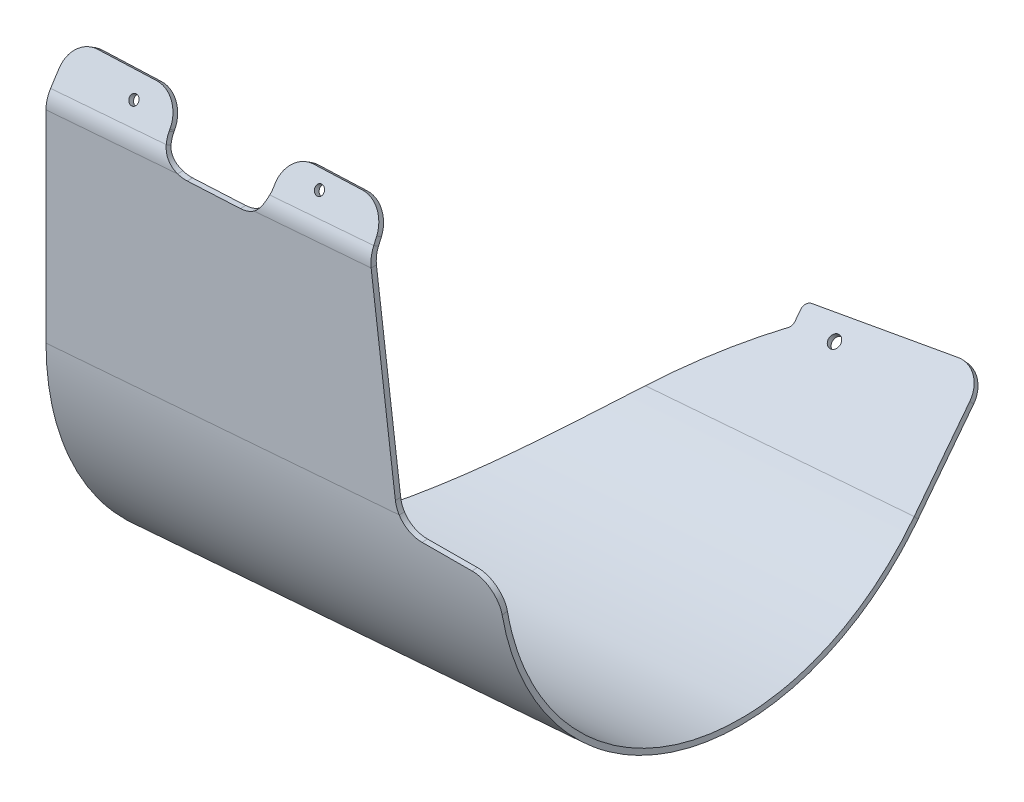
ISO-10303-21;
HEADER;
FILE_DESCRIPTION(('STEP AP214'),'2;1');
FILE_NAME('part.step','',(''),(''),'','','');
FILE_SCHEMA(('AUTOMOTIVE_DESIGN { 1 0 10303 214 1 1 1 1 }'));
ENDSEC;
DATA;
#1=APPLICATION_CONTEXT('core data for automotive mechanical design processes');
#2=APPLICATION_PROTOCOL_DEFINITION('international standard','automotive_design',2000,#1);
#3=PRODUCT_CONTEXT('',#1,'mechanical');
#4=PRODUCT('Part','Part','',(#3));
#5=PRODUCT_RELATED_PRODUCT_CATEGORY('part','',(#4));
#6=PRODUCT_DEFINITION_FORMATION('','',#4);
#7=PRODUCT_DEFINITION_CONTEXT('part definition',#1,'design');
#8=PRODUCT_DEFINITION('design','',#6,#7);
#9=PRODUCT_DEFINITION_SHAPE('','',#8);
#10=(LENGTH_UNIT() NAMED_UNIT(*) SI_UNIT(.MILLI.,.METRE.));
#11=(NAMED_UNIT(*) PLANE_ANGLE_UNIT() SI_UNIT($,.RADIAN.));
#12=(NAMED_UNIT(*) SI_UNIT($,.STERADIAN.) SOLID_ANGLE_UNIT());
#13=UNCERTAINTY_MEASURE_WITH_UNIT(LENGTH_MEASURE(1.E-05),#10,'distance_accuracy_value','');
#14=(GEOMETRIC_REPRESENTATION_CONTEXT(3) GLOBAL_UNCERTAINTY_ASSIGNED_CONTEXT((#13)) GLOBAL_UNIT_ASSIGNED_CONTEXT((#10,
#11,#12)) REPRESENTATION_CONTEXT('',''));
#15=CARTESIAN_POINT('',(0.,0.,0.));
#16=DIRECTION('',(0.,0.,1.));
#17=DIRECTION('',(1.,0.,0.));
#18=AXIS2_PLACEMENT_3D('',#15,#16,#17);
#19=CARTESIAN_POINT('',(37.5963039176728,-18.6407753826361,-400.891243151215));
#20=DIRECTION('',(0.130544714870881,-0.658857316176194,0.740854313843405));
#21=DIRECTION('',(-0.989726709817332,-0.130544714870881,0.0583019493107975));
#22=AXIS2_PLACEMENT_3D('',#19,#20,#21);
#23=PLANE('',#22);
#24=DIRECTION('',(0.989726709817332,0.130544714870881,-0.0583019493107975));
#25=VECTOR('',#24,1.);
#26=CARTESIAN_POINT('',(37.3630961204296,-15.6773581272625,-398.21472072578));
#27=LINE('',#26,#25);
#28=CARTESIAN_POINT('',(-66.5582084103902,-29.384553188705,-392.093016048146));
#29=VERTEX_POINT('',#28);
#30=CARTESIAN_POINT('',(37.3630961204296,-15.6773581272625,-398.21472072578));
#31=VERTEX_POINT('',#30);
#32=EDGE_CURVE('E89',#29,#31,#27,.T.);
#33=ORIENTED_EDGE('',*,*,#32,.T.);
#34=DIRECTION('',(-0.0583019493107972,0.740854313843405,0.669130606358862));
#35=VECTOR('',#34,1.);
#36=CARTESIAN_POINT('',(37.5963039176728,-18.6407753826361,-400.891243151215));
#37=LINE('',#36,#35);
#38=CARTESIAN_POINT('',(37.5963039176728,-18.6407753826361,-400.891243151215));
#39=VERTEX_POINT('',#38);
#40=EDGE_CURVE('E1248',#39,#31,#37,.T.);
#41=ORIENTED_EDGE('',*,*,#40,.F.);
#42=DIRECTION('',(0.989726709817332,0.130544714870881,-0.0583019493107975));
#43=VECTOR('',#42,1.);
#44=CARTESIAN_POINT('',(37.5963039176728,-18.6407753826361,-400.891243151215));
#45=LINE('',#44,#43);
#46=CARTESIAN_POINT('',(-66.325000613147,-32.3479704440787,-394.769538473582));
#47=VERTEX_POINT('',#46);
#48=EDGE_CURVE('E1240',#47,#39,#45,.T.);
#49=ORIENTED_EDGE('',*,*,#48,.F.);
#50=DIRECTION('',(-0.0583019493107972,0.740854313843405,0.669130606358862));
#51=VECTOR('',#50,1.);
#52=CARTESIAN_POINT('',(-66.325000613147,-32.3479704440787,-394.769538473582));
#53=LINE('',#52,#51);
#54=EDGE_CURVE('E1007',#47,#29,#53,.T.);
#55=ORIENTED_EDGE('',*,*,#54,.T.);
#56=EDGE_LOOP('',(#33,#41,#49,#55));
#57=FACE_BOUND('',#56,.T.);
#58=ADVANCED_FACE('F30',(#57),#23,.F.);
#59=CARTESIAN_POINT('',(-65.6722770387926,-35.6422570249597,-391.065266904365));
#60=DIRECTION('',(-0.0583019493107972,0.740854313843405,0.669130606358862));
#61=DIRECTION('',(-0.989726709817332,-0.130544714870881,0.0583019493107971));
#62=AXIS2_PLACEMENT_3D('',#59,#60,#61);
#63=CYLINDRICAL_SURFACE('',#62,5.00000000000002);
#64=CARTESIAN_POINT('',(-65.9054848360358,-32.6788397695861,-388.388744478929));
#65=DIRECTION('',(0.0583019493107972,-0.740854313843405,-0.669130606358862));
#66=DIRECTION('',(-0.989726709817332,-0.130544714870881,0.0583019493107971));
#67=AXIS2_PLACEMENT_3D('',#64,#65,#66);
#68=CIRCLE('',#67,5.00000000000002);
#69=CARTESIAN_POINT('',(-70.8541183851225,-33.3315633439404,-388.097234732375));
#70=VERTEX_POINT('',#69);
#71=EDGE_CURVE('E1005',#70,#29,#68,.T.);
#72=ORIENTED_EDGE('',*,*,#71,.T.);
#73=ORIENTED_EDGE('',*,*,#54,.F.);
#74=CARTESIAN_POINT('',(-65.6722770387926,-35.6422570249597,-391.065266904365));
#75=DIRECTION('',(0.0583019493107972,-0.740854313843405,-0.669130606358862));
#76=DIRECTION('',(-0.989726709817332,-0.130544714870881,0.0583019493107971));
#77=AXIS2_PLACEMENT_3D('',#74,#75,#76);
#78=CIRCLE('',#77,5.00000000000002);
#79=CARTESIAN_POINT('',(-70.6209105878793,-36.2949805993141,-390.773757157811));
#80=VERTEX_POINT('',#79);
#81=EDGE_CURVE('E1242',#80,#47,#78,.T.);
#82=ORIENTED_EDGE('',*,*,#81,.F.);
#83=DIRECTION('',(-0.0583019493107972,0.740854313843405,0.669130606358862));
#84=VECTOR('',#83,1.);
#85=CARTESIAN_POINT('',(-70.6209105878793,-36.2949805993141,-390.773757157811));
#86=LINE('',#85,#84);
#87=EDGE_CURVE('E1002',#80,#70,#86,.T.);
#88=ORIENTED_EDGE('',*,*,#87,.T.);
#89=EDGE_LOOP('',(#72,#73,#82,#88));
#90=FACE_BOUND('',#89,.T.);
#91=ADVANCED_FACE('F918',(#90),#63,.T.);
#92=CARTESIAN_POINT('',(-70.6209105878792,-36.2949805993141,-390.773757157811));
#93=DIRECTION('',(0.989726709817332,0.130544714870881,-0.0583019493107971));
#94=DIRECTION('',(-0.0583019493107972,0.740854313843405,0.669130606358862));
#95=AXIS2_PLACEMENT_3D('',#92,#93,#94);
#96=PLANE('',#95);
#97=DIRECTION('',(-0.130544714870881,0.658857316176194,-0.740854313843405));
#98=VECTOR('',#97,1.);
#99=CARTESIAN_POINT('',(-70.8541183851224,-33.3315633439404,-388.097234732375));
#100=LINE('',#99,#98);
#101=CARTESIAN_POINT('',(-69.9034501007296,-38.1295726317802,-382.70209713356));
#102=VERTEX_POINT('',#101);
#103=EDGE_CURVE('E985',#102,#70,#100,.T.);
#104=ORIENTED_EDGE('',*,*,#103,.T.);
#105=ORIENTED_EDGE('',*,*,#87,.F.);
#106=DIRECTION('',(-0.130544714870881,0.658857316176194,-0.740854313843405));
#107=VECTOR('',#106,1.);
#108=CARTESIAN_POINT('',(-70.6209105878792,-36.2949805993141,-390.773757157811));
#109=LINE('',#108,#107);
#110=CARTESIAN_POINT('',(-69.6702423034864,-41.0929898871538,-385.378619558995));
#111=VERTEX_POINT('',#110);
#112=EDGE_CURVE('E1244',#111,#80,#109,.T.);
#113=ORIENTED_EDGE('',*,*,#112,.F.);
#114=DIRECTION('',(-0.0583019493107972,0.740854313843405,0.669130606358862));
#115=VECTOR('',#114,1.);
#116=CARTESIAN_POINT('',(-69.6702423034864,-41.0929898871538,-385.378619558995));
#117=LINE('',#116,#115);
#118=EDGE_CURVE('E989',#111,#102,#117,.T.);
#119=ORIENTED_EDGE('',*,*,#118,.T.);
#120=EDGE_LOOP('',(#104,#105,#113,#119));
#121=FACE_BOUND('',#120,.T.);
#122=ADVANCED_FACE('F921',(#121),#96,.F.);
#123=CARTESIAN_POINT('',(-74.6188758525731,-41.7457134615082,-385.087109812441));
#124=DIRECTION('',(-0.0583019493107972,0.740854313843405,0.669130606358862));
#125=DIRECTION('',(-0.989726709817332,-0.130544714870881,0.0583019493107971));
#126=AXIS2_PLACEMENT_3D('',#123,#124,#125);
#127=CYLINDRICAL_SURFACE('',#126,4.99999999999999);
#128=CARTESIAN_POINT('',(-74.8520836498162,-38.7822962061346,-382.410587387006));
#129=DIRECTION('',(-0.0583019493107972,0.740854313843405,0.669130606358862));
#130=DIRECTION('',(0.989726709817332,0.130544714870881,-0.0583019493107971));
#131=AXIS2_PLACEMENT_3D('',#128,#129,#130);
#132=CIRCLE('',#131,4.99999999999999);
#133=CARTESIAN_POINT('',(-71.6016835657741,-41.1848203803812,-379.467327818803));
#134=VERTEX_POINT('',#133);
#135=EDGE_CURVE('E982',#134,#102,#132,.T.);
#136=ORIENTED_EDGE('',*,*,#135,.T.);
#137=ORIENTED_EDGE('',*,*,#118,.F.);
#138=CARTESIAN_POINT('',(-74.6188758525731,-41.7457134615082,-385.087109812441));
#139=DIRECTION('',(-0.0583019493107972,0.740854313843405,0.669130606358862));
#140=DIRECTION('',(0.989726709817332,0.130544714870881,-0.0583019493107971));
#141=AXIS2_PLACEMENT_3D('',#138,#139,#140);
#142=CIRCLE('',#141,4.99999999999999);
#143=CARTESIAN_POINT('',(-71.3684757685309,-44.1482376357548,-382.143850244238));
#144=VERTEX_POINT('',#143);
#145=EDGE_CURVE('E992',#144,#111,#142,.T.);
#146=ORIENTED_EDGE('',*,*,#145,.F.);
#147=DIRECTION('',(-0.0583019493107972,0.740854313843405,0.669130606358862));
#148=VECTOR('',#147,1.);
#149=CARTESIAN_POINT('',(-71.3684757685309,-44.1482376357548,-382.143850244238));
#150=LINE('',#149,#148);
#151=EDGE_CURVE('E988',#144,#134,#150,.T.);
#152=ORIENTED_EDGE('',*,*,#151,.T.);
#153=EDGE_LOOP('',(#136,#137,#146,#152));
#154=FACE_BOUND('',#153,.T.);
#155=ADVANCED_FACE('F925',(#154),#127,.F.);
#156=CARTESIAN_POINT('',(-39.6236621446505,-38.9672123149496,-385.1142724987));
#157=DIRECTION('',(-0.0583019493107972,0.740854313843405,0.669130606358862));
#158=DIRECTION('',(-0.989726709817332,-0.130544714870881,0.0583019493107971));
#159=AXIS2_PLACEMENT_3D('',#156,#157,#158);
#160=CYLINDRICAL_SURFACE('',#159,4.50000000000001);
#161=CARTESIAN_POINT('',(-39.6236621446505,-38.9672123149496,-385.1142724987));
#162=DIRECTION('',(0.0583019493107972,-0.740854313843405,-0.669130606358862));
#163=DIRECTION('',(0.989726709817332,0.130544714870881,-0.0583019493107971));
#164=AXIS2_PLACEMENT_3D('',#161,#162,#163);
#165=CIRCLE('',#164,4.50000000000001);
#166=CARTESIAN_POINT('',(-35.1698919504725,-38.3797610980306,-385.376631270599));
#167=VERTEX_POINT('',#166);
#168=EDGE_CURVE('E993',#167,#167,#165,.T.);
#169=ORIENTED_EDGE('',*,*,#168,.T.);
#170=EDGE_LOOP('',(#169));
#171=FACE_BOUND('',#170,.T.);
#172=CARTESIAN_POINT('',(-39.8568699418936,-36.003795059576,-382.437750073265));
#173=DIRECTION('',(0.0583019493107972,-0.740854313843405,-0.669130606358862));
#174=DIRECTION('',(0.989726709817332,0.130544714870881,-0.0583019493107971));
#175=AXIS2_PLACEMENT_3D('',#172,#173,#174);
#176=CIRCLE('',#175,4.50000000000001);
#177=CARTESIAN_POINT('',(-35.4030997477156,-35.416343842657,-382.700108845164));
#178=VERTEX_POINT('',#177);
#179=EDGE_CURVE('E11',#178,#178,#176,.T.);
#180=ORIENTED_EDGE('',*,*,#179,.F.);
#181=EDGE_LOOP('',(#180));
#182=FACE_BOUND('',#181,.T.);
#183=ADVANCED_FACE('F929',(#171,#182),#160,.F.);
#184=CARTESIAN_POINT('',(40.2071982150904,-31.81792170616,-386.074156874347));
#185=DIRECTION('',(-0.0583019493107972,0.740854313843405,0.669130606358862));
#186=DIRECTION('',(-0.989726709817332,-0.130544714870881,0.0583019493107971));
#187=AXIS2_PLACEMENT_3D('',#184,#185,#186);
#188=CYLINDRICAL_SURFACE('',#187,20.);
#189=CARTESIAN_POINT('',(39.9739904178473,-28.8545044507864,-383.397634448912));
#190=DIRECTION('',(0.0583019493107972,-0.740854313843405,-0.669130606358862));
#191=DIRECTION('',(0.989726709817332,0.130544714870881,-0.0583019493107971));
#192=AXIS2_PLACEMENT_3D('',#189,#190,#191);
#193=CIRCLE('',#192,20.);
#194=CARTESIAN_POINT('',(59.7685246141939,-26.2436101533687,-384.563673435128));
#195=VERTEX_POINT('',#194);
#196=EDGE_CURVE('E996',#31,#195,#193,.T.);
#197=ORIENTED_EDGE('',*,*,#196,.T.);
#198=DIRECTION('',(-0.0583019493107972,0.740854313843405,0.669130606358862));
#199=VECTOR('',#198,1.);
#200=CARTESIAN_POINT('',(60.0017324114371,-29.2070274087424,-387.240195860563));
#201=LINE('',#200,#199);
#202=CARTESIAN_POINT('',(60.0017324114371,-29.2070274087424,-387.240195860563));
#203=VERTEX_POINT('',#202);
#204=EDGE_CURVE('E966',#203,#195,#201,.T.);
#205=ORIENTED_EDGE('',*,*,#204,.F.);
#206=CARTESIAN_POINT('',(40.2071982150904,-31.81792170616,-386.074156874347));
#207=DIRECTION('',(0.0583019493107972,-0.740854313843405,-0.669130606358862));
#208=DIRECTION('',(0.989726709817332,0.130544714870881,-0.0583019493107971));
#209=AXIS2_PLACEMENT_3D('',#206,#207,#208);
#210=CIRCLE('',#209,20.);
#211=EDGE_CURVE('E970',#39,#203,#210,.T.);
#212=ORIENTED_EDGE('',*,*,#211,.F.);
#213=ORIENTED_EDGE('',*,*,#40,.T.);
#214=EDGE_LOOP('',(#197,#205,#212,#213));
#215=FACE_BOUND('',#214,.T.);
#216=ADVANCED_FACE('F933',(#215),#188,.T.);
#217=CARTESIAN_POINT('',(125.274089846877,-358.635685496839,-16.8130389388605));
#218=DIRECTION('',(-0.989726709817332,-0.130544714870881,0.0583019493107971));
#219=DIRECTION('',(-0.130544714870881,0.658857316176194,-0.740854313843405));
#220=AXIS2_PLACEMENT_3D('',#217,#218,#219);
#221=PLANE('',#220);
#222=CARTESIAN_POINT('',(68.9421126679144,-74.3289991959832,-336.502643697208));
#223=CARTESIAN_POINT('',(68.7089048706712,-71.3655819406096,-333.826121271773));
#224=B_SPLINE_CURVE_WITH_KNOTS('',1,(#222,#223),.UNSPECIFIED.,.F.,.F.,(2,2),(0.,1.),.UNSPECIFIED.);
#225=CARTESIAN_POINT('',(68.9421126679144,-74.3289991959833,-336.502643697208));
#226=VERTEX_POINT('',#225);
#227=CARTESIAN_POINT('',(68.7089048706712,-71.3655819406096,-333.826121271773));
#228=VERTEX_POINT('',#227);
#229=EDGE_CURVE('E959',#226,#228,#224,.T.);
#230=ORIENTED_EDGE('',*,*,#229,.F.);
#231=DIRECTION('',(0.130544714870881,-0.658857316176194,0.740854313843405));
#232=VECTOR('',#231,1.);
#233=CARTESIAN_POINT('',(125.274089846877,-358.635685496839,-16.8130389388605));
#234=LINE('',#233,#232);
#235=EDGE_CURVE('E965',#203,#226,#234,.T.);
#236=ORIENTED_EDGE('',*,*,#235,.F.);
#237=ORIENTED_EDGE('',*,*,#204,.T.);
#238=DIRECTION('',(0.130544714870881,-0.658857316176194,0.740854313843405));
#239=VECTOR('',#238,1.);
#240=CARTESIAN_POINT('',(125.040882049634,-355.672268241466,-14.1365165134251));
#241=LINE('',#240,#239);
#242=EDGE_CURVE('E962',#195,#228,#241,.T.);
#243=ORIENTED_EDGE('',*,*,#242,.T.);
#244=EDGE_LOOP('',(#230,#236,#237,#243));
#245=FACE_BOUND('',#244,.T.);
#246=ADVANCED_FACE('F937',(#245),#221,.F.);
#247=CARTESIAN_POINT('',(226.313998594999,-264.179409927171,-112.590328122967));
#248=DIRECTION('',(0.0583019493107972,-0.740854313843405,-0.669130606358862));
#249=DIRECTION('',(0.989726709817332,0.130544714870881,-0.0583019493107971));
#250=AXIS2_PLACEMENT_3D('',#247,#248,#249);
#251=PLANE('',#250);
#252=ORIENTED_EDGE('',*,*,#168,.F.);
#253=EDGE_LOOP('',(#252));
#254=FACE_BOUND('',#253,.T.);
#255=ORIENTED_EDGE('',*,*,#235,.T.);
#256=DIRECTION('',(-0.996917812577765,-0.0784530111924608,0.));
#257=VECTOR('',#256,1.);
#258=CARTESIAN_POINT('',(210.496965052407,-63.1892600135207,-336.502643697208));
#259=LINE('',#258,#257);
#260=CARTESIAN_POINT('',(-133.264423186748,-90.2417569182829,-336.502643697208));
#261=VERTEX_POINT('',#260);
#262=EDGE_CURVE('E1010',#226,#261,#259,.T.);
#263=ORIENTED_EDGE('',*,*,#262,.T.);
#264=CARTESIAN_POINT('',(226.313998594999,-264.179409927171,-112.590328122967));
#265=DIRECTION('',(0.0583019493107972,-0.740854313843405,-0.669130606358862));
#266=DIRECTION('',(0.989726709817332,0.130544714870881,-0.0583019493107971));
#267=AXIS2_PLACEMENT_3D('',#264,#265,#266);
#268=CIRCLE('',#267,457.916666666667);
#269=EDGE_CURVE('E974',#261,#144,#268,.T.);
#270=ORIENTED_EDGE('',*,*,#269,.T.);
#271=ORIENTED_EDGE('',*,*,#145,.T.);
#272=ORIENTED_EDGE('',*,*,#112,.T.);
#273=ORIENTED_EDGE('',*,*,#81,.T.);
#274=ORIENTED_EDGE('',*,*,#48,.T.);
#275=ORIENTED_EDGE('',*,*,#211,.T.);
#276=EDGE_LOOP('',(#255,#263,#270,#271,#272,#273,#274,#275));
#277=FACE_BOUND('',#276,.T.);
#278=ADVANCED_FACE('F942',(#254,#277),#251,.T.);
#279=CARTESIAN_POINT('',(226.313998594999,-264.179409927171,-112.590328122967));
#280=DIRECTION('',(-0.0583019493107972,0.740854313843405,0.669130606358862));
#281=DIRECTION('',(-0.989726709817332,-0.130544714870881,0.0583019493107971));
#282=AXIS2_PLACEMENT_3D('',#279,#280,#281);
#283=CYLINDRICAL_SURFACE('',#282,457.916666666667);
#284=CARTESIAN_POINT('',(-133.497630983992,-87.2783396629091,-333.826121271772));
#285=CARTESIAN_POINT('',(-133.264423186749,-90.2417569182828,-336.502643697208));
#286=B_SPLINE_CURVE_WITH_KNOTS('',1,(#284,#285),.UNSPECIFIED.,.F.,.F.,(2,2),(0.,1.),.UNSPECIFIED.);
#287=CARTESIAN_POINT('',(-133.497630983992,-87.2783396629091,-333.826121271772));
#288=VERTEX_POINT('',#287);
#289=EDGE_CURVE('E958',#288,#261,#286,.T.);
#290=ORIENTED_EDGE('',*,*,#289,.F.);
#291=CARTESIAN_POINT('',(226.080790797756,-261.215992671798,-109.913805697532));
#292=DIRECTION('',(0.0583019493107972,-0.740854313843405,-0.669130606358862));
#293=DIRECTION('',(0.989726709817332,0.130544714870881,-0.0583019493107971));
#294=AXIS2_PLACEMENT_3D('',#291,#292,#293);
#295=CIRCLE('',#294,457.916666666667);
#296=EDGE_CURVE('E41',#288,#134,#295,.T.);
#297=ORIENTED_EDGE('',*,*,#296,.T.);
#298=ORIENTED_EDGE('',*,*,#151,.F.);
#299=ORIENTED_EDGE('',*,*,#269,.F.);
#300=EDGE_LOOP('',(#290,#297,#298,#299));
#301=FACE_BOUND('',#300,.T.);
#302=ADVANCED_FACE('F973',(#301),#283,.T.);
#303=CARTESIAN_POINT('',(226.080790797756,-261.215992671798,-109.913805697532));
#304=DIRECTION('',(0.0583019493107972,-0.740854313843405,-0.669130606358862));
#305=DIRECTION('',(0.989726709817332,0.130544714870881,-0.0583019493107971));
#306=AXIS2_PLACEMENT_3D('',#303,#304,#305);
#307=PLANE('',#306);
#308=DIRECTION('',(-0.996917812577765,-0.0784530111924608,0.));
#309=VECTOR('',#308,1.);
#310=CARTESIAN_POINT('',(210.263757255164,-60.225842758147,-333.826121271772));
#311=LINE('',#310,#309);
#312=EDGE_CURVE('E951',#228,#288,#311,.T.);
#313=ORIENTED_EDGE('',*,*,#312,.F.);
#314=ORIENTED_EDGE('',*,*,#242,.F.);
#315=ORIENTED_EDGE('',*,*,#196,.F.);
#316=ORIENTED_EDGE('',*,*,#32,.F.);
#317=ORIENTED_EDGE('',*,*,#71,.F.);
#318=ORIENTED_EDGE('',*,*,#103,.F.);
#319=ORIENTED_EDGE('',*,*,#135,.F.);
#320=ORIENTED_EDGE('',*,*,#296,.F.);
#321=EDGE_LOOP('',(#313,#314,#315,#316,#317,#318,#319,#320));
#322=FACE_BOUND('',#321,.T.);
#323=ORIENTED_EDGE('',*,*,#179,.T.);
#324=EDGE_LOOP('',(#323));
#325=FACE_BOUND('',#324,.T.);
#326=ADVANCED_FACE('F32',(#322,#325),#307,.F.);
#327=CARTESIAN_POINT('',(-181.895189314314,246.680532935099,-14.7798085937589));
#328=DIRECTION('',(0.0380213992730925,-0.847330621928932,0.529702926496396));
#329=DIRECTION('',(0.998411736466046,0.0542657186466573,0.0151405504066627));
#330=AXIS2_PLACEMENT_3D('',#327,#328,#329);
#331=PLANE('',#330);
#332=DIRECTION('',(-0.998411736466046,-0.0542657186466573,-0.0151405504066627));
#333=VECTOR('',#332,1.);
#334=CARTESIAN_POINT('',(-181.728894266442,244.56738912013,-18.1720009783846));
#335=LINE('',#334,#333);
#336=CARTESIAN_POINT('',(-181.728894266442,244.56738912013,-18.1720009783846));
#337=VERTEX_POINT('',#336);
#338=CARTESIAN_POINT('',(-226.950678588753,242.109492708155,-18.8577728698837));
#339=VERTEX_POINT('',#338);
#340=EDGE_CURVE('E141',#337,#339,#335,.T.);
#341=ORIENTED_EDGE('',*,*,#340,.T.);
#342=DIRECTION('',(0.0415737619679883,-0.528285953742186,-0.848048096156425));
#343=VECTOR('',#342,1.);
#344=CARTESIAN_POINT('',(-227.116973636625,244.222636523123,-15.465580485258));
#345=LINE('',#344,#343);
#346=CARTESIAN_POINT('',(-227.116973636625,244.222636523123,-15.465580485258));
#347=VERTEX_POINT('',#346);
#348=EDGE_CURVE('E1843',#347,#339,#345,.T.);
#349=ORIENTED_EDGE('',*,*,#348,.F.);
#350=DIRECTION('',(-0.998411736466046,-0.0542657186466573,-0.0151405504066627));
#351=VECTOR('',#350,1.);
#352=CARTESIAN_POINT('',(-181.895189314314,246.680532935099,-14.7798085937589));
#353=LINE('',#352,#351);
#354=CARTESIAN_POINT('',(-181.895189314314,246.680532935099,-14.7798085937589));
#355=VERTEX_POINT('',#354);
#356=EDGE_CURVE('E1849',#355,#347,#353,.T.);
#357=ORIENTED_EDGE('',*,*,#356,.F.);
#358=DIRECTION('',(0.0415737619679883,-0.528285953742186,-0.848048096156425));
#359=VECTOR('',#358,1.);
#360=CARTESIAN_POINT('',(-181.895189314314,246.680532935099,-14.7798085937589));
#361=LINE('',#360,#359);
#362=EDGE_CURVE('E1829',#355,#337,#361,.T.);
#363=ORIENTED_EDGE('',*,*,#362,.T.);
#364=EDGE_LOOP('',(#341,#349,#357,#363));
#365=FACE_BOUND('',#364,.T.);
#366=ADVANCED_FACE('F836',(#365),#331,.F.);
#367=CARTESIAN_POINT('',(-181.134761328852,229.733920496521,-4.18575006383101));
#368=DIRECTION('',(0.0415737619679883,-0.528285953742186,-0.848048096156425));
#369=DIRECTION('',(-0.999064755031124,-0.0118843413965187,-0.0415737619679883));
#370=AXIS2_PLACEMENT_3D('',#367,#368,#369);
#371=CYLINDRICAL_SURFACE('',#370,20.);
#372=CARTESIAN_POINT('',(-180.968466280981,227.620776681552,-7.57794244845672));
#373=DIRECTION('',(-0.0415737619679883,0.528285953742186,0.848048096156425));
#374=DIRECTION('',(0.999064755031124,0.0118843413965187,0.0415737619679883));
#375=AXIS2_PLACEMENT_3D('',#372,#373,#374);
#376=CIRCLE('',#375,20.);
#377=CARTESIAN_POINT('',(-161.00023155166,228.706091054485,-7.27513144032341));
#378=VERTEX_POINT('',#377);
#379=EDGE_CURVE('E1831',#378,#337,#376,.T.);
#380=ORIENTED_EDGE('',*,*,#379,.T.);
#381=ORIENTED_EDGE('',*,*,#362,.F.);
#382=CARTESIAN_POINT('',(-181.134761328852,229.733920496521,-4.18575006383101));
#383=DIRECTION('',(-0.0415737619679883,0.528285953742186,0.848048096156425));
#384=DIRECTION('',(0.999064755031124,0.0118843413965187,0.0415737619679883));
#385=AXIS2_PLACEMENT_3D('',#382,#383,#384);
#386=CIRCLE('',#385,20.);
#387=CARTESIAN_POINT('',(-161.166526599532,230.819234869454,-3.8829390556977));
#388=VERTEX_POINT('',#387);
#389=EDGE_CURVE('E1847',#388,#355,#386,.T.);
#390=ORIENTED_EDGE('',*,*,#389,.F.);
#391=DIRECTION('',(0.0415737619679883,-0.528285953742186,-0.848048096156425));
#392=VECTOR('',#391,1.);
#393=CARTESIAN_POINT('',(-161.166526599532,230.819234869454,-3.8829390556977));
#394=LINE('',#393,#392);
#395=EDGE_CURVE('E1833',#388,#378,#394,.T.);
#396=ORIENTED_EDGE('',*,*,#395,.T.);
#397=EDGE_LOOP('',(#380,#381,#390,#396));
#398=FACE_BOUND('',#397,.T.);
#399=ADVANCED_FACE('F839',(#398),#371,.T.);
#400=CARTESIAN_POINT('',(-161.166526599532,230.819234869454,-3.8829390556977));
#401=DIRECTION('',(-0.998411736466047,-0.0542657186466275,-0.0151405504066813));
#402=DIRECTION('',(0.0380213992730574,-0.847330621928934,0.529702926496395));
#403=AXIS2_PLACEMENT_3D('',#400,#401,#402);
#404=PLANE('',#403);
#405=DIRECTION('',(-0.0380213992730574,0.847330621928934,-0.529702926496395));
#406=VECTOR('',#405,1.);
#407=CARTESIAN_POINT('',(-161.00023155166,228.706091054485,-7.27513144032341));
#408=LINE('',#407,#406);
#409=CARTESIAN_POINT('',(-160.962210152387,227.858760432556,-6.74542851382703));
#410=VERTEX_POINT('',#409);
#411=EDGE_CURVE('E1836',#410,#378,#408,.T.);
#412=ORIENTED_EDGE('',*,*,#411,.T.);
#413=ORIENTED_EDGE('',*,*,#395,.F.);
#414=DIRECTION('',(-0.0380213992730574,0.847330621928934,-0.529702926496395));
#415=VECTOR('',#414,1.);
#416=CARTESIAN_POINT('',(-161.166526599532,230.819234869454,-3.8829390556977));
#417=LINE('',#416,#415);
#418=CARTESIAN_POINT('',(-161.128505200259,229.971904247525,-3.35323612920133));
#419=VERTEX_POINT('',#418);
#420=EDGE_CURVE('E1825',#419,#388,#417,.T.);
#421=ORIENTED_EDGE('',*,*,#420,.F.);
#422=DIRECTION('',(0.0415737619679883,-0.528285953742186,-0.848048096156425));
#423=VECTOR('',#422,1.);
#424=CARTESIAN_POINT('',(-161.128505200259,229.971904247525,-3.35323612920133));
#425=LINE('',#424,#423);
#426=EDGE_CURVE('E1838',#419,#410,#425,.T.);
#427=ORIENTED_EDGE('',*,*,#426,.T.);
#428=EDGE_LOOP('',(#412,#413,#421,#427));
#429=FACE_BOUND('',#428,.T.);
#430=ADVANCED_FACE('F842',(#429),#404,.F.);
#431=CARTESIAN_POINT('',(-191.308985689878,233.427916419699,-6.9856702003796));
#432=DIRECTION('',(0.0415737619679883,-0.528285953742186,-0.848048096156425));
#433=DIRECTION('',(-0.999064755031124,-0.0118843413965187,-0.0415737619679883));
#434=AXIS2_PLACEMENT_3D('',#431,#432,#433);
#435=CYLINDRICAL_SURFACE('',#434,3.50000000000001);
#436=CARTESIAN_POINT('',(-191.308985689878,233.427916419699,-6.9856702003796));
#437=DIRECTION('',(-0.0415737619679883,0.528285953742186,0.848048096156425));
#438=DIRECTION('',(0.999064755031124,0.0118843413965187,0.0415737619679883));
#439=AXIS2_PLACEMENT_3D('',#436,#437,#438);
#440=CIRCLE('',#439,3.50000000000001);
#441=CARTESIAN_POINT('',(-187.812259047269,233.469511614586,-6.84016203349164));
#442=VERTEX_POINT('',#441);
#443=EDGE_CURVE('E1809',#442,#442,#440,.T.);
#444=ORIENTED_EDGE('',*,*,#443,.T.);
#445=EDGE_LOOP('',(#444));
#446=FACE_BOUND('',#445,.T.);
#447=CARTESIAN_POINT('',(-191.142690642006,231.31477260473,-10.3778625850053));
#448=DIRECTION('',(-0.0415737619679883,0.528285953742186,0.848048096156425));
#449=DIRECTION('',(0.999064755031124,0.0118843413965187,0.0415737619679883));
#450=AXIS2_PLACEMENT_3D('',#447,#448,#449);
#451=CIRCLE('',#450,3.50000000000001);
#452=CARTESIAN_POINT('',(-187.645963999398,231.356367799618,-10.2323544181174));
#453=VERTEX_POINT('',#452);
#454=EDGE_CURVE('E820',#453,#453,#451,.T.);
#455=ORIENTED_EDGE('',*,*,#454,.F.);
#456=EDGE_LOOP('',(#455));
#457=FACE_BOUND('',#456,.T.);
#458=ADVANCED_FACE('F846',(#446,#457),#435,.F.);
#459=CARTESIAN_POINT('',(-226.356545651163,227.276024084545,-4.87152195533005));
#460=DIRECTION('',(0.0415737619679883,-0.528285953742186,-0.848048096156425));
#461=DIRECTION('',(-0.999064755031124,-0.0118843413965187,-0.0415737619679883));
#462=AXIS2_PLACEMENT_3D('',#459,#460,#461);
#463=CYLINDRICAL_SURFACE('',#462,20.);
#464=CARTESIAN_POINT('',(-226.190250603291,225.162880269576,-8.26371433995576));
#465=DIRECTION('',(-0.0415737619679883,0.528285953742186,0.848048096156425));
#466=DIRECTION('',(0.999064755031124,0.0118843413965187,0.0415737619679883));
#467=AXIS2_PLACEMENT_3D('',#464,#465,#466);
#468=CIRCLE('',#467,20.);
#469=CARTESIAN_POINT('',(-246.171545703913,224.925193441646,-9.09518957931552));
#470=VERTEX_POINT('',#469);
#471=EDGE_CURVE('E1841',#339,#470,#468,.T.);
#472=ORIENTED_EDGE('',*,*,#471,.T.);
#473=DIRECTION('',(0.0415737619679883,-0.528285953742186,-0.848048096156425));
#474=VECTOR('',#473,1.);
#475=CARTESIAN_POINT('',(-246.337840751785,227.038337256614,-5.70299719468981));
#476=LINE('',#475,#474);
#477=CARTESIAN_POINT('',(-246.337840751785,227.038337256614,-5.70299719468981));
#478=VERTEX_POINT('',#477);
#479=EDGE_CURVE('E884',#478,#470,#476,.T.);
#480=ORIENTED_EDGE('',*,*,#479,.F.);
#481=CARTESIAN_POINT('',(-226.356545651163,227.276024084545,-4.87152195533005));
#482=DIRECTION('',(-0.0415737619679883,0.528285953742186,0.848048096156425));
#483=DIRECTION('',(0.999064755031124,0.0118843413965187,0.0415737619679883));
#484=AXIS2_PLACEMENT_3D('',#481,#482,#483);
#485=CIRCLE('',#484,20.);
#486=EDGE_CURVE('E888',#347,#478,#485,.T.);
#487=ORIENTED_EDGE('',*,*,#486,.F.);
#488=ORIENTED_EDGE('',*,*,#348,.T.);
#489=EDGE_LOOP('',(#472,#480,#487,#488));
#490=FACE_BOUND('',#489,.T.);
#491=ADVANCED_FACE('F850',(#490),#463,.T.);
#492=CARTESIAN_POINT('',(-246.337840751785,227.038337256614,-5.70299719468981));
#493=DIRECTION('',(0.999064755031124,0.0118843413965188,0.0415737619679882));
#494=DIRECTION('',(0.0118843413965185,0.848983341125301,-0.528285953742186));
#495=AXIS2_PLACEMENT_3D('',#492,#493,#494);
#496=PLANE('',#495);
#497=CARTESIAN_POINT('',(-246.47749848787,217.061588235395,0.505106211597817));
#498=CARTESIAN_POINT('',(-246.311203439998,214.948444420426,-2.88708617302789));
#499=B_SPLINE_CURVE_WITH_KNOTS('',1,(#497,#498),.UNSPECIFIED.,.F.,.F.,(2,2),(0.,1.),.UNSPECIFIED.);
#500=CARTESIAN_POINT('',(-246.477498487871,217.061588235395,0.505106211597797));
#501=VERTEX_POINT('',#500);
#502=CARTESIAN_POINT('',(-246.311203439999,214.948444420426,-2.88708617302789));
#503=VERTEX_POINT('',#502);
#504=EDGE_CURVE('E877',#501,#503,#499,.T.);
#505=ORIENTED_EDGE('',*,*,#504,.F.);
#506=DIRECTION('',(-0.0118843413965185,-0.848983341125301,0.528285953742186));
#507=VECTOR('',#506,1.);
#508=CARTESIAN_POINT('',(-246.337840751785,227.038337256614,-5.70299719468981));
#509=LINE('',#508,#507);
#510=EDGE_CURVE('E883',#478,#501,#509,.T.);
#511=ORIENTED_EDGE('',*,*,#510,.F.);
#512=ORIENTED_EDGE('',*,*,#479,.T.);
#513=DIRECTION('',(-0.0118843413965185,-0.848983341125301,0.528285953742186));
#514=VECTOR('',#513,1.);
#515=CARTESIAN_POINT('',(-246.171545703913,224.925193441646,-9.09518957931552));
#516=LINE('',#515,#514);
#517=EDGE_CURVE('E880',#470,#503,#516,.T.);
#518=ORIENTED_EDGE('',*,*,#517,.T.);
#519=EDGE_LOOP('',(#505,#511,#512,#518));
#520=FACE_BOUND('',#519,.T.);
#521=ADVANCED_FACE('F854',(#520),#496,.F.);
#522=CARTESIAN_POINT('',(207.538018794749,-25.5893491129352,173.920052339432));
#523=DIRECTION('',(-0.0415737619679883,0.528285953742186,0.848048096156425));
#524=DIRECTION('',(0.999064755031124,0.0118843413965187,0.0415737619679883));
#525=AXIS2_PLACEMENT_3D('',#522,#523,#524);
#526=PLANE('',#525);
#527=ORIENTED_EDGE('',*,*,#443,.F.);
#528=EDGE_LOOP('',(#527));
#529=FACE_BOUND('',#528,.T.);
#530=ORIENTED_EDGE('',*,*,#510,.T.);
#531=DIRECTION('',(0.996917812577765,0.0784530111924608,0.));
#532=VECTOR('',#531,1.);
#533=CARTESIAN_POINT('',(185.765588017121,251.077202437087,0.505106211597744));
#534=LINE('',#533,#532);
#535=CARTESIAN_POINT('',(-159.496755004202,223.906587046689,0.505106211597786));
#536=VERTEX_POINT('',#535);
#537=EDGE_CURVE('E1813',#501,#536,#534,.T.);
#538=ORIENTED_EDGE('',*,*,#537,.T.);
#539=CARTESIAN_POINT('',(-141.160270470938,231.057218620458,-3.05042512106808));
#540=DIRECTION('',(0.0415737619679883,-0.528285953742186,-0.848048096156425));
#541=DIRECTION('',(-0.999064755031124,-0.0118843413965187,-0.0415737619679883));
#542=AXIS2_PLACEMENT_3D('',#539,#540,#541);
#543=CIRCLE('',#542,20.);
#544=EDGE_CURVE('E1818',#536,#419,#543,.T.);
#545=ORIENTED_EDGE('',*,*,#544,.T.);
#546=ORIENTED_EDGE('',*,*,#420,.T.);
#547=ORIENTED_EDGE('',*,*,#389,.T.);
#548=ORIENTED_EDGE('',*,*,#356,.T.);
#549=ORIENTED_EDGE('',*,*,#486,.T.);
#550=EDGE_LOOP('',(#530,#538,#545,#546,#547,#548,#549));
#551=FACE_BOUND('',#550,.T.);
#552=ADVANCED_FACE('F859',(#529,#551),#526,.T.);
#553=CARTESIAN_POINT('',(-141.160270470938,231.057218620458,-3.05042512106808));
#554=DIRECTION('',(0.0415737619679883,-0.528285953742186,-0.848048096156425));
#555=DIRECTION('',(-0.999064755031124,-0.0118843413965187,-0.0415737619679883));
#556=AXIS2_PLACEMENT_3D('',#553,#554,#555);
#557=CYLINDRICAL_SURFACE('',#556,20.);
#558=CARTESIAN_POINT('',(-159.33045995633,221.79344323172,-2.88708617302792));
#559=CARTESIAN_POINT('',(-159.496755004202,223.906587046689,0.505106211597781));
#560=B_SPLINE_CURVE_WITH_KNOTS('',1,(#558,#559),.UNSPECIFIED.,.F.,.F.,(2,2),(0.,1.),.UNSPECIFIED.);
#561=CARTESIAN_POINT('',(-159.33045995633,221.79344323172,-2.88708617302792));
#562=VERTEX_POINT('',#561);
#563=EDGE_CURVE('E876',#562,#536,#560,.T.);
#564=ORIENTED_EDGE('',*,*,#563,.F.);
#565=CARTESIAN_POINT('',(-140.993975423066,228.944074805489,-6.44261750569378));
#566=DIRECTION('',(0.0415737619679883,-0.528285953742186,-0.848048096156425));
#567=DIRECTION('',(-0.999064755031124,-0.0118843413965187,-0.0415737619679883));
#568=AXIS2_PLACEMENT_3D('',#565,#566,#567);
#569=CIRCLE('',#568,20.);
#570=EDGE_CURVE('E107',#562,#410,#569,.T.);
#571=ORIENTED_EDGE('',*,*,#570,.T.);
#572=ORIENTED_EDGE('',*,*,#426,.F.);
#573=ORIENTED_EDGE('',*,*,#544,.F.);
#574=EDGE_LOOP('',(#564,#571,#572,#573));
#575=FACE_BOUND('',#574,.T.);
#576=ADVANCED_FACE('F897',(#575),#557,.F.);
#577=CARTESIAN_POINT('',(207.704313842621,-27.702492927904,170.527859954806));
#578=DIRECTION('',(-0.0415737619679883,0.528285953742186,0.848048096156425));
#579=DIRECTION('',(0.999064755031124,0.0118843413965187,0.0415737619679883));
#580=AXIS2_PLACEMENT_3D('',#577,#578,#579);
#581=PLANE('',#580);
#582=DIRECTION('',(0.996917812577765,0.0784530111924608,0.));
#583=VECTOR('',#582,1.);
#584=CARTESIAN_POINT('',(185.931883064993,248.964058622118,-2.88708617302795));
#585=LINE('',#584,#583);
#586=EDGE_CURVE('E869',#503,#562,#585,.T.);
#587=ORIENTED_EDGE('',*,*,#586,.F.);
#588=ORIENTED_EDGE('',*,*,#517,.F.);
#589=ORIENTED_EDGE('',*,*,#471,.F.);
#590=ORIENTED_EDGE('',*,*,#340,.F.);
#591=ORIENTED_EDGE('',*,*,#379,.F.);
#592=ORIENTED_EDGE('',*,*,#411,.F.);
#593=ORIENTED_EDGE('',*,*,#570,.F.);
#594=EDGE_LOOP('',(#587,#588,#589,#590,#591,#592,#593));
#595=FACE_BOUND('',#594,.T.);
#596=ORIENTED_EDGE('',*,*,#454,.T.);
#597=EDGE_LOOP('',(#596));
#598=FACE_BOUND('',#597,.T.);
#599=ADVANCED_FACE('F763',(#595,#598),#581,.F.);
#600=CARTESIAN_POINT('',(-61.325352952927,236.245806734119,-2.36888401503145));
#601=DIRECTION('',(0.0415737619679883,-0.528285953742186,-0.848048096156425));
#602=DIRECTION('',(-0.999064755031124,-0.0118843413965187,-0.0415737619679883));
#603=AXIS2_PLACEMENT_3D('',#600,#601,#602);
#604=CYLINDRICAL_SURFACE('',#603,20.);
#605=CARTESIAN_POINT('',(-61.159057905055,234.132662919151,-5.76107639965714));
#606=DIRECTION('',(-0.0415737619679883,0.528285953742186,0.848048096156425));
#607=DIRECTION('',(-0.999064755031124,-0.0118843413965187,-0.0415737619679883));
#608=AXIS2_PLACEMENT_3D('',#605,#606,#607);
#609=CIRCLE('',#608,20.);
#610=CARTESIAN_POINT('',(-61.9194858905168,251.079275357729,-16.355134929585));
#611=VERTEX_POINT('',#610);
#612=CARTESIAN_POINT('',(-81.1272926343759,233.047348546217,-6.06388740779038));
#613=VERTEX_POINT('',#612);
#614=EDGE_CURVE('E193',#611,#613,#609,.T.);
#615=ORIENTED_EDGE('',*,*,#614,.T.);
#616=DIRECTION('',(0.0415737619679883,-0.528285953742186,-0.848048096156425));
#617=VECTOR('',#616,1.);
#618=CARTESIAN_POINT('',(-81.2935876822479,235.160492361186,-2.67169502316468));
#619=LINE('',#618,#617);
#620=CARTESIAN_POINT('',(-81.2935876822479,235.160492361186,-2.67169502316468));
#621=VERTEX_POINT('',#620);
#622=EDGE_CURVE('E1484',#621,#613,#619,.T.);
#623=ORIENTED_EDGE('',*,*,#622,.F.);
#624=CARTESIAN_POINT('',(-61.325352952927,236.245806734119,-2.36888401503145));
#625=DIRECTION('',(-0.0415737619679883,0.528285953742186,0.848048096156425));
#626=DIRECTION('',(-0.999064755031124,-0.0118843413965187,-0.0415737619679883));
#627=AXIS2_PLACEMENT_3D('',#624,#625,#626);
#628=CIRCLE('',#627,20.);
#629=CARTESIAN_POINT('',(-62.0857809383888,253.192419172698,-12.9629425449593));
#630=VERTEX_POINT('',#629);
#631=EDGE_CURVE('E1520',#630,#621,#628,.T.);
#632=ORIENTED_EDGE('',*,*,#631,.F.);
#633=DIRECTION('',(0.0415737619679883,-0.528285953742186,-0.848048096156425));
#634=VECTOR('',#633,1.);
#635=CARTESIAN_POINT('',(-62.0857809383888,253.192419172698,-12.9629425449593));
#636=LINE('',#635,#634);
#637=EDGE_CURVE('E1505',#630,#611,#636,.T.);
#638=ORIENTED_EDGE('',*,*,#637,.T.);
#639=EDGE_LOOP('',(#615,#623,#632,#638));
#640=FACE_BOUND('',#639,.T.);
#641=ADVANCED_FACE('F759',(#640),#604,.T.);
#642=CARTESIAN_POINT('',(-24.670348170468,255.226024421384,-12.395551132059));
#643=DIRECTION('',(0.0380213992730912,-0.847330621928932,0.529702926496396));
#644=DIRECTION('',(0.998411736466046,0.0542657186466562,0.0151405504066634));
#645=AXIS2_PLACEMENT_3D('',#642,#643,#644);
#646=PLANE('',#645);
#647=DIRECTION('',(-0.998411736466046,-0.0542657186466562,-0.0151405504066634));
#648=VECTOR('',#647,1.);
#649=CARTESIAN_POINT('',(-24.5040531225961,253.112880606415,-15.7877435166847));
#650=LINE('',#649,#648);
#651=CARTESIAN_POINT('',(-24.5040531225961,253.112880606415,-15.7877435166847));
#652=VERTEX_POINT('',#651);
#653=EDGE_CURVE('E1503',#652,#611,#650,.T.);
#654=ORIENTED_EDGE('',*,*,#653,.T.);
#655=ORIENTED_EDGE('',*,*,#637,.F.);
#656=DIRECTION('',(-0.998411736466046,-0.0542657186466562,-0.0151405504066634));
#657=VECTOR('',#656,1.);
#658=CARTESIAN_POINT('',(-24.670348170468,255.226024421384,-12.395551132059));
#659=LINE('',#658,#657);
#660=CARTESIAN_POINT('',(-24.670348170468,255.226024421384,-12.395551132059));
#661=VERTEX_POINT('',#660);
#662=EDGE_CURVE('E1521',#661,#630,#659,.T.);
#663=ORIENTED_EDGE('',*,*,#662,.F.);
#664=DIRECTION('',(0.0415737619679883,-0.528285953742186,-0.848048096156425));
#665=VECTOR('',#664,1.);
#666=CARTESIAN_POINT('',(-24.670348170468,255.226024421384,-12.395551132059));
#667=LINE('',#666,#665);
#668=EDGE_CURVE('E1500',#661,#652,#667,.T.);
#669=ORIENTED_EDGE('',*,*,#668,.T.);
#670=EDGE_LOOP('',(#654,#655,#663,#669));
#671=FACE_BOUND('',#670,.T.);
#672=ADVANCED_FACE('F762',(#671),#646,.F.);
#673=CARTESIAN_POINT('',(-23.9099201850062,238.279411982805,-1.80149260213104));
#674=DIRECTION('',(0.0415737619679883,-0.528285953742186,-0.848048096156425));
#675=DIRECTION('',(-0.999064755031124,-0.0118843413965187,-0.0415737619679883));
#676=AXIS2_PLACEMENT_3D('',#673,#674,#675);
#677=CYLINDRICAL_SURFACE('',#676,20.);
#678=CARTESIAN_POINT('',(-23.7436251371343,236.166268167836,-5.19368498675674));
#679=DIRECTION('',(-0.0415737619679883,0.528285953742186,0.848048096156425));
#680=DIRECTION('',(0.999064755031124,0.0118843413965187,0.0415737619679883));
#681=AXIS2_PLACEMENT_3D('',#678,#679,#680);
#682=CIRCLE('',#681,20.);
#683=CARTESIAN_POINT('',(-3.89431960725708,238.561233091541,-5.71254238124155));
#684=VERTEX_POINT('',#683);
#685=EDGE_CURVE('E1498',#684,#652,#682,.T.);
#686=ORIENTED_EDGE('',*,*,#685,.T.);
#687=ORIENTED_EDGE('',*,*,#668,.F.);
#688=CARTESIAN_POINT('',(-23.9099201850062,238.279411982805,-1.80149260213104));
#689=DIRECTION('',(-0.0415737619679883,0.528285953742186,0.848048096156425));
#690=DIRECTION('',(0.999064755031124,0.0118843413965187,0.0415737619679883));
#691=AXIS2_PLACEMENT_3D('',#688,#689,#690);
#692=CIRCLE('',#691,20.);
#693=CARTESIAN_POINT('',(-4.06061465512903,240.67437690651,-2.32034999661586));
#694=VERTEX_POINT('',#693);
#695=EDGE_CURVE('E1489',#694,#661,#692,.T.);
#696=ORIENTED_EDGE('',*,*,#695,.F.);
#697=DIRECTION('',(0.0415737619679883,-0.528285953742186,-0.848048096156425));
#698=VECTOR('',#697,1.);
#699=CARTESIAN_POINT('',(-4.06061465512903,240.67437690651,-2.32034999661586));
#700=LINE('',#699,#698);
#701=EDGE_CURVE('E1496',#694,#684,#700,.T.);
#702=ORIENTED_EDGE('',*,*,#701,.T.);
#703=EDGE_LOOP('',(#686,#687,#696,#702));
#704=FACE_BOUND('',#703,.T.);
#705=ADVANCED_FACE('F766',(#704),#677,.T.);
#706=CARTESIAN_POINT('',(-51.7404919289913,244.411337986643,-6.98567020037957));
#707=DIRECTION('',(0.0415737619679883,-0.528285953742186,-0.848048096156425));
#708=DIRECTION('',(-0.999064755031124,-0.0118843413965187,-0.0415737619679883));
#709=AXIS2_PLACEMENT_3D('',#706,#707,#708);
#710=CYLINDRICAL_SURFACE('',#709,3.49999999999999);
#711=CARTESIAN_POINT('',(-51.7404919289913,244.411337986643,-6.98567020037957));
#712=DIRECTION('',(-0.0415737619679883,0.528285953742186,0.848048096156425));
#713=DIRECTION('',(0.999064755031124,0.0118843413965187,0.0415737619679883));
#714=AXIS2_PLACEMENT_3D('',#711,#712,#713);
#715=CIRCLE('',#714,3.49999999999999);
#716=CARTESIAN_POINT('',(-48.2437652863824,244.452933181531,-6.84016203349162));
#717=VERTEX_POINT('',#716);
#718=EDGE_CURVE('E1493',#717,#717,#715,.T.);
#719=ORIENTED_EDGE('',*,*,#718,.T.);
#720=EDGE_LOOP('',(#719));
#721=FACE_BOUND('',#720,.T.);
#722=CARTESIAN_POINT('',(-51.5741968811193,242.298194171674,-10.3778625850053));
#723=DIRECTION('',(-0.0415737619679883,0.528285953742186,0.848048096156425));
#724=DIRECTION('',(0.999064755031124,0.0118843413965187,0.0415737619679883));
#725=AXIS2_PLACEMENT_3D('',#722,#723,#724);
#726=CIRCLE('',#725,3.49999999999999);
#727=CARTESIAN_POINT('',(-48.0774702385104,242.339789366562,-10.2323544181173));
#728=VERTEX_POINT('',#727);
#729=EDGE_CURVE('E743',#728,#728,#726,.T.);
#730=ORIENTED_EDGE('',*,*,#729,.F.);
#731=EDGE_LOOP('',(#730));
#732=FACE_BOUND('',#731,.T.);
#733=ADVANCED_FACE('F770',(#721,#732),#710,.F.);
#734=CARTESIAN_POINT('',(-81.2555662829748,234.313161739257,-2.14199209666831));
#735=DIRECTION('',(0.998411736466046,0.0542657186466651,0.0151405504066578));
#736=DIRECTION('',(-0.0380213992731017,0.847330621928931,-0.529702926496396));
#737=AXIS2_PLACEMENT_3D('',#734,#735,#736);
#738=PLANE('',#737);
#739=DIRECTION('',(0.0380213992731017,-0.847330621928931,0.529702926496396));
#740=VECTOR('',#739,1.);
#741=CARTESIAN_POINT('',(-81.0892712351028,232.200017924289,-5.534184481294));
#742=LINE('',#741,#740);
#743=CARTESIAN_POINT('',(-81.0892712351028,232.200017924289,-5.534184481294));
#744=VERTEX_POINT('',#743);
#745=EDGE_CURVE('E1486',#613,#744,#742,.T.);
#746=ORIENTED_EDGE('',*,*,#745,.T.);
#747=DIRECTION('',(0.0415737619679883,-0.528285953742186,-0.848048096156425));
#748=VECTOR('',#747,1.);
#749=CARTESIAN_POINT('',(-81.2555662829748,234.313161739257,-2.14199209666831));
#750=LINE('',#749,#748);
#751=CARTESIAN_POINT('',(-81.2555662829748,234.313161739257,-2.14199209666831));
#752=VERTEX_POINT('',#751);
#753=EDGE_CURVE('E808',#752,#744,#750,.T.);
#754=ORIENTED_EDGE('',*,*,#753,.F.);
#755=DIRECTION('',(0.0380213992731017,-0.847330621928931,0.529702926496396));
#756=VECTOR('',#755,1.);
#757=CARTESIAN_POINT('',(-81.2555662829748,234.313161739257,-2.14199209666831));
#758=LINE('',#757,#756);
#759=EDGE_CURVE('E812',#621,#752,#758,.T.);
#760=ORIENTED_EDGE('',*,*,#759,.F.);
#761=ORIENTED_EDGE('',*,*,#622,.T.);
#762=EDGE_LOOP('',(#746,#754,#760,#761));
#763=FACE_BOUND('',#762,.T.);
#764=ADVANCED_FACE('F774',(#763),#738,.F.);
#765=CARTESIAN_POINT('',(-101.223801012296,233.227847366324,-2.44480310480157));
#766=DIRECTION('',(0.0415737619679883,-0.528285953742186,-0.848048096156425));
#767=DIRECTION('',(-0.999064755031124,-0.0118843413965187,-0.0415737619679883));
#768=AXIS2_PLACEMENT_3D('',#765,#766,#767);
#769=CYLINDRICAL_SURFACE('',#768,20.);
#770=CARTESIAN_POINT('',(-81.7029676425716,230.028613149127,0.50510621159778));
#771=CARTESIAN_POINT('',(-81.5366725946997,227.915469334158,-2.88708617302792));
#772=B_SPLINE_CURVE_WITH_KNOTS('',1,(#770,#771),.UNSPECIFIED.,.F.,.F.,(2,2),(0.,1.),.UNSPECIFIED.);
#773=CARTESIAN_POINT('',(-81.7029676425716,230.028613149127,0.505106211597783));
#774=VERTEX_POINT('',#773);
#775=CARTESIAN_POINT('',(-81.5366725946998,227.915469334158,-2.88708617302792));
#776=VERTEX_POINT('',#775);
#777=EDGE_CURVE('E801',#774,#776,#772,.T.);
#778=ORIENTED_EDGE('',*,*,#777,.F.);
#779=CARTESIAN_POINT('',(-101.223801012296,233.227847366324,-2.44480310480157));
#780=DIRECTION('',(0.0415737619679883,-0.528285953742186,-0.848048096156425));
#781=DIRECTION('',(-0.999064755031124,-0.0118843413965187,-0.0415737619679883));
#782=AXIS2_PLACEMENT_3D('',#779,#780,#781);
#783=CIRCLE('',#782,20.);
#784=EDGE_CURVE('E807',#752,#774,#783,.T.);
#785=ORIENTED_EDGE('',*,*,#784,.F.);
#786=ORIENTED_EDGE('',*,*,#753,.T.);
#787=CARTESIAN_POINT('',(-101.057505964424,231.114703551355,-5.83699548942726));
#788=DIRECTION('',(0.0415737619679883,-0.528285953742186,-0.848048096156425));
#789=DIRECTION('',(-0.999064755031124,-0.0118843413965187,-0.0415737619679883));
#790=AXIS2_PLACEMENT_3D('',#787,#788,#789);
#791=CIRCLE('',#790,20.);
#792=EDGE_CURVE('E804',#744,#776,#791,.T.);
#793=ORIENTED_EDGE('',*,*,#792,.T.);
#794=EDGE_LOOP('',(#778,#785,#786,#793));
#795=FACE_BOUND('',#794,.T.);
#796=ADVANCED_FACE('F778',(#795),#769,.F.);
#797=CARTESIAN_POINT('',(207.538018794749,-25.5893491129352,173.920052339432));
#798=DIRECTION('',(-0.0415737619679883,0.528285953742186,0.848048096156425));
#799=DIRECTION('',(0.999064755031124,0.0118843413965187,0.0415737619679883));
#800=AXIS2_PLACEMENT_3D('',#797,#798,#799);
#801=PLANE('',#800);
#802=ORIENTED_EDGE('',*,*,#718,.F.);
#803=EDGE_LOOP('',(#802));
#804=FACE_BOUND('',#803,.T.);
#805=ORIENTED_EDGE('',*,*,#784,.T.);
#806=DIRECTION('',(0.996917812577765,0.0784530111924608,0.));
#807=VECTOR('',#806,1.);
#808=CARTESIAN_POINT('',(185.765588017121,251.077202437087,0.505106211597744));
#809=LINE('',#808,#807);
#810=CARTESIAN_POINT('',(-3.44533970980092,236.187141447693,0.5051062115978));
#811=VERTEX_POINT('',#810);
#812=EDGE_CURVE('E1508',#774,#811,#809,.T.);
#813=ORIENTED_EDGE('',*,*,#812,.T.);
#814=DIRECTION('',(-0.115257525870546,0.840579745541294,-0.52928385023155));
#815=VECTOR('',#814,1.);
#816=CARTESIAN_POINT('',(14.4370987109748,105.769492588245,82.6245668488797));
#817=LINE('',#816,#815);
#818=EDGE_CURVE('E1511',#811,#694,#817,.T.);
#819=ORIENTED_EDGE('',*,*,#818,.T.);
#820=ORIENTED_EDGE('',*,*,#695,.T.);
#821=ORIENTED_EDGE('',*,*,#662,.T.);
#822=ORIENTED_EDGE('',*,*,#631,.T.);
#823=ORIENTED_EDGE('',*,*,#759,.T.);
#824=EDGE_LOOP('',(#805,#813,#819,#820,#821,#822,#823));
#825=FACE_BOUND('',#824,.T.);
#826=ADVANCED_FACE('F783',(#804,#825),#801,.T.);
#827=CARTESIAN_POINT('',(14.4370987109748,105.769492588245,82.6245668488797));
#828=DIRECTION('',(-0.992465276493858,-0.119748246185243,0.0259428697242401));
#829=DIRECTION('',(0.115257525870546,-0.840579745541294,0.52928385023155));
#830=AXIS2_PLACEMENT_3D('',#827,#828,#829);
#831=PLANE('',#830);
#832=CARTESIAN_POINT('',(-3.27904466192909,234.073997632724,-2.88708617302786));
#833=CARTESIAN_POINT('',(-3.44533970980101,236.187141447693,0.505106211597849));
#834=B_SPLINE_CURVE_WITH_KNOTS('',1,(#832,#833),.UNSPECIFIED.,.F.,.F.,(2,2),(0.,1.),.UNSPECIFIED.);
#835=CARTESIAN_POINT('',(-3.27904466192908,234.073997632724,-2.88708617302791));
#836=VERTEX_POINT('',#835);
#837=EDGE_CURVE('E800',#836,#811,#834,.T.);
#838=ORIENTED_EDGE('',*,*,#837,.F.);
#839=DIRECTION('',(-0.115257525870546,0.840579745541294,-0.52928385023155));
#840=VECTOR('',#839,1.);
#841=CARTESIAN_POINT('',(14.6033937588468,103.656348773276,79.232374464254));
#842=LINE('',#841,#840);
#843=EDGE_CURVE('E159',#836,#684,#842,.T.);
#844=ORIENTED_EDGE('',*,*,#843,.T.);
#845=ORIENTED_EDGE('',*,*,#701,.F.);
#846=ORIENTED_EDGE('',*,*,#818,.F.);
#847=EDGE_LOOP('',(#838,#844,#845,#846));
#848=FACE_BOUND('',#847,.T.);
#849=ADVANCED_FACE('F822',(#848),#831,.F.);
#850=CARTESIAN_POINT('',(207.704313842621,-27.702492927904,170.527859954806));
#851=DIRECTION('',(-0.0415737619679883,0.528285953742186,0.848048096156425));
#852=DIRECTION('',(0.999064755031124,0.0118843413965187,0.0415737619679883));
#853=AXIS2_PLACEMENT_3D('',#850,#851,#852);
#854=PLANE('',#853);
#855=DIRECTION('',(0.996917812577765,0.0784530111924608,0.));
#856=VECTOR('',#855,1.);
#857=CARTESIAN_POINT('',(185.931883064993,248.964058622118,-2.88708617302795));
#858=LINE('',#857,#856);
#859=EDGE_CURVE('E793',#776,#836,#858,.T.);
#860=ORIENTED_EDGE('',*,*,#859,.F.);
#861=ORIENTED_EDGE('',*,*,#792,.F.);
#862=ORIENTED_EDGE('',*,*,#745,.F.);
#863=ORIENTED_EDGE('',*,*,#614,.F.);
#864=ORIENTED_EDGE('',*,*,#653,.F.);
#865=ORIENTED_EDGE('',*,*,#685,.F.);
#866=ORIENTED_EDGE('',*,*,#843,.F.);
#867=EDGE_LOOP('',(#860,#861,#862,#863,#864,#865,#866));
#868=FACE_BOUND('',#867,.T.);
#869=ORIENTED_EDGE('',*,*,#729,.T.);
#870=EDGE_LOOP('',(#869));
#871=FACE_BOUND('',#870,.T.);
#872=ADVANCED_FACE('F831',(#868,#871),#854,.F.);
#873=CARTESIAN_POINT('',(36.1581461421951,84.3798657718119,4.));
#874=DIRECTION('',(0.,0.,-1.));
#875=DIRECTION('',(-1.,0.,0.));
#876=AXIS2_PLACEMENT_3D('',#873,#874,#875);
#877=CYLINDRICAL_SURFACE('',#876,20.);
#878=CARTESIAN_POINT('',(36.1581461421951,84.3798657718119,4.));
#879=DIRECTION('',(0.,0.,-1.));
#880=DIRECTION('',(1.,0.,0.));
#881=AXIS2_PLACEMENT_3D('',#878,#879,#880);
#882=CIRCLE('',#881,20.);
#883=CARTESIAN_POINT('',(19.1704142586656,73.8244422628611,4.));
#884=VERTEX_POINT('',#883);
#885=CARTESIAN_POINT('',(16.3205128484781,81.8365794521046,4.));
#886=VERTEX_POINT('',#885);
#887=EDGE_CURVE('E723',#884,#886,#882,.T.);
#888=ORIENTED_EDGE('',*,*,#887,.F.);
#889=CARTESIAN_POINT('',(19.1704142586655,73.824442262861,0.));
#890=CARTESIAN_POINT('',(19.1704142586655,73.824442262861,4.));
#891=B_SPLINE_CURVE_WITH_KNOTS('',1,(#889,#890),.UNSPECIFIED.,.F.,.F.,(2,2),(0.,1.),.UNSPECIFIED.);
#892=CARTESIAN_POINT('',(19.1704142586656,73.8244422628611,0.));
#893=VERTEX_POINT('',#892);
#894=EDGE_CURVE('E216',#884,#893,#891,.F.);
#895=ORIENTED_EDGE('',*,*,#894,.T.);
#896=CARTESIAN_POINT('',(36.1581461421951,84.3798657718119,0.));
#897=DIRECTION('',(0.,0.,-1.));
#898=DIRECTION('',(1.,0.,0.));
#899=AXIS2_PLACEMENT_3D('',#896,#897,#898);
#900=CIRCLE('',#899,20.);
#901=CARTESIAN_POINT('',(16.3205128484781,81.8365794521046,0.));
#902=VERTEX_POINT('',#901);
#903=EDGE_CURVE('E1226',#893,#902,#900,.T.);
#904=ORIENTED_EDGE('',*,*,#903,.T.);
#905=DIRECTION('',(0.,0.,-1.));
#906=VECTOR('',#905,1.);
#907=CARTESIAN_POINT('',(16.3205128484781,81.8365794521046,4.));
#908=LINE('',#907,#906);
#909=EDGE_CURVE('E694',#886,#902,#908,.T.);
#910=ORIENTED_EDGE('',*,*,#909,.F.);
#911=EDGE_LOOP('',(#888,#895,#904,#910));
#912=FACE_BOUND('',#911,.T.);
#913=ADVANCED_FACE('F834',(#912),#877,.F.);
#914=CARTESIAN_POINT('',(-246.4414469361,228.354881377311,4.));
#915=DIRECTION('',(1.,0.,0.));
#916=DIRECTION('',(0.,1.,0.));
#917=AXIS2_PLACEMENT_3D('',#914,#915,#916);
#918=PLANE('',#917);
#919=DIRECTION('',(0.,-1.,0.));
#920=VECTOR('',#919,1.);
#921=CARTESIAN_POINT('',(-246.4414469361,228.354881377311,0.));
#922=LINE('',#921,#920);
#923=CARTESIAN_POINT('',(-246.4414469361,204.838599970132,0.));
#924=VERTEX_POINT('',#923);
#925=CARTESIAN_POINT('',(-246.4414469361,52.9219665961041,0.));
#926=VERTEX_POINT('',#925);
#927=EDGE_CURVE('E718',#924,#926,#922,.T.);
#928=ORIENTED_EDGE('',*,*,#927,.T.);
#929=CARTESIAN_POINT('',(-246.4414469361,52.9219665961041,4.));
#930=CARTESIAN_POINT('',(-246.4414469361,52.9219665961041,0.));
#931=B_SPLINE_CURVE_WITH_KNOTS('',1,(#929,#930),.UNSPECIFIED.,.F.,.F.,(2,2),(0.,1.),.UNSPECIFIED.);
#932=CARTESIAN_POINT('',(-246.4414469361,52.9219665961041,4.));
#933=VERTEX_POINT('',#932);
#934=EDGE_CURVE('E471',#926,#933,#931,.F.);
#935=ORIENTED_EDGE('',*,*,#934,.T.);
#936=DIRECTION('',(0.,-1.,0.));
#937=VECTOR('',#936,1.);
#938=CARTESIAN_POINT('',(-246.4414469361,228.354881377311,4.));
#939=LINE('',#938,#937);
#940=CARTESIAN_POINT('',(-246.4414469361,204.838599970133,4.));
#941=VERTEX_POINT('',#940);
#942=EDGE_CURVE('E691',#941,#933,#939,.T.);
#943=ORIENTED_EDGE('',*,*,#942,.F.);
#944=CARTESIAN_POINT('',(-246.4414469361,204.838599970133,0.));
#945=CARTESIAN_POINT('',(-246.4414469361,204.838599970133,4.));
#946=B_SPLINE_CURVE_WITH_KNOTS('',1,(#944,#945),.UNSPECIFIED.,.F.,.F.,(2,2),(0.,1.),.UNSPECIFIED.);
#947=EDGE_CURVE('E697',#941,#924,#946,.F.);
#948=ORIENTED_EDGE('',*,*,#947,.T.);
#949=EDGE_LOOP('',(#928,#935,#943,#948));
#950=FACE_BOUND('',#949,.T.);
#951=ADVANCED_FACE('F757',(#950),#918,.F.);
#952=CARTESIAN_POINT('',(211.475219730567,-75.620134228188,0.));
#953=DIRECTION('',(0.,0.,1.));
#954=DIRECTION('',(1.,0.,0.));
#955=AXIS2_PLACEMENT_3D('',#952,#953,#954);
#956=PLANE('',#955);
#957=ORIENTED_EDGE('',*,*,#903,.F.);
#958=DIRECTION('',(-0.996917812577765,-0.0784530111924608,0.));
#959=VECTOR('',#958,1.);
#960=CARTESIAN_POINT('',(198.603367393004,87.9450200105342,0.));
#961=LINE('',#960,#959);
#962=EDGE_CURVE('E340',#893,#926,#961,.T.);
#963=ORIENTED_EDGE('',*,*,#962,.T.);
#964=ORIENTED_EDGE('',*,*,#927,.F.);
#965=DIRECTION('',(0.996917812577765,0.0784530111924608,0.));
#966=VECTOR('',#965,1.);
#967=CARTESIAN_POINT('',(186.721784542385,238.926625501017,0.));
#968=LINE('',#967,#966);
#969=CARTESIAN_POINT('',(-147.481911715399,212.626276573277,0.));
#970=VERTEX_POINT('',#969);
#971=EDGE_CURVE('E708',#924,#970,#968,.T.);
#972=ORIENTED_EDGE('',*,*,#971,.T.);
#973=CARTESIAN_POINT('',(-141.204204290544,231.615494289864,0.));
#974=DIRECTION('',(0.,0.,-1.));
#975=DIRECTION('',(-1.,0.,0.));
#976=AXIS2_PLACEMENT_3D('',#973,#974,#975);
#977=CIRCLE('',#976,20.);
#978=CARTESIAN_POINT('',(-140.205451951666,211.640447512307,0.));
#979=VERTEX_POINT('',#978);
#980=EDGE_CURVE('E681',#979,#970,#977,.T.);
#981=ORIENTED_EDGE('',*,*,#980,.F.);
#982=DIRECTION('',(-0.998752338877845,-0.0499376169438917,0.));
#983=VECTOR('',#982,1.);
#984=CARTESIAN_POINT('',(-140.205451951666,211.640447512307,0.));
#985=LINE('',#984,#983);
#986=CARTESIAN_POINT('',(-100.255358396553,213.637952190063,0.));
#987=VERTEX_POINT('',#986);
#988=EDGE_CURVE('E674',#987,#979,#985,.T.);
#989=ORIENTED_EDGE('',*,*,#988,.F.);
#990=CARTESIAN_POINT('',(-101.25411073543,233.61299896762,0.));
#991=DIRECTION('',(0.,0.,-1.));
#992=DIRECTION('',(-1.,0.,0.));
#993=AXIS2_PLACEMENT_3D('',#990,#991,#992);
#994=CIRCLE('',#993,20.);
#995=CARTESIAN_POINT('',(-89.88470785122,217.158921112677,0.));
#996=VERTEX_POINT('',#995);
#997=EDGE_CURVE('E682',#996,#987,#994,.T.);
#998=ORIENTED_EDGE('',*,*,#997,.F.);
#999=CARTESIAN_POINT('',(-1.91603663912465,224.081665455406,0.));
#1000=VERTEX_POINT('',#999);
#1001=EDGE_CURVE('E704',#996,#1000,#968,.T.);
#1002=ORIENTED_EDGE('',*,*,#1001,.T.);
#1003=DIRECTION('',(-0.127164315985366,0.99188166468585,0.));
#1004=VECTOR('',#1003,1.);
#1005=CARTESIAN_POINT('',(16.3205128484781,81.8365794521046,0.));
#1006=LINE('',#1005,#1004);
#1007=EDGE_CURVE('E1228',#902,#1000,#1006,.T.);
#1008=ORIENTED_EDGE('',*,*,#1007,.F.);
#1009=EDGE_LOOP('',(#957,#963,#964,#972,#981,#989,#998,#1002,#1008));
#1010=FACE_BOUND('',#1009,.T.);
#1011=ADVANCED_FACE('F911',(#1010),#956,.F.);
#1012=CARTESIAN_POINT('',(16.3205128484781,81.8365794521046,4.));
#1013=DIRECTION('',(-0.991881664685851,-0.127164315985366,0.));
#1014=DIRECTION('',(0.127164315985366,-0.991881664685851,0.));
#1015=AXIS2_PLACEMENT_3D('',#1012,#1013,#1014);
#1016=PLANE('',#1015);
#1017=ORIENTED_EDGE('',*,*,#1007,.T.);
#1018=CARTESIAN_POINT('',(-1.91603663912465,224.081665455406,4.));
#1019=CARTESIAN_POINT('',(-1.91603663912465,224.081665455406,0.));
#1020=B_SPLINE_CURVE_WITH_KNOTS('',1,(#1018,#1019),.UNSPECIFIED.,.F.,.F.,(2,2),(0.,1.),.UNSPECIFIED.);
#1021=CARTESIAN_POINT('',(-1.91603663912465,224.081665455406,4.));
#1022=VERTEX_POINT('',#1021);
#1023=EDGE_CURVE('E669',#1000,#1022,#1020,.F.);
#1024=ORIENTED_EDGE('',*,*,#1023,.T.);
#1025=DIRECTION('',(-0.127164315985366,0.99188166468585,0.));
#1026=VECTOR('',#1025,1.);
#1027=CARTESIAN_POINT('',(16.3205128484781,81.8365794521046,4.));
#1028=LINE('',#1027,#1026);
#1029=EDGE_CURVE('E1312',#886,#1022,#1028,.T.);
#1030=ORIENTED_EDGE('',*,*,#1029,.F.);
#1031=ORIENTED_EDGE('',*,*,#909,.T.);
#1032=EDGE_LOOP('',(#1017,#1024,#1030,#1031));
#1033=FACE_BOUND('',#1032,.T.);
#1034=ADVANCED_FACE('F914',(#1033),#1016,.F.);
#1035=CARTESIAN_POINT('',(-101.25411073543,233.61299896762,4.));
#1036=DIRECTION('',(0.,0.,-1.));
#1037=DIRECTION('',(-1.,0.,0.));
#1038=AXIS2_PLACEMENT_3D('',#1035,#1036,#1037);
#1039=CYLINDRICAL_SURFACE('',#1038,20.);
#1040=CARTESIAN_POINT('',(-101.25411073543,233.61299896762,4.));
#1041=DIRECTION('',(0.,0.,-1.));
#1042=DIRECTION('',(-1.,0.,0.));
#1043=AXIS2_PLACEMENT_3D('',#1040,#1041,#1042);
#1044=CIRCLE('',#1043,20.);
#1045=CARTESIAN_POINT('',(-89.88470785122,217.158921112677,4.));
#1046=VERTEX_POINT('',#1045);
#1047=CARTESIAN_POINT('',(-100.255358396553,213.637952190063,4.));
#1048=VERTEX_POINT('',#1047);
#1049=EDGE_CURVE('E686',#1046,#1048,#1044,.T.);
#1050=ORIENTED_EDGE('',*,*,#1049,.F.);
#1051=CARTESIAN_POINT('',(-89.8847078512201,217.158921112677,0.));
#1052=CARTESIAN_POINT('',(-89.88470785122,217.158921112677,4.));
#1053=B_SPLINE_CURVE_WITH_KNOTS('',1,(#1051,#1052),.UNSPECIFIED.,.F.,.F.,(2,2),(0.,1.),.UNSPECIFIED.);
#1054=EDGE_CURVE('E1291',#1046,#996,#1053,.F.);
#1055=ORIENTED_EDGE('',*,*,#1054,.T.);
#1056=ORIENTED_EDGE('',*,*,#997,.T.);
#1057=DIRECTION('',(0.,0.,-1.));
#1058=VECTOR('',#1057,1.);
#1059=CARTESIAN_POINT('',(-100.255358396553,213.637952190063,4.));
#1060=LINE('',#1059,#1058);
#1061=EDGE_CURVE('E690',#1048,#987,#1060,.T.);
#1062=ORIENTED_EDGE('',*,*,#1061,.F.);
#1063=EDGE_LOOP('',(#1050,#1055,#1056,#1062));
#1064=FACE_BOUND('',#1063,.T.);
#1065=ADVANCED_FACE('F756',(#1064),#1039,.F.);
#1066=CARTESIAN_POINT('',(-141.204204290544,231.615494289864,4.));
#1067=DIRECTION('',(0.,0.,-1.));
#1068=DIRECTION('',(-1.,0.,0.));
#1069=AXIS2_PLACEMENT_3D('',#1066,#1067,#1068);
#1070=CYLINDRICAL_SURFACE('',#1069,20.);
#1071=ORIENTED_EDGE('',*,*,#980,.T.);
#1072=CARTESIAN_POINT('',(-147.481911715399,212.626276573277,4.));
#1073=CARTESIAN_POINT('',(-147.481911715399,212.626276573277,0.));
#1074=B_SPLINE_CURVE_WITH_KNOTS('',1,(#1072,#1073),.UNSPECIFIED.,.F.,.F.,(2,2),(0.,1.),.UNSPECIFIED.);
#1075=CARTESIAN_POINT('',(-147.481911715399,212.626276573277,4.));
#1076=VERTEX_POINT('',#1075);
#1077=EDGE_CURVE('E570',#970,#1076,#1074,.F.);
#1078=ORIENTED_EDGE('',*,*,#1077,.T.);
#1079=CARTESIAN_POINT('',(-141.204204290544,231.615494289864,4.));
#1080=DIRECTION('',(0.,0.,-1.));
#1081=DIRECTION('',(-1.,0.,0.));
#1082=AXIS2_PLACEMENT_3D('',#1079,#1080,#1081);
#1083=CIRCLE('',#1082,20.);
#1084=CARTESIAN_POINT('',(-140.205451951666,211.640447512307,4.));
#1085=VERTEX_POINT('',#1084);
#1086=EDGE_CURVE('E685',#1085,#1076,#1083,.T.);
#1087=ORIENTED_EDGE('',*,*,#1086,.F.);
#1088=DIRECTION('',(0.,0.,-1.));
#1089=VECTOR('',#1088,1.);
#1090=CARTESIAN_POINT('',(-140.205451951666,211.640447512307,4.));
#1091=LINE('',#1090,#1089);
#1092=EDGE_CURVE('E687',#1085,#979,#1091,.T.);
#1093=ORIENTED_EDGE('',*,*,#1092,.T.);
#1094=EDGE_LOOP('',(#1071,#1078,#1087,#1093));
#1095=FACE_BOUND('',#1094,.T.);
#1096=ADVANCED_FACE('F745',(#1095),#1070,.F.);
#1097=CARTESIAN_POINT('',(211.475219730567,-75.620134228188,4.));
#1098=DIRECTION('',(0.,0.,1.));
#1099=DIRECTION('',(1.,0.,0.));
#1100=AXIS2_PLACEMENT_3D('',#1097,#1098,#1099);
#1101=PLANE('',#1100);
#1102=DIRECTION('',(-0.996917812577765,-0.0784530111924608,0.));
#1103=VECTOR('',#1102,1.);
#1104=CARTESIAN_POINT('',(198.603367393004,87.9450200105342,4.));
#1105=LINE('',#1104,#1103);
#1106=EDGE_CURVE('E209',#884,#933,#1105,.T.);
#1107=ORIENTED_EDGE('',*,*,#1106,.F.);
#1108=ORIENTED_EDGE('',*,*,#887,.T.);
#1109=ORIENTED_EDGE('',*,*,#1029,.T.);
#1110=DIRECTION('',(0.996917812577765,0.0784530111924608,0.));
#1111=VECTOR('',#1110,1.);
#1112=CARTESIAN_POINT('',(186.721784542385,238.926625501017,4.));
#1113=LINE('',#1112,#1111);
#1114=EDGE_CURVE('E711',#1046,#1022,#1113,.T.);
#1115=ORIENTED_EDGE('',*,*,#1114,.F.);
#1116=ORIENTED_EDGE('',*,*,#1049,.T.);
#1117=DIRECTION('',(-0.998752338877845,-0.0499376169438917,0.));
#1118=VECTOR('',#1117,1.);
#1119=CARTESIAN_POINT('',(-140.205451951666,211.640447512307,4.));
#1120=LINE('',#1119,#1118);
#1121=EDGE_CURVE('E683',#1048,#1085,#1120,.T.);
#1122=ORIENTED_EDGE('',*,*,#1121,.T.);
#1123=ORIENTED_EDGE('',*,*,#1086,.T.);
#1124=EDGE_CURVE('E731',#941,#1076,#1113,.T.);
#1125=ORIENTED_EDGE('',*,*,#1124,.F.);
#1126=ORIENTED_EDGE('',*,*,#942,.T.);
#1127=EDGE_LOOP('',(#1107,#1108,#1109,#1115,#1116,#1122,#1123,#1125,#1126));
#1128=FACE_BOUND('',#1127,.T.);
#1129=ADVANCED_FACE('F755',(#1128),#1101,.T.);
#1130=CARTESIAN_POINT('',(-140.205451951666,211.640447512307,4.));
#1131=DIRECTION('',(0.0499376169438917,-0.998752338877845,0.));
#1132=DIRECTION('',(0.998752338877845,0.0499376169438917,0.));
#1133=AXIS2_PLACEMENT_3D('',#1130,#1131,#1132);
#1134=PLANE('',#1133);
#1135=ORIENTED_EDGE('',*,*,#988,.T.);
#1136=ORIENTED_EDGE('',*,*,#1092,.F.);
#1137=ORIENTED_EDGE('',*,*,#1121,.F.);
#1138=ORIENTED_EDGE('',*,*,#1061,.T.);
#1139=EDGE_LOOP('',(#1135,#1136,#1137,#1138));
#1140=FACE_BOUND('',#1139,.T.);
#1141=ADVANCED_FACE('F644',(#1140),#1134,.F.);
#1142=CARTESIAN_POINT('',(-81.7029676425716,230.028613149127,0.50510621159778));
#1143=CARTESIAN_POINT('',(-81.7252213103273,229.933583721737,0.563213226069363));
#1144=CARTESIAN_POINT('',(-81.7450127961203,229.849557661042,0.613675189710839));
#1145=CARTESIAN_POINT('',(-81.7710385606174,229.740422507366,0.678531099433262));
#1146=CARTESIAN_POINT('',(-81.7791034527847,229.706860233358,0.698341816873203));
#1147=CARTESIAN_POINT('',(-81.7902883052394,229.660779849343,0.725409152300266));
#1148=CARTESIAN_POINT('',(-81.7938645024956,229.646130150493,0.733990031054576));
#1149=CARTESIAN_POINT('',(-81.7990009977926,229.625225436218,0.74620589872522));
#1150=CARTESIAN_POINT('',(-81.8006751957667,229.618435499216,0.750168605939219));
#1151=CARTESIAN_POINT('',(-81.8039477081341,229.605212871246,0.757876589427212));
#1152=CARTESIAN_POINT('',(-81.8049335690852,229.601234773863,0.760194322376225));
#1153=CARTESIAN_POINT('',(-81.8244892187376,229.522859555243,0.805775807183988));
#1154=CARTESIAN_POINT('',(-81.84276066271,229.4514428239,0.846813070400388));
#1155=CARTESIAN_POINT('',(-81.8810771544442,229.305062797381,0.929830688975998));
#1156=CARTESIAN_POINT('',(-81.902010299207,229.226842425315,0.973610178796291));
#1157=CARTESIAN_POINT('',(-82.0022198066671,228.859327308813,1.17661724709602));
#1158=CARTESIAN_POINT('',(-82.0892061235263,228.564368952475,1.33113093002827));
#1159=CARTESIAN_POINT('',(-82.3717637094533,227.674738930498,1.77325465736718));
#1160=CARTESIAN_POINT('',(-82.5871653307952,227.080426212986,2.03695753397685));
#1161=CARTESIAN_POINT('',(-83.319855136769,225.292683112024,2.74584542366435));
#1162=CARTESIAN_POINT('',(-83.9125964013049,224.121324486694,3.09792329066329));
#1163=CARTESIAN_POINT('',(-84.9606755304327,222.429824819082,3.48558941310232));
#1164=CARTESIAN_POINT('',(-85.3333734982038,221.881846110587,3.59027586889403));
#1165=CARTESIAN_POINT('',(-86.1257864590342,220.821924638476,3.75930994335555));
#1166=CARTESIAN_POINT('',(-86.5475047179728,220.30774842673,3.82388172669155));
#1167=CARTESIAN_POINT('',(-87.8715197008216,218.837176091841,3.96820125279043));
#1168=CARTESIAN_POINT('',(-88.836742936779,217.948817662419,4.));
#1169=CARTESIAN_POINT('',(-89.88470785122,217.158921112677,4.));
#1170=CARTESIAN_POINT('',(-81.5366725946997,227.915469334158,-2.88708617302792));
#1171=CARTESIAN_POINT('',(-81.5601950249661,227.836562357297,-2.83908473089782));
#1172=CARTESIAN_POINT('',(-81.5811082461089,227.766790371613,-2.79739875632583));
#1173=CARTESIAN_POINT('',(-81.6085906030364,227.676164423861,-2.74382213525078));
#1174=CARTESIAN_POINT('',(-81.6171033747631,227.648293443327,-2.72745675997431));
#1175=CARTESIAN_POINT('',(-81.6289030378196,227.610025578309,-2.70509678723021));
#1176=CARTESIAN_POINT('',(-81.6326746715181,227.597859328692,-2.69800823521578));
#1177=CARTESIAN_POINT('',(-81.6380900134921,227.580497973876,-2.68791686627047));
#1178=CARTESIAN_POINT('',(-81.6398547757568,227.574858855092,-2.68464332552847));
#1179=CARTESIAN_POINT('',(-81.64330363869,227.563877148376,-2.67827586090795));
#1180=CARTESIAN_POINT('',(-81.6443425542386,227.560573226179,-2.67636121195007));
#1181=CARTESIAN_POINT('',(-81.664943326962,227.495478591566,-2.63870694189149));
#1182=CARTESIAN_POINT('',(-81.6841666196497,227.436157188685,-2.60480659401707));
#1183=CARTESIAN_POINT('',(-81.7244331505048,227.314556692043,-2.53622682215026));
#1184=CARTESIAN_POINT('',(-81.7464078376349,227.249571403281,-2.50006115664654));
#1185=CARTESIAN_POINT('',(-81.8515090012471,226.944215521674,-2.33235966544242));
#1186=CARTESIAN_POINT('',(-81.9424142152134,226.699055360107,-2.20471792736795));
#1187=CARTESIAN_POINT('',(-82.2367700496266,225.959347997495,-1.8394852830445));
#1188=CARTESIAN_POINT('',(-82.460024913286,225.464827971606,-1.62164377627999));
#1189=CARTESIAN_POINT('',(-83.2162472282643,223.976117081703,-1.03604073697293));
#1190=CARTESIAN_POINT('',(-83.8242867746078,222.999156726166,-0.745193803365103));
#1191=CARTESIAN_POINT('',(-84.8942517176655,221.585764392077,-0.424947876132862));
#1192=CARTESIAN_POINT('',(-85.2740043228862,221.127430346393,-0.338467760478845));
#1193=CARTESIAN_POINT('',(-86.0799860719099,220.239930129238,-0.198830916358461));
#1194=CARTESIAN_POINT('',(-86.5082467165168,219.808889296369,-0.145489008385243));
#1195=CARTESIAN_POINT('',(-87.8508471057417,218.574485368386,-0.0262685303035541));
#1196=CARTESIAN_POINT('',(-88.8270959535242,217.826559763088,0.));
#1197=CARTESIAN_POINT('',(-89.8847078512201,217.158921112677,0.));
#1198=B_SPLINE_SURFACE_WITH_KNOTS('',1,3,((#1142,#1143,#1144,#1145,#1146,#1147,#1148,#1149,
#1150,#1151,#1152,#1153,#1154,#1155,#1156,#1157,#1158,#1159,#1160,#1161,#1162,#1163,#1164,#1165,
#1166,#1167,#1168,#1169),(#1170,#1171,#1172,#1173,#1174,#1175,#1176,#1177,#1178,#1179,#1180,
#1181,#1182,#1183,#1184,#1185,#1186,#1187,#1188,#1189,#1190,#1191,#1192,#1193,#1194,#1195,#1196,
#1197)),.UNSPECIFIED.,.F.,.F.,.F.,(2,2),(4,2,2,2,2,2,2,2,2,2,2,2,2,4),(0.,1.),(0.,0.015625,
0.0234375,0.02734375,0.029296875,0.03125,0.046875,0.0625,0.125,0.25,0.5,0.625,0.75,1.),.UNSPECIFIED.);
#1199=CARTESIAN_POINT('',(-81.5366725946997,227.915469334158,-2.88708617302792));
#1200=CARTESIAN_POINT('',(-81.5601950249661,227.836562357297,-2.83908473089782));
#1201=CARTESIAN_POINT('',(-81.5811082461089,227.766790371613,-2.79739875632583));
#1202=CARTESIAN_POINT('',(-81.6085906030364,227.676164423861,-2.74382213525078));
#1203=CARTESIAN_POINT('',(-81.6171033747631,227.648293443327,-2.72745675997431));
#1204=CARTESIAN_POINT('',(-81.6289030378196,227.610025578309,-2.70509678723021));
#1205=CARTESIAN_POINT('',(-81.6326746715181,227.597859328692,-2.69800823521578));
#1206=CARTESIAN_POINT('',(-81.6380900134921,227.580497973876,-2.68791686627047));
#1207=CARTESIAN_POINT('',(-81.6398547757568,227.574858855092,-2.68464332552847));
#1208=CARTESIAN_POINT('',(-81.64330363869,227.563877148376,-2.67827586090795));
#1209=CARTESIAN_POINT('',(-81.6443425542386,227.560573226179,-2.67636121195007));
#1210=CARTESIAN_POINT('',(-81.664943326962,227.495478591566,-2.63870694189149));
#1211=CARTESIAN_POINT('',(-81.6841666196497,227.436157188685,-2.60480659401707));
#1212=CARTESIAN_POINT('',(-81.7244331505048,227.314556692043,-2.53622682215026));
#1213=CARTESIAN_POINT('',(-81.7464078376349,227.249571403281,-2.50006115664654));
#1214=CARTESIAN_POINT('',(-81.8515090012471,226.944215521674,-2.33235966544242));
#1215=CARTESIAN_POINT('',(-81.9424142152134,226.699055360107,-2.20471792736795));
#1216=CARTESIAN_POINT('',(-82.2367700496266,225.959347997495,-1.8394852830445));
#1217=CARTESIAN_POINT('',(-82.460024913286,225.464827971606,-1.62164377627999));
#1218=CARTESIAN_POINT('',(-83.2162472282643,223.976117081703,-1.03604073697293));
#1219=CARTESIAN_POINT('',(-83.8242867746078,222.999156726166,-0.745193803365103));
#1220=CARTESIAN_POINT('',(-84.8942517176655,221.585764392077,-0.424947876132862));
#1221=CARTESIAN_POINT('',(-85.2740043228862,221.127430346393,-0.338467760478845));
#1222=CARTESIAN_POINT('',(-86.0799860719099,220.239930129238,-0.198830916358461));
#1223=CARTESIAN_POINT('',(-86.5082467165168,219.808889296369,-0.145489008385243));
#1224=CARTESIAN_POINT('',(-87.8508471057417,218.574485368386,-0.0262685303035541));
#1225=CARTESIAN_POINT('',(-88.8270959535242,217.826559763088,0.));
#1226=CARTESIAN_POINT('',(-89.8847078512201,217.158921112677,0.));
#1227=B_SPLINE_CURVE_WITH_KNOTS('',3,(#1199,#1200,#1201,#1202,#1203,#1204,#1205,#1206,#1207,
#1208,#1209,#1210,#1211,#1212,#1213,#1214,#1215,#1216,#1217,#1218,#1219,#1220,#1221,#1222,#1223,
#1224,#1225,#1226),.UNSPECIFIED.,.F.,.F.,(4,2,2,2,2,2,2,2,2,2,2,2,2,4),(0.,0.015625,0.0234375,
0.02734375,0.029296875,0.03125,0.046875,0.0625,0.125,0.25,0.5,0.625,0.75,1.),.UNSPECIFIED.);
#1228=EDGE_CURVE('E1260',#776,#996,#1227,.T.);
#1229=CARTESIAN_POINT('',(-89.88470785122,217.158921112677,4.));
#1230=CARTESIAN_POINT('',(-88.836742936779,217.948817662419,4.));
#1231=CARTESIAN_POINT('',(-87.8715197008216,218.837176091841,3.96820125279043));
#1232=CARTESIAN_POINT('',(-86.5475047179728,220.30774842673,3.82388172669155));
#1233=CARTESIAN_POINT('',(-86.1257864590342,220.821924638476,3.75930994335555));
#1234=CARTESIAN_POINT('',(-85.3333734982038,221.881846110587,3.59027586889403));
#1235=CARTESIAN_POINT('',(-84.9606755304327,222.429824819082,3.48558941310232));
#1236=CARTESIAN_POINT('',(-83.9125964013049,224.121324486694,3.09792329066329));
#1237=CARTESIAN_POINT('',(-83.319855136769,225.292683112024,2.74584542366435));
#1238=CARTESIAN_POINT('',(-82.5871653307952,227.080426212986,2.03695753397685));
#1239=CARTESIAN_POINT('',(-82.3717637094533,227.674738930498,1.77325465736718));
#1240=CARTESIAN_POINT('',(-82.0892061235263,228.564368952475,1.33113093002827));
#1241=CARTESIAN_POINT('',(-82.0022198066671,228.859327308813,1.17661724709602));
#1242=CARTESIAN_POINT('',(-81.902010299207,229.226842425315,0.973610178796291));
#1243=CARTESIAN_POINT('',(-81.8810771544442,229.305062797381,0.929830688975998));
#1244=CARTESIAN_POINT('',(-81.84276066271,229.4514428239,0.846813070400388));
#1245=CARTESIAN_POINT('',(-81.8244892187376,229.522859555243,0.805775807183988));
#1246=CARTESIAN_POINT('',(-81.8049335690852,229.601234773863,0.760194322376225));
#1247=CARTESIAN_POINT('',(-81.8039477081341,229.605212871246,0.757876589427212));
#1248=CARTESIAN_POINT('',(-81.8006751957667,229.618435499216,0.750168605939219));
#1249=CARTESIAN_POINT('',(-81.7990009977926,229.625225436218,0.74620589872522));
#1250=CARTESIAN_POINT('',(-81.7938645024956,229.646130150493,0.733990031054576));
#1251=CARTESIAN_POINT('',(-81.7902883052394,229.660779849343,0.725409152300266));
#1252=CARTESIAN_POINT('',(-81.7791034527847,229.706860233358,0.698341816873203));
#1253=CARTESIAN_POINT('',(-81.7710385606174,229.740422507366,0.678531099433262));
#1254=CARTESIAN_POINT('',(-81.7450127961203,229.849557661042,0.613675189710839));
#1255=CARTESIAN_POINT('',(-81.7252213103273,229.933583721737,0.563213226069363));
#1256=CARTESIAN_POINT('',(-81.7029676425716,230.028613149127,0.50510621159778));
#1257=B_SPLINE_CURVE_WITH_KNOTS('',3,(#1229,#1230,#1231,#1232,#1233,#1234,#1235,#1236,#1237,
#1238,#1239,#1240,#1241,#1242,#1243,#1244,#1245,#1246,#1247,#1248,#1249,#1250,#1251,#1252,#1253,
#1254,#1255,#1256),.UNSPECIFIED.,.F.,.F.,(4,2,2,2,2,2,2,2,2,2,2,2,2,4),(0.,0.25,0.375,0.5,0.75,
0.875,0.9375,0.953125,0.96875,0.970703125,0.97265625,0.9765625,0.984375,1.),.UNSPECIFIED.);
#1258=EDGE_CURVE('E1257',#774,#1046,#1257,.F.);
#1259=ORIENTED_EDGE('',*,*,#777,.T.);
#1260=ORIENTED_EDGE('',*,*,#1228,.T.);
#1261=ORIENTED_EDGE('',*,*,#1054,.F.);
#1262=ORIENTED_EDGE('',*,*,#1258,.F.);
#1263=EDGE_LOOP('',(#1259,#1260,#1261,#1262));
#1264=FACE_BOUND('',#1263,.T.);
#1265=ADVANCED_FACE('F595',(#1264),#1198,.T.);
#1266=CARTESIAN_POINT('',(-1.91603663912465,224.081665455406,4.));
#1267=CARTESIAN_POINT('',(-2.17952954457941,226.208585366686,4.));
#1268=CARTESIAN_POINT('',(-2.44298113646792,228.335093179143,3.69914127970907));
#1269=CARTESIAN_POINT('',(-2.95692939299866,232.423375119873,2.51889673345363));
#1270=CARTESIAN_POINT('',(-3.20737027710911,234.384553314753,1.63968251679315));
#1271=CARTESIAN_POINT('',(-3.44533970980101,236.187141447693,0.505106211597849));
#1272=CARTESIAN_POINT('',(-1.91603663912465,224.081665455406,0.));
#1273=CARTESIAN_POINT('',(-2.15031723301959,225.837378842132,0.));
#1274=CARTESIAN_POINT('',(-2.38456218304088,227.592752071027,-0.248535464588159));
#1275=CARTESIAN_POINT('',(-2.84235170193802,230.967413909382,-1.2235200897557));
#1276=CARTESIAN_POINT('',(-3.06584867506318,232.586210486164,-1.94982752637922));
#1277=CARTESIAN_POINT('',(-3.27904466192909,234.073997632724,-2.88708617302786));
#1278=B_SPLINE_SURFACE_WITH_KNOTS('',1,3,((#1266,#1267,#1268,#1269,#1270,#1271),(#1272,#1273,
#1274,#1275,#1276,#1277)),.UNSPECIFIED.,.F.,.F.,.F.,(2,2),(4,2,4),(0.,1.),(0.,0.5,1.),.UNSPECIFIED.);
#1279=CARTESIAN_POINT('',(-1.91603663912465,224.081665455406,0.));
#1280=CARTESIAN_POINT('',(-2.15031723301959,225.837378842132,0.));
#1281=CARTESIAN_POINT('',(-2.38456218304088,227.592752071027,-0.248535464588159));
#1282=CARTESIAN_POINT('',(-2.84235170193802,230.967413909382,-1.2235200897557));
#1283=CARTESIAN_POINT('',(-3.06584867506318,232.586210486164,-1.94982752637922));
#1284=CARTESIAN_POINT('',(-3.27904466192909,234.073997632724,-2.88708617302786));
#1285=B_SPLINE_CURVE_WITH_KNOTS('',3,(#1279,#1280,#1281,#1282,#1283,#1284),.UNSPECIFIED.,.F.,
.F.,(4,2,4),(0.,0.5,1.),.UNSPECIFIED.);
#1286=EDGE_CURVE('E617',#1000,#836,#1285,.T.);
#1287=CARTESIAN_POINT('',(-3.44533970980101,236.187141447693,0.505106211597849));
#1288=CARTESIAN_POINT('',(-3.20737027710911,234.384553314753,1.63968251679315));
#1289=CARTESIAN_POINT('',(-2.95692939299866,232.423375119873,2.51889673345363));
#1290=CARTESIAN_POINT('',(-2.44298113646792,228.335093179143,3.69914127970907));
#1291=CARTESIAN_POINT('',(-2.17952954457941,226.208585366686,4.));
#1292=CARTESIAN_POINT('',(-1.91603663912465,224.081665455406,4.));
#1293=B_SPLINE_CURVE_WITH_KNOTS('',3,(#1287,#1288,#1289,#1290,#1291,#1292),.UNSPECIFIED.,.F.,
.F.,(4,2,4),(0.,0.5,1.),.UNSPECIFIED.);
#1294=EDGE_CURVE('E200',#1022,#811,#1293,.F.);
#1295=ORIENTED_EDGE('',*,*,#1286,.T.);
#1296=ORIENTED_EDGE('',*,*,#837,.T.);
#1297=ORIENTED_EDGE('',*,*,#1294,.F.);
#1298=ORIENTED_EDGE('',*,*,#1023,.F.);
#1299=EDGE_LOOP('',(#1295,#1296,#1297,#1298));
#1300=FACE_BOUND('',#1299,.T.);
#1301=ADVANCED_FACE('F594',(#1300),#1278,.T.);
#1302=CARTESIAN_POINT('',(-1052.51190454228,141.404429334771,-19.));
#1303=DIRECTION('',(0.996917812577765,0.0784530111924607,0.));
#1304=DIRECTION('',(-0.0784530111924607,0.996917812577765,0.));
#1305=AXIS2_PLACEMENT_3D('',#1302,#1303,#1304);
#1306=CYLINDRICAL_SURFACE('',#1305,23.);
#1307=ORIENTED_EDGE('',*,*,#1114,.T.);
#1308=ORIENTED_EDGE('',*,*,#1294,.T.);
#1309=ORIENTED_EDGE('',*,*,#812,.F.);
#1310=ORIENTED_EDGE('',*,*,#1258,.T.);
#1311=EDGE_LOOP('',(#1307,#1308,#1309,#1310));
#1312=FACE_BOUND('',#1311,.T.);
#1313=ADVANCED_FACE('F585',(#1312),#1306,.T.);
#1314=CARTESIAN_POINT('',(-1052.51190454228,141.404429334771,-19.));
#1315=DIRECTION('',(0.996917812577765,0.0784530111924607,0.));
#1316=DIRECTION('',(-0.0784530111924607,0.996917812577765,0.));
#1317=AXIS2_PLACEMENT_3D('',#1314,#1315,#1316);
#1318=CYLINDRICAL_SURFACE('',#1317,19.);
#1319=ORIENTED_EDGE('',*,*,#1001,.F.);
#1320=ORIENTED_EDGE('',*,*,#1228,.F.);
#1321=ORIENTED_EDGE('',*,*,#859,.T.);
#1322=ORIENTED_EDGE('',*,*,#1286,.F.);
#1323=EDGE_LOOP('',(#1319,#1320,#1321,#1322));
#1324=FACE_BOUND('',#1323,.T.);
#1325=ADVANCED_FACE('F544',(#1324),#1318,.F.);
#1326=CARTESIAN_POINT('',(-246.47749848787,217.061588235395,0.505106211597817));
#1327=CARTESIAN_POINT('',(-246.488415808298,215.239414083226,1.63968235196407));
#1328=CARTESIAN_POINT('',(-246.48683867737,213.258651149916,2.51889673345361));
#1329=CARTESIAN_POINT('',(-246.470640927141,209.131198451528,3.69914127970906));
#1330=CARTESIAN_POINT('',(-246.456053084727,206.985105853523,4.));
#1331=CARTESIAN_POINT('',(-246.4414469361,204.838599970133,4.));
#1332=CARTESIAN_POINT('',(-246.311203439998,214.948444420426,-2.88708617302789));
#1333=CARTESIAN_POINT('',(-246.346894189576,213.441071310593,-1.94982772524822));
#1334=CARTESIAN_POINT('',(-246.372260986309,211.802689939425,-1.22352008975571));
#1335=CARTESIAN_POINT('',(-246.412221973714,208.388857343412,-0.248535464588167));
#1336=CARTESIAN_POINT('',(-246.426840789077,206.613899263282,0.));
#1337=CARTESIAN_POINT('',(-246.4414469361,204.838599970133,0.));
#1338=B_SPLINE_SURFACE_WITH_KNOTS('',1,3,((#1326,#1327,#1328,#1329,#1330,#1331),(#1332,#1333,
#1334,#1335,#1336,#1337)),.UNSPECIFIED.,.F.,.F.,.F.,(2,2),(4,2,4),(0.,1.),(0.,0.5,1.),.UNSPECIFIED.);
#1339=CARTESIAN_POINT('',(-246.311203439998,214.948444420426,-2.88708617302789));
#1340=CARTESIAN_POINT('',(-246.346894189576,213.441071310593,-1.94982772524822));
#1341=CARTESIAN_POINT('',(-246.372260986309,211.802689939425,-1.22352008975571));
#1342=CARTESIAN_POINT('',(-246.412221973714,208.388857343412,-0.248535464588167));
#1343=CARTESIAN_POINT('',(-246.426840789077,206.613899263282,0.));
#1344=CARTESIAN_POINT('',(-246.4414469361,204.838599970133,0.));
#1345=B_SPLINE_CURVE_WITH_KNOTS('',3,(#1339,#1340,#1341,#1342,#1343,#1344),.UNSPECIFIED.,.F.,
.F.,(4,2,4),(0.,0.5,1.),.UNSPECIFIED.);
#1346=EDGE_CURVE('E1163',#503,#924,#1345,.T.);
#1347=CARTESIAN_POINT('',(-246.4414469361,204.838599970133,4.));
#1348=CARTESIAN_POINT('',(-246.456053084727,206.985105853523,4.));
#1349=CARTESIAN_POINT('',(-246.470640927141,209.131198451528,3.69914127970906));
#1350=CARTESIAN_POINT('',(-246.48683867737,213.258651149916,2.51889673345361));
#1351=CARTESIAN_POINT('',(-246.488415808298,215.239414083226,1.63968235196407));
#1352=CARTESIAN_POINT('',(-246.47749848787,217.061588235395,0.505106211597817));
#1353=B_SPLINE_CURVE_WITH_KNOTS('',3,(#1347,#1348,#1349,#1350,#1351,#1352),.UNSPECIFIED.,.F.,
.F.,(4,2,4),(0.,0.5,1.),.UNSPECIFIED.);
#1354=EDGE_CURVE('E1265',#501,#941,#1353,.F.);
#1355=ORIENTED_EDGE('',*,*,#504,.T.);
#1356=ORIENTED_EDGE('',*,*,#1346,.T.);
#1357=ORIENTED_EDGE('',*,*,#947,.F.);
#1358=ORIENTED_EDGE('',*,*,#1354,.F.);
#1359=EDGE_LOOP('',(#1355,#1356,#1357,#1358));
#1360=FACE_BOUND('',#1359,.T.);
#1361=ADVANCED_FACE('F495',(#1360),#1338,.T.);
#1362=CARTESIAN_POINT('',(-147.481911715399,212.626276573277,4.));
#1363=CARTESIAN_POINT('',(-147.588570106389,212.666294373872,4.));
#1364=CARTESIAN_POINT('',(-147.682937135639,212.702050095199,3.99984986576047));
#1365=CARTESIAN_POINT('',(-147.806050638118,212.749289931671,3.9995311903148));
#1366=CARTESIAN_POINT('',(-147.844015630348,212.763970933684,3.99940905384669));
#1367=CARTESIAN_POINT('',(-147.896353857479,212.784394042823,3.99921545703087));
#1368=CARTESIAN_POINT('',(-147.913031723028,212.790935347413,3.9991491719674));
#1369=CARTESIAN_POINT('',(-147.936896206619,212.800347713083,3.99904861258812));
#1370=CARTESIAN_POINT('',(-147.944658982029,212.803418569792,3.99901490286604));
#1371=CARTESIAN_POINT('',(-147.959800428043,212.809427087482,3.99894733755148));
#1372=CARTESIAN_POINT('',(-147.964484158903,212.811288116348,3.99892616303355));
#1373=CARTESIAN_POINT('',(-148.05341818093,212.846817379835,3.99850768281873));
#1374=CARTESIAN_POINT('',(-148.13360379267,212.879527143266,3.99803117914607));
#1375=CARTESIAN_POINT('',(-148.296241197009,212.947201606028,3.99683216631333));
#1376=CARTESIAN_POINT('',(-148.381449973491,212.983356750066,3.9960811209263));
#1377=CARTESIAN_POINT('',(-148.785589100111,213.157860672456,3.99189809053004));
#1378=CARTESIAN_POINT('',(-149.106291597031,213.306888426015,3.98659920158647));
#1379=CARTESIAN_POINT('',(-150.057745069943,213.780653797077,3.96307605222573));
#1380=CARTESIAN_POINT('',(-150.674278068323,214.130065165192,3.9374483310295));
#1381=CARTESIAN_POINT('',(-152.48446126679,215.285319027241,3.81422492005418));
#1382=CARTESIAN_POINT('',(-153.606833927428,216.178171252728,3.6726861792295));
#1383=CARTESIAN_POINT('',(-155.680054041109,218.178315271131,3.18229077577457));
#1384=CARTESIAN_POINT('',(-156.610988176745,219.267438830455,2.83677952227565));
#1385=CARTESIAN_POINT('',(-157.835386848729,220.979242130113,2.11607506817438));
#1386=CARTESIAN_POINT('',(-158.212470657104,221.55948665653,1.84358917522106));
#1387=CARTESIAN_POINT('',(-158.645140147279,222.292405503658,1.45787290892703));
#1388=CARTESIAN_POINT('',(-158.729580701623,222.439100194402,1.37861382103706));
#1389=CARTESIAN_POINT('',(-158.853093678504,222.659208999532,1.25650024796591));
#1390=CARTESIAN_POINT('',(-158.893740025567,222.732589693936,1.21525825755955));
#1391=CARTESIAN_POINT('',(-158.953921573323,222.842664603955,1.15258289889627));
#1392=CARTESIAN_POINT('',(-158.973850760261,222.87935688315,1.13155571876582));
#1393=CARTESIAN_POINT('',(-159.013446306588,222.952740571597,1.08922956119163));
#1394=CARTESIAN_POINT('',(-159.034383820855,222.991819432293,1.066535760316));
#1395=CARTESIAN_POINT('',(-159.198757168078,223.300541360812,0.886170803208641));
#1396=CARTESIAN_POINT('',(-159.346847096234,223.594756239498,0.706708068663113));
#1397=CARTESIAN_POINT('',(-159.496755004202,223.906587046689,0.505106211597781));
#1398=CARTESIAN_POINT('',(-147.481911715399,212.626276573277,0.));
#1399=CARTESIAN_POINT('',(-147.587911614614,212.657926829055,0.));
#1400=CARTESIAN_POINT('',(-147.681691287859,212.686218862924,-0.000124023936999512));
#1401=CARTESIAN_POINT('',(-147.804030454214,212.723619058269,-0.00038727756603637));
#1402=CARTESIAN_POINT('',(-147.841755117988,212.735246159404,-0.000488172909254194));
#1403=CARTESIAN_POINT('',(-147.893759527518,212.751427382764,-0.000648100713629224));
#1404=CARTESIAN_POINT('',(-147.910330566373,212.756611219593,-0.000702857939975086));
#1405=CARTESIAN_POINT('',(-147.934041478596,212.764072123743,-0.000785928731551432));
#1406=CARTESIAN_POINT('',(-147.941754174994,212.766506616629,-0.0008137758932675));
#1407=CARTESIAN_POINT('',(-147.956797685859,212.771270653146,-0.000869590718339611));
#1408=CARTESIAN_POINT('',(-147.961451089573,212.772746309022,-0.000887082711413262));
#1409=CARTESIAN_POINT('',(-148.049806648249,212.800924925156,-0.0012327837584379));
#1410=CARTESIAN_POINT('',(-148.129461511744,212.826890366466,-0.00162641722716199));
#1411=CARTESIAN_POINT('',(-148.291004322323,212.880655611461,-0.0026169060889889));
#1412=CARTESIAN_POINT('',(-148.37563010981,212.909402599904,-0.00323733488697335));
#1413=CARTESIAN_POINT('',(-148.776963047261,213.048247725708,-0.00669288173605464));
#1414=CARTESIAN_POINT('',(-149.095295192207,213.167154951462,-0.0110702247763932));
#1415=CARTESIAN_POINT('',(-150.039286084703,213.546091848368,-0.0305023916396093));
#1416=CARTESIAN_POINT('',(-150.650406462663,213.826723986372,-0.0516731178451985));
#1417=CARTESIAN_POINT('',(-152.442938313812,214.7576787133,-0.15346637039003));
#1418=CARTESIAN_POINT('',(-153.551965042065,215.480941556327,-0.270389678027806));
#1419=CARTESIAN_POINT('',(-155.595760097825,217.107175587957,-0.67549892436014));
#1420=CARTESIAN_POINT('',(-156.510883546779,217.995389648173,-0.960921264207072));
#1421=CARTESIAN_POINT('',(-157.710687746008,219.394666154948,-1.55628581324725));
#1422=CARTESIAN_POINT('',(-158.079475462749,219.869490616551,-1.78138285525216));
#1423=CARTESIAN_POINT('',(-158.501712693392,220.469844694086,-2.10001803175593));
#1424=CARTESIAN_POINT('',(-158.584067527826,220.590035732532,-2.16549293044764));
#1425=CARTESIAN_POINT('',(-158.704454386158,220.77042033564,-2.26636936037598));
#1426=CARTESIAN_POINT('',(-158.744059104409,220.830564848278,-2.30043883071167));
#1427=CARTESIAN_POINT('',(-158.802678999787,220.920795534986,-2.35221412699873));
#1428=CARTESIAN_POINT('',(-158.822087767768,220.950874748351,-2.36958440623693));
#1429=CARTESIAN_POINT('',(-158.86064276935,221.011036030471,-2.40454949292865));
#1430=CARTESIAN_POINT('',(-158.881026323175,221.043075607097,-2.42329654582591));
#1431=CARTESIAN_POINT('',(-159.041024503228,221.2962014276,-2.57229368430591));
#1432=CARTESIAN_POINT('',(-159.184954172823,221.537549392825,-2.72054568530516));
#1433=CARTESIAN_POINT('',(-159.33045995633,221.79344323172,-2.88708617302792));
#1434=B_SPLINE_SURFACE_WITH_KNOTS('',1,3,((#1362,#1363,#1364,#1365,#1366,#1367,#1368,#1369,
#1370,#1371,#1372,#1373,#1374,#1375,#1376,#1377,#1378,#1379,#1380,#1381,#1382,#1383,#1384,#1385,
#1386,#1387,#1388,#1389,#1390,#1391,#1392,#1393,#1394,#1395,#1396,#1397),(#1398,#1399,#1400,
#1401,#1402,#1403,#1404,#1405,#1406,#1407,#1408,#1409,#1410,#1411,#1412,#1413,#1414,#1415,#1416,
#1417,#1418,#1419,#1420,#1421,#1422,#1423,#1424,#1425,#1426,#1427,#1428,#1429,#1430,#1431,#1432,
#1433)),.UNSPECIFIED.,.F.,.F.,.F.,(2,2),(4,2,2,2,2,2,2,2,2,2,2,2,2,2,2,2,2,4),(0.,1.),(0.,
0.015625,0.0234375,0.02734375,0.029296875,0.03125,0.046875,0.0625,0.125,0.25,0.5,0.75,0.875,
0.90625,0.921875,0.9296875,0.9375,1.),.UNSPECIFIED.);
#1435=CARTESIAN_POINT('',(-147.481911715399,212.626276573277,0.));
#1436=CARTESIAN_POINT('',(-147.587911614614,212.657926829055,0.));
#1437=CARTESIAN_POINT('',(-147.681691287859,212.686218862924,-0.000124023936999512));
#1438=CARTESIAN_POINT('',(-147.804030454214,212.723619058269,-0.00038727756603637));
#1439=CARTESIAN_POINT('',(-147.841755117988,212.735246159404,-0.000488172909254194));
#1440=CARTESIAN_POINT('',(-147.893759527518,212.751427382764,-0.000648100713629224));
#1441=CARTESIAN_POINT('',(-147.910330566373,212.756611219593,-0.000702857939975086));
#1442=CARTESIAN_POINT('',(-147.934041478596,212.764072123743,-0.000785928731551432));
#1443=CARTESIAN_POINT('',(-147.941754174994,212.766506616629,-0.0008137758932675));
#1444=CARTESIAN_POINT('',(-147.956797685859,212.771270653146,-0.000869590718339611));
#1445=CARTESIAN_POINT('',(-147.961451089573,212.772746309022,-0.000887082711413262));
#1446=CARTESIAN_POINT('',(-148.049806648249,212.800924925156,-0.0012327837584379));
#1447=CARTESIAN_POINT('',(-148.129461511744,212.826890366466,-0.00162641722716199));
#1448=CARTESIAN_POINT('',(-148.291004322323,212.880655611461,-0.0026169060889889));
#1449=CARTESIAN_POINT('',(-148.37563010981,212.909402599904,-0.00323733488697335));
#1450=CARTESIAN_POINT('',(-148.776963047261,213.048247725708,-0.00669288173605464));
#1451=CARTESIAN_POINT('',(-149.095295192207,213.167154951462,-0.0110702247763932));
#1452=CARTESIAN_POINT('',(-150.039286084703,213.546091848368,-0.0305023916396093));
#1453=CARTESIAN_POINT('',(-150.650406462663,213.826723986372,-0.0516731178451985));
#1454=CARTESIAN_POINT('',(-152.442938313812,214.7576787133,-0.15346637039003));
#1455=CARTESIAN_POINT('',(-153.551965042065,215.480941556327,-0.270389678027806));
#1456=CARTESIAN_POINT('',(-155.595760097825,217.107175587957,-0.67549892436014));
#1457=CARTESIAN_POINT('',(-156.510883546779,217.995389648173,-0.960921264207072));
#1458=CARTESIAN_POINT('',(-157.710687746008,219.394666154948,-1.55628581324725));
#1459=CARTESIAN_POINT('',(-158.079475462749,219.869490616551,-1.78138285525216));
#1460=CARTESIAN_POINT('',(-158.501712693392,220.469844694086,-2.10001803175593));
#1461=CARTESIAN_POINT('',(-158.584067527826,220.590035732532,-2.16549293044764));
#1462=CARTESIAN_POINT('',(-158.704454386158,220.77042033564,-2.26636936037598));
#1463=CARTESIAN_POINT('',(-158.744059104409,220.830564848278,-2.30043883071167));
#1464=CARTESIAN_POINT('',(-158.802678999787,220.920795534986,-2.35221412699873));
#1465=CARTESIAN_POINT('',(-158.822087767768,220.950874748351,-2.36958440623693));
#1466=CARTESIAN_POINT('',(-158.86064276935,221.011036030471,-2.40454949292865));
#1467=CARTESIAN_POINT('',(-158.881026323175,221.043075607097,-2.42329654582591));
#1468=CARTESIAN_POINT('',(-159.041024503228,221.2962014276,-2.57229368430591));
#1469=CARTESIAN_POINT('',(-159.184954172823,221.537549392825,-2.72054568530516));
#1470=CARTESIAN_POINT('',(-159.33045995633,221.79344323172,-2.88708617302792));
#1471=B_SPLINE_CURVE_WITH_KNOTS('',3,(#1435,#1436,#1437,#1438,#1439,#1440,#1441,#1442,#1443,
#1444,#1445,#1446,#1447,#1448,#1449,#1450,#1451,#1452,#1453,#1454,#1455,#1456,#1457,#1458,#1459,
#1460,#1461,#1462,#1463,#1464,#1465,#1466,#1467,#1468,#1469,#1470),.UNSPECIFIED.,.F.,.F.,(4,2,2,
2,2,2,2,2,2,2,2,2,2,2,2,2,2,4),(0.,0.015625,0.0234375,0.02734375,0.029296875,0.03125,0.046875,
0.0625,0.125,0.25,0.5,0.75,0.875,0.90625,0.921875,0.9296875,0.9375,1.),.UNSPECIFIED.);
#1472=EDGE_CURVE('E517',#970,#562,#1471,.T.);
#1473=CARTESIAN_POINT('',(-159.496755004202,223.906587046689,0.505106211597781));
#1474=CARTESIAN_POINT('',(-159.346847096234,223.594756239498,0.706708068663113));
#1475=CARTESIAN_POINT('',(-159.198757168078,223.300541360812,0.886170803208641));
#1476=CARTESIAN_POINT('',(-159.034383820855,222.991819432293,1.066535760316));
#1477=CARTESIAN_POINT('',(-159.013446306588,222.952740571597,1.08922956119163));
#1478=CARTESIAN_POINT('',(-158.973850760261,222.87935688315,1.13155571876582));
#1479=CARTESIAN_POINT('',(-158.953921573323,222.842664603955,1.15258289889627));
#1480=CARTESIAN_POINT('',(-158.893740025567,222.732589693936,1.21525825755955));
#1481=CARTESIAN_POINT('',(-158.853093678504,222.659208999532,1.25650024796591));
#1482=CARTESIAN_POINT('',(-158.729580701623,222.439100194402,1.37861382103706));
#1483=CARTESIAN_POINT('',(-158.645140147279,222.292405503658,1.45787290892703));
#1484=CARTESIAN_POINT('',(-158.212470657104,221.55948665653,1.84358917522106));
#1485=CARTESIAN_POINT('',(-157.835386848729,220.979242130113,2.11607506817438));
#1486=CARTESIAN_POINT('',(-156.610988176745,219.267438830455,2.83677952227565));
#1487=CARTESIAN_POINT('',(-155.680054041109,218.178315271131,3.18229077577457));
#1488=CARTESIAN_POINT('',(-153.606833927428,216.178171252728,3.6726861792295));
#1489=CARTESIAN_POINT('',(-152.48446126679,215.285319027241,3.81422492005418));
#1490=CARTESIAN_POINT('',(-150.674278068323,214.130065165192,3.9374483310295));
#1491=CARTESIAN_POINT('',(-150.057745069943,213.780653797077,3.96307605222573));
#1492=CARTESIAN_POINT('',(-149.106291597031,213.306888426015,3.98659920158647));
#1493=CARTESIAN_POINT('',(-148.785589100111,213.157860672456,3.99189809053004));
#1494=CARTESIAN_POINT('',(-148.381449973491,212.983356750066,3.9960811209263));
#1495=CARTESIAN_POINT('',(-148.296241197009,212.947201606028,3.99683216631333));
#1496=CARTESIAN_POINT('',(-148.13360379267,212.879527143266,3.99803117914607));
#1497=CARTESIAN_POINT('',(-148.05341818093,212.846817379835,3.99850768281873));
#1498=CARTESIAN_POINT('',(-147.964484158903,212.811288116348,3.99892616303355));
#1499=CARTESIAN_POINT('',(-147.959800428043,212.809427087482,3.99894733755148));
#1500=CARTESIAN_POINT('',(-147.944658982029,212.803418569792,3.99901490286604));
#1501=CARTESIAN_POINT('',(-147.936896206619,212.800347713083,3.99904861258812));
#1502=CARTESIAN_POINT('',(-147.913031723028,212.790935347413,3.9991491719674));
#1503=CARTESIAN_POINT('',(-147.896353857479,212.784394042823,3.99921545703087));
#1504=CARTESIAN_POINT('',(-147.844015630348,212.763970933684,3.99940905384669));
#1505=CARTESIAN_POINT('',(-147.806050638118,212.749289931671,3.9995311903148));
#1506=CARTESIAN_POINT('',(-147.682937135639,212.702050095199,3.99984986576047));
#1507=CARTESIAN_POINT('',(-147.588570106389,212.666294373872,4.));
#1508=CARTESIAN_POINT('',(-147.481911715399,212.626276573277,4.));
#1509=B_SPLINE_CURVE_WITH_KNOTS('',3,(#1473,#1474,#1475,#1476,#1477,#1478,#1479,#1480,#1481,
#1482,#1483,#1484,#1485,#1486,#1487,#1488,#1489,#1490,#1491,#1492,#1493,#1494,#1495,#1496,#1497,
#1498,#1499,#1500,#1501,#1502,#1503,#1504,#1505,#1506,#1507,#1508),.UNSPECIFIED.,.F.,.F.,(4,2,2,
2,2,2,2,2,2,2,2,2,2,2,2,2,2,4),(0.,0.0625,0.0703125,0.078125,0.09375,0.125,0.25,0.5,0.75,0.875,
0.9375,0.953125,0.96875,0.970703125,0.97265625,0.9765625,0.984375,1.),.UNSPECIFIED.);
#1510=EDGE_CURVE('E149',#1076,#536,#1509,.F.);
#1511=ORIENTED_EDGE('',*,*,#1472,.T.);
#1512=ORIENTED_EDGE('',*,*,#563,.T.);
#1513=ORIENTED_EDGE('',*,*,#1510,.F.);
#1514=ORIENTED_EDGE('',*,*,#1077,.F.);
#1515=EDGE_LOOP('',(#1511,#1512,#1513,#1514));
#1516=FACE_BOUND('',#1515,.T.);
#1517=ADVANCED_FACE('F494',(#1516),#1434,.T.);
#1518=CARTESIAN_POINT('',(-1052.51190454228,141.404429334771,-19.));
#1519=DIRECTION('',(0.996917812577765,0.0784530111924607,0.));
#1520=DIRECTION('',(-0.0784530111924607,0.996917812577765,0.));
#1521=AXIS2_PLACEMENT_3D('',#1518,#1519,#1520);
#1522=CYLINDRICAL_SURFACE('',#1521,23.);
#1523=ORIENTED_EDGE('',*,*,#1124,.T.);
#1524=ORIENTED_EDGE('',*,*,#1510,.T.);
#1525=ORIENTED_EDGE('',*,*,#537,.F.);
#1526=ORIENTED_EDGE('',*,*,#1354,.T.);
#1527=EDGE_LOOP('',(#1523,#1524,#1525,#1526));
#1528=FACE_BOUND('',#1527,.T.);
#1529=ADVANCED_FACE('F485',(#1528),#1522,.T.);
#1530=CARTESIAN_POINT('',(-1052.51190454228,141.404429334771,-19.));
#1531=DIRECTION('',(0.996917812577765,0.0784530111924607,0.));
#1532=DIRECTION('',(-0.0784530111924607,0.996917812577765,0.));
#1533=AXIS2_PLACEMENT_3D('',#1530,#1531,#1532);
#1534=CYLINDRICAL_SURFACE('',#1533,19.);
#1535=ORIENTED_EDGE('',*,*,#971,.F.);
#1536=ORIENTED_EDGE('',*,*,#1346,.F.);
#1537=ORIENTED_EDGE('',*,*,#586,.T.);
#1538=ORIENTED_EDGE('',*,*,#1472,.F.);
#1539=EDGE_LOOP('',(#1535,#1536,#1537,#1538));
#1540=FACE_BOUND('',#1539,.T.);
#1541=ADVANCED_FACE('F429',(#1540),#1534,.F.);
#1542=CARTESIAN_POINT('',(-247.009337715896,-68.4038346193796,-35.6910687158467));
#1543=CARTESIAN_POINT('',(-247.017365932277,-68.8922741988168,-36.0489174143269));
#1544=CARTESIAN_POINT('',(-247.02423946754,-69.3283769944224,-36.3717313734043));
#1545=CARTESIAN_POINT('',(-247.032714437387,-69.9053419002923,-36.8015835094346));
#1546=CARTESIAN_POINT('',(-247.035233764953,-70.0847956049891,-36.9358105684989));
#1547=CARTESIAN_POINT('',(-247.038543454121,-70.3348116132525,-37.123379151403));
#1548=CARTESIAN_POINT('',(-247.039568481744,-70.414956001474,-37.1836069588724));
#1549=CARTESIAN_POINT('',(-247.040987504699,-70.5303966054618,-37.2704852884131));
#1550=CARTESIAN_POINT('',(-247.04144076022,-70.5680807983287,-37.298867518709));
#1551=CARTESIAN_POINT('',(-247.04209087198,-70.62341489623,-37.3405726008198));
#1552=CARTESIAN_POINT('',(-247.042302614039,-70.6416608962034,-37.3543295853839));
#1553=CARTESIAN_POINT('',(-247.042612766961,-70.6687320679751,-37.3747477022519));
#1554=CARTESIAN_POINT('',(-247.042714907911,-70.67770615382,-37.3815175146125));
#1555=CARTESIAN_POINT('',(-247.042916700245,-70.6955550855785,-37.3949846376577));
#1556=CARTESIAN_POINT('',(-247.042982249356,-70.7013715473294,-37.3993735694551));
#1557=CARTESIAN_POINT('',(-247.047354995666,-71.0935312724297,-37.6953642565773));
#1558=CARTESIAN_POINT('',(-247.050954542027,-71.4740846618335,-37.9847166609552));
#1559=CARTESIAN_POINT('',(-247.056877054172,-72.2356849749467,-38.5681253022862));
#1560=CARTESIAN_POINT('',(-247.059214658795,-72.6200400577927,-38.8647536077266));
#1561=CARTESIAN_POINT('',(-247.067577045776,-74.5098126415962,-40.3340370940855));
#1562=CARTESIAN_POINT('',(-247.06368749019,-76.0106977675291,-41.5357983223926));
#1563=CARTESIAN_POINT('',(-247.020727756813,-80.4520539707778,-45.1981005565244));
#1564=CARTESIAN_POINT('',(-246.950263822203,-83.3417922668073,-47.7238161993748));
#1565=CARTESIAN_POINT('',(-246.72635107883,-88.9716417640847,-52.9382108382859));
#1566=CARTESIAN_POINT('',(-246.572991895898,-91.7096590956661,-55.624990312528));
#1567=CARTESIAN_POINT('',(-246.184156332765,-97.0231309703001,-61.1492130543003));
#1568=CARTESIAN_POINT('',(-245.948845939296,-99.5970888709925,-63.9849084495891));
#1569=CARTESIAN_POINT('',(-244.566967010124,-112.054777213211,-78.5350477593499));
#1570=CARTESIAN_POINT('',(-242.814900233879,-120.609325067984,-91.269440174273));
#1571=CARTESIAN_POINT('',(-238.047334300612,-134.519741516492,-118.244718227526));
#1572=CARTESIAN_POINT('',(-235.043579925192,-139.840671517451,-132.416207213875));
#1573=CARTESIAN_POINT('',(-229.614840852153,-145.286171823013,-154.1296025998));
#1574=CARTESIAN_POINT('',(-227.655754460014,-146.675635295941,-161.425543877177));
#1575=CARTESIAN_POINT('',(-224.492025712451,-148.13193826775,-172.386001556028));
#1576=CARTESIAN_POINT('',(-223.399926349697,-148.512807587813,-176.042285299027));
#1577=CARTESIAN_POINT('',(-221.140466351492,-149.068148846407,-183.349195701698));
#1578=CARTESIAN_POINT('',(-219.972102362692,-149.242682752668,-187.0028536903));
#1579=CARTESIAN_POINT('',(-216.359745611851,-149.461310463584,-197.920849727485));
#1580=CARTESIAN_POINT('',(-213.801885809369,-149.200553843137,-205.160953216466));
#1581=CARTESIAN_POINT('',(-208.396728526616,-147.909351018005,-219.446557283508));
#1582=CARTESIAN_POINT('',(-205.548655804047,-146.879431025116,-226.493987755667));
#1583=CARTESIAN_POINT('',(-199.557321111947,-144.104337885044,-240.326821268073));
#1584=CARTESIAN_POINT('',(-196.414302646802,-142.35861741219,-247.111603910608));
#1585=CARTESIAN_POINT('',(-189.847293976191,-138.226470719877,-260.316911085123));
#1586=CARTESIAN_POINT('',(-186.420863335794,-135.839189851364,-266.742834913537));
#1587=CARTESIAN_POINT('',(-179.276583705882,-130.492938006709,-279.194295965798));
#1588=CARTESIAN_POINT('',(-175.561218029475,-127.535385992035,-285.215449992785));
#1589=CARTESIAN_POINT('',(-167.854911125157,-121.143266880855,-296.787562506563));
#1590=CARTESIAN_POINT('',(-163.861491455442,-117.707004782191,-302.342778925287));
#1591=CARTESIAN_POINT('',(-155.587986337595,-110.432013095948,-312.971449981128));
#1592=CARTESIAN_POINT('',(-151.316277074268,-106.600777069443,-318.034205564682));
#1593=CARTESIAN_POINT('',(-144.699299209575,-100.621142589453,-325.249272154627));
#1594=CARTESIAN_POINT('',(-142.460079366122,-98.5903054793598,-327.589735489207));
#1595=CARTESIAN_POINT('',(-139.049582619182,-95.4942423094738,-331.004695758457));
#1596=CARTESIAN_POINT('',(-137.903673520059,-94.453479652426,-332.127516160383));
#1597=CARTESIAN_POINT('',(-136.678552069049,-93.3409705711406,-333.302044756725));
#1598=CARTESIAN_POINT('',(-136.603710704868,-93.2730079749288,-333.373693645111));
#1599=CARTESIAN_POINT('',(-136.4690101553,-93.1506955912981,-333.50247761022));
#1600=CARTESIAN_POINT('',(-136.401302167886,-93.0892216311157,-333.56712200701));
#1601=CARTESIAN_POINT('',(-136.197105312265,-92.9038433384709,-333.76180947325));
#1602=CARTESIAN_POINT('',(-136.05954355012,-92.7789826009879,-333.892606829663));
#1603=CARTESIAN_POINT('',(-135.642568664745,-92.4005496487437,-334.287991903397));
#1604=CARTESIAN_POINT('',(-135.358865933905,-92.1431268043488,-334.555572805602));
#1605=CARTESIAN_POINT('',(-134.490615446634,-91.3552507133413,-335.370088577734));
#1606=CARTESIAN_POINT('',(-133.888925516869,-90.8091917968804,-335.928799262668));
#1607=CARTESIAN_POINT('',(-133.264423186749,-90.2417569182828,-336.502643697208));
#1608=CARTESIAN_POINT('',(-247.195328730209,-66.0404102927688,-38.9128124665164));
#1609=CARTESIAN_POINT('',(-247.204105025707,-66.5193438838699,-39.2636445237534));
#1610=CARTESIAN_POINT('',(-247.211646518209,-66.9469588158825,-39.5801287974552));
#1611=CARTESIAN_POINT('',(-247.221005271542,-67.5126933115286,-40.00155246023));
#1612=CARTESIAN_POINT('',(-247.223799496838,-67.6886538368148,-40.1331476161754));
#1613=CARTESIAN_POINT('',(-247.227492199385,-67.9338028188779,-40.3170383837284));
#1614=CARTESIAN_POINT('',(-247.228640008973,-68.0123869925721,-40.3760852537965));
#1615=CARTESIAN_POINT('',(-247.230235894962,-68.1255801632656,-40.4612600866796));
#1616=CARTESIAN_POINT('',(-247.230746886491,-68.1625306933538,-40.4890858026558));
#1617=CARTESIAN_POINT('',(-247.231481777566,-68.2167874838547,-40.5299731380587));
#1618=CARTESIAN_POINT('',(-247.23172147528,-68.2346782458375,-40.5434603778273));
#1619=CARTESIAN_POINT('',(-247.232073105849,-68.261222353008,-40.5634781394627));
#1620=CARTESIAN_POINT('',(-247.232188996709,-68.2700217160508,-40.5701152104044));
#1621=CARTESIAN_POINT('',(-247.232418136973,-68.2875231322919,-40.5833182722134));
#1622=CARTESIAN_POINT('',(-247.232492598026,-68.293226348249,-40.5876211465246));
#1623=CARTESIAN_POINT('',(-247.237466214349,-68.677750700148,-40.8778080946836));
#1624=CARTESIAN_POINT('',(-247.241648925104,-69.05089370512,-41.1614869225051));
#1625=CARTESIAN_POINT('',(-247.248738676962,-69.7976616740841,-41.7334561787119));
#1626=CARTESIAN_POINT('',(-247.251665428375,-70.1745303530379,-42.0242682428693));
#1627=CARTESIAN_POINT('',(-247.262924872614,-72.0274894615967,-43.4647422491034));
#1628=CARTESIAN_POINT('',(-247.261337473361,-73.4991206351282,-44.6429395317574));
#1629=CARTESIAN_POINT('',(-247.225193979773,-77.8538615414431,-48.2334319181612));
#1630=CARTESIAN_POINT('',(-247.159170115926,-80.6871789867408,-50.7096237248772));
#1631=CARTESIAN_POINT('',(-246.94391806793,-86.2069753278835,-55.8217753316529));
#1632=CARTESIAN_POINT('',(-246.794776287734,-88.8914012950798,-58.4558728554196));
#1633=CARTESIAN_POINT('',(-246.414136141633,-94.1007323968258,-63.871777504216));
#1634=CARTESIAN_POINT('',(-246.182801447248,-96.624170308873,-66.6518710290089));
#1635=CARTESIAN_POINT('',(-244.820193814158,-108.836974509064,-80.9167134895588));
#1636=CARTESIAN_POINT('',(-243.081457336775,-117.222131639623,-93.4014119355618));
#1637=CARTESIAN_POINT('',(-238.335799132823,-130.854162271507,-119.847762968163));
#1638=CARTESIAN_POINT('',(-235.340567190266,-136.066796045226,-133.741379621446));
#1639=CARTESIAN_POINT('',(-229.920834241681,-141.397853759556,-155.029022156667));
#1640=CARTESIAN_POINT('',(-227.96411509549,-142.757236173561,-162.181905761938));
#1641=CARTESIAN_POINT('',(-224.803001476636,-144.180308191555,-172.92745250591));
#1642=CARTESIAN_POINT('',(-223.711617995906,-144.552080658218,-176.512044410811));
#1643=CARTESIAN_POINT('',(-221.453282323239,-145.093134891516,-183.675682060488));
#1644=CARTESIAN_POINT('',(-220.285326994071,-145.262475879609,-187.257699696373));
#1645=CARTESIAN_POINT('',(-216.673741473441,-145.471303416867,-197.961617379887));
#1646=CARTESIAN_POINT('',(-214.115790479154,-145.211705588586,-205.059758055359));
#1647=CARTESIAN_POINT('',(-208.709305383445,-143.937375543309,-219.065252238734));
#1648=CARTESIAN_POINT('',(-205.859996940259,-142.923158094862,-225.974497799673));
#1649=CARTESIAN_POINT('',(-199.865129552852,-140.192955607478,-239.536099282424));
#1650=CARTESIAN_POINT('',(-196.719813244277,-138.476434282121,-246.187846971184));
#1651=CARTESIAN_POINT('',(-190.147260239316,-134.414740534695,-259.134226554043));
#1652=CARTESIAN_POINT('',(-186.717582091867,-132.068726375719,-265.434151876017));
#1653=CARTESIAN_POINT('',(-179.565965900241,-126.815701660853,-277.641466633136));
#1654=CARTESIAN_POINT('',(-175.846513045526,-123.910086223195,-283.544558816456));
#1655=CARTESIAN_POINT('',(-168.131333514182,-117.630713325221,-294.889767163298));
#1656=CARTESIAN_POINT('',(-164.13312609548,-114.255290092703,-300.336057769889));
#1657=CARTESIAN_POINT('',(-155.849462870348,-107.109379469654,-310.75632351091));
#1658=CARTESIAN_POINT('',(-151.572393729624,-103.346252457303,-315.71980937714));
#1659=CARTESIAN_POINT('',(-144.947044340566,-97.4729965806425,-322.793404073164));
#1660=CARTESIAN_POINT('',(-142.70498033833,-95.4783007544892,-325.087975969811));
#1661=CARTESIAN_POINT('',(-139.290147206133,-92.4373408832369,-328.435976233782));
#1662=CARTESIAN_POINT('',(-138.142780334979,-91.4151024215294,-329.536780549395));
#1663=CARTESIAN_POINT('',(-136.916100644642,-90.3223941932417,-330.68827917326));
#1664=CARTESIAN_POINT('',(-136.841164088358,-90.2556412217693,-330.758523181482));
#1665=CARTESIAN_POINT('',(-136.70629222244,-90.1355057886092,-330.884781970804));
#1666=CARTESIAN_POINT('',(-136.638498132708,-90.0751259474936,-330.948158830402));
#1667=CARTESIAN_POINT('',(-136.434041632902,-89.8930470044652,-331.139028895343));
#1668=CARTESIAN_POINT('',(-136.296304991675,-89.7704084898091,-331.267261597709));
#1669=CARTESIAN_POINT('',(-135.878800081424,-89.398710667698,-331.654894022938));
#1670=CARTESIAN_POINT('',(-135.594736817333,-89.1458691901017,-331.917228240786));
#1671=CARTESIAN_POINT('',(-134.725382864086,-88.3720150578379,-332.715773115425));
#1672=CARTESIAN_POINT('',(-134.122928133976,-87.8356745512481,-333.263528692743));
#1673=CARTESIAN_POINT('',(-133.497630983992,-87.2783396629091,-333.826121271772));
#1674=B_SPLINE_SURFACE_WITH_KNOTS('',1,3,((#1542,#1543,#1544,#1545,#1546,#1547,#1548,#1549,
#1550,#1551,#1552,#1553,#1554,#1555,#1556,#1557,#1558,#1559,#1560,#1561,#1562,#1563,#1564,#1565,
#1566,#1567,#1568,#1569,#1570,#1571,#1572,#1573,#1574,#1575,#1576,#1577,#1578,#1579,#1580,#1581,
#1582,#1583,#1584,#1585,#1586,#1587,#1588,#1589,#1590,#1591,#1592,#1593,#1594,#1595,#1596,#1597,
#1598,#1599,#1600,#1601,#1602,#1603,#1604,#1605,#1606,#1607),(#1608,#1609,#1610,#1611,#1612,
#1613,#1614,#1615,#1616,#1617,#1618,#1619,#1620,#1621,#1622,#1623,#1624,#1625,#1626,#1627,#1628,
#1629,#1630,#1631,#1632,#1633,#1634,#1635,#1636,#1637,#1638,#1639,#1640,#1641,#1642,#1643,#1644,
#1645,#1646,#1647,#1648,#1649,#1650,#1651,#1652,#1653,#1654,#1655,#1656,#1657,#1658,#1659,#1660,
#1661,#1662,#1663,#1664,#1665,#1666,#1667,#1668,#1669,#1670,#1671,#1672,#1673)),.UNSPECIFIED.,
.F.,.F.,.F.,(2,2),(4,2,2,2,2,2,2,2,2,2,2,2,2,2,2,2,2,2,2,2,2,2,2,2,2,2,2,2,2,2,2,2,4),(0.,1.),
(0.,0.00390625,0.005859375,0.0068359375,0.00732421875,0.007568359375,0.0076904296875,0.0078125,
0.01171875,0.015625,0.03125,0.0625,0.09375,0.125,0.25,0.375,0.4375,0.46875,0.5,0.5625,0.625,
0.6875,0.75,0.8125,0.875,0.9375,0.96875,0.984375,0.9853515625,0.986328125,0.98828125,0.9921875,
1.),.UNSPECIFIED.);
#1675=CARTESIAN_POINT('',(-247.195328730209,-66.0404102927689,-38.9128124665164));
#1676=CARTESIAN_POINT('',(-247.009337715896,-68.4038346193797,-35.6910687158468));
#1677=B_SPLINE_CURVE_WITH_KNOTS('',1,(#1675,#1676),.UNSPECIFIED.,.F.,.F.,(2,2),(0.,1.),.UNSPECIFIED.);
#1678=CARTESIAN_POINT('',(-247.195328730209,-66.0404102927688,-38.9128124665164));
#1679=VERTEX_POINT('',#1678);
#1680=CARTESIAN_POINT('',(-247.009337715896,-68.4038346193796,-35.6910687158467));
#1681=VERTEX_POINT('',#1680);
#1682=EDGE_CURVE('E458',#1679,#1681,#1677,.T.);
#1683=CARTESIAN_POINT('',(-247.195328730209,-66.0404102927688,-38.9128124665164));
#1684=CARTESIAN_POINT('',(-247.204105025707,-66.5193438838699,-39.2636445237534));
#1685=CARTESIAN_POINT('',(-247.211646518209,-66.9469588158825,-39.5801287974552));
#1686=CARTESIAN_POINT('',(-247.221005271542,-67.5126933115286,-40.00155246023));
#1687=CARTESIAN_POINT('',(-247.223799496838,-67.6886538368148,-40.1331476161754));
#1688=CARTESIAN_POINT('',(-247.227492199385,-67.9338028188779,-40.3170383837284));
#1689=CARTESIAN_POINT('',(-247.228640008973,-68.0123869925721,-40.3760852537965));
#1690=CARTESIAN_POINT('',(-247.230235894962,-68.1255801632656,-40.4612600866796));
#1691=CARTESIAN_POINT('',(-247.230746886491,-68.1625306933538,-40.4890858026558));
#1692=CARTESIAN_POINT('',(-247.231481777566,-68.2167874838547,-40.5299731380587));
#1693=CARTESIAN_POINT('',(-247.23172147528,-68.2346782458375,-40.5434603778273));
#1694=CARTESIAN_POINT('',(-247.232073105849,-68.261222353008,-40.5634781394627));
#1695=CARTESIAN_POINT('',(-247.232188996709,-68.2700217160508,-40.5701152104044));
#1696=CARTESIAN_POINT('',(-247.232418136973,-68.2875231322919,-40.5833182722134));
#1697=CARTESIAN_POINT('',(-247.232492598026,-68.293226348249,-40.5876211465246));
#1698=CARTESIAN_POINT('',(-247.237466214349,-68.677750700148,-40.8778080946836));
#1699=CARTESIAN_POINT('',(-247.241648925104,-69.05089370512,-41.1614869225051));
#1700=CARTESIAN_POINT('',(-247.248738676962,-69.7976616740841,-41.7334561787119));
#1701=CARTESIAN_POINT('',(-247.251665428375,-70.1745303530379,-42.0242682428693));
#1702=CARTESIAN_POINT('',(-247.262924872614,-72.0274894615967,-43.4647422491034));
#1703=CARTESIAN_POINT('',(-247.261337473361,-73.4991206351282,-44.6429395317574));
#1704=CARTESIAN_POINT('',(-247.225193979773,-77.8538615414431,-48.2334319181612));
#1705=CARTESIAN_POINT('',(-247.159170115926,-80.6871789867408,-50.7096237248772));
#1706=CARTESIAN_POINT('',(-246.94391806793,-86.2069753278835,-55.8217753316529));
#1707=CARTESIAN_POINT('',(-246.794776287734,-88.8914012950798,-58.4558728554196));
#1708=CARTESIAN_POINT('',(-246.414136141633,-94.1007323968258,-63.871777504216));
#1709=CARTESIAN_POINT('',(-246.182801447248,-96.624170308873,-66.6518710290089));
#1710=CARTESIAN_POINT('',(-244.820193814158,-108.836974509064,-80.9167134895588));
#1711=CARTESIAN_POINT('',(-243.081457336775,-117.222131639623,-93.4014119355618));
#1712=CARTESIAN_POINT('',(-238.335799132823,-130.854162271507,-119.847762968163));
#1713=CARTESIAN_POINT('',(-235.340567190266,-136.066796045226,-133.741379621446));
#1714=CARTESIAN_POINT('',(-229.920834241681,-141.397853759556,-155.029022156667));
#1715=CARTESIAN_POINT('',(-227.96411509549,-142.757236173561,-162.181905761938));
#1716=CARTESIAN_POINT('',(-224.803001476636,-144.180308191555,-172.92745250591));
#1717=CARTESIAN_POINT('',(-223.711617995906,-144.552080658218,-176.512044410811));
#1718=CARTESIAN_POINT('',(-221.453282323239,-145.093134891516,-183.675682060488));
#1719=CARTESIAN_POINT('',(-220.285326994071,-145.262475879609,-187.257699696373));
#1720=CARTESIAN_POINT('',(-216.673741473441,-145.471303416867,-197.961617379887));
#1721=CARTESIAN_POINT('',(-214.115790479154,-145.211705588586,-205.059758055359));
#1722=CARTESIAN_POINT('',(-208.709305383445,-143.937375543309,-219.065252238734));
#1723=CARTESIAN_POINT('',(-205.859996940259,-142.923158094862,-225.974497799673));
#1724=CARTESIAN_POINT('',(-199.865129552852,-140.192955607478,-239.536099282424));
#1725=CARTESIAN_POINT('',(-196.719813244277,-138.476434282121,-246.187846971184));
#1726=CARTESIAN_POINT('',(-190.147260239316,-134.414740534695,-259.134226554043));
#1727=CARTESIAN_POINT('',(-186.717582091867,-132.068726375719,-265.434151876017));
#1728=CARTESIAN_POINT('',(-179.565965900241,-126.815701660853,-277.641466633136));
#1729=CARTESIAN_POINT('',(-175.846513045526,-123.910086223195,-283.544558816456));
#1730=CARTESIAN_POINT('',(-168.131333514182,-117.630713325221,-294.889767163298));
#1731=CARTESIAN_POINT('',(-164.13312609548,-114.255290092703,-300.336057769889));
#1732=CARTESIAN_POINT('',(-155.849462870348,-107.109379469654,-310.75632351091));
#1733=CARTESIAN_POINT('',(-151.572393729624,-103.346252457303,-315.71980937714));
#1734=CARTESIAN_POINT('',(-144.947044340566,-97.4729965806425,-322.793404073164));
#1735=CARTESIAN_POINT('',(-142.70498033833,-95.4783007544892,-325.087975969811));
#1736=CARTESIAN_POINT('',(-139.290147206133,-92.4373408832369,-328.435976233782));
#1737=CARTESIAN_POINT('',(-138.142780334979,-91.4151024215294,-329.536780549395));
#1738=CARTESIAN_POINT('',(-136.916100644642,-90.3223941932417,-330.68827917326));
#1739=CARTESIAN_POINT('',(-136.841164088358,-90.2556412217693,-330.758523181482));
#1740=CARTESIAN_POINT('',(-136.70629222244,-90.1355057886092,-330.884781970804));
#1741=CARTESIAN_POINT('',(-136.638498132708,-90.0751259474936,-330.948158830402));
#1742=CARTESIAN_POINT('',(-136.434041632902,-89.8930470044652,-331.139028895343));
#1743=CARTESIAN_POINT('',(-136.296304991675,-89.7704084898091,-331.267261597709));
#1744=CARTESIAN_POINT('',(-135.878800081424,-89.398710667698,-331.654894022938));
#1745=CARTESIAN_POINT('',(-135.594736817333,-89.1458691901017,-331.917228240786));
#1746=CARTESIAN_POINT('',(-134.725382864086,-88.3720150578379,-332.715773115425));
#1747=CARTESIAN_POINT('',(-134.122928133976,-87.8356745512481,-333.263528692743));
#1748=CARTESIAN_POINT('',(-133.497630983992,-87.2783396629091,-333.826121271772));
#1749=B_SPLINE_CURVE_WITH_KNOTS('',3,(#1683,#1684,#1685,#1686,#1687,#1688,#1689,#1690,#1691,
#1692,#1693,#1694,#1695,#1696,#1697,#1698,#1699,#1700,#1701,#1702,#1703,#1704,#1705,#1706,#1707,
#1708,#1709,#1710,#1711,#1712,#1713,#1714,#1715,#1716,#1717,#1718,#1719,#1720,#1721,#1722,#1723,
#1724,#1725,#1726,#1727,#1728,#1729,#1730,#1731,#1732,#1733,#1734,#1735,#1736,#1737,#1738,#1739,
#1740,#1741,#1742,#1743,#1744,#1745,#1746,#1747,#1748),.UNSPECIFIED.,.F.,.F.,(4,2,2,2,2,2,2,2,2,
2,2,2,2,2,2,2,2,2,2,2,2,2,2,2,2,2,2,2,2,2,2,2,4),(0.,0.00390625,0.005859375,0.0068359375,
0.00732421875,0.007568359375,0.0076904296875,0.0078125,0.01171875,0.015625,0.03125,0.0625,
0.09375,0.125,0.25,0.375,0.4375,0.46875,0.5,0.5625,0.625,0.6875,0.75,0.8125,0.875,0.9375,
0.96875,0.984375,0.9853515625,0.986328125,0.98828125,0.9921875,1.),.UNSPECIFIED.);
#1750=EDGE_CURVE('E1043',#1679,#288,#1749,.T.);
#1751=CARTESIAN_POINT('',(-133.264423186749,-90.2417569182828,-336.502643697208));
#1752=CARTESIAN_POINT('',(-133.888925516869,-90.8091917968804,-335.928799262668));
#1753=CARTESIAN_POINT('',(-134.490615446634,-91.3552507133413,-335.370088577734));
#1754=CARTESIAN_POINT('',(-135.358865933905,-92.1431268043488,-334.555572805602));
#1755=CARTESIAN_POINT('',(-135.642568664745,-92.4005496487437,-334.287991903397));
#1756=CARTESIAN_POINT('',(-136.05954355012,-92.7789826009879,-333.892606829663));
#1757=CARTESIAN_POINT('',(-136.197105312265,-92.9038433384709,-333.76180947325));
#1758=CARTESIAN_POINT('',(-136.401302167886,-93.0892216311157,-333.56712200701));
#1759=CARTESIAN_POINT('',(-136.4690101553,-93.1506955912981,-333.50247761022));
#1760=CARTESIAN_POINT('',(-136.603710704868,-93.2730079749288,-333.373693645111));
#1761=CARTESIAN_POINT('',(-136.678552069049,-93.3409705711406,-333.302044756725));
#1762=CARTESIAN_POINT('',(-137.903673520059,-94.453479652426,-332.127516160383));
#1763=CARTESIAN_POINT('',(-139.049582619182,-95.4942423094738,-331.004695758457));
#1764=CARTESIAN_POINT('',(-142.460079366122,-98.5903054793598,-327.589735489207));
#1765=CARTESIAN_POINT('',(-144.699299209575,-100.621142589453,-325.249272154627));
#1766=CARTESIAN_POINT('',(-151.316277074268,-106.600777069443,-318.034205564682));
#1767=CARTESIAN_POINT('',(-155.587986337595,-110.432013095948,-312.971449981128));
#1768=CARTESIAN_POINT('',(-163.861491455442,-117.707004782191,-302.342778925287));
#1769=CARTESIAN_POINT('',(-167.854911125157,-121.143266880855,-296.787562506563));
#1770=CARTESIAN_POINT('',(-175.561218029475,-127.535385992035,-285.215449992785));
#1771=CARTESIAN_POINT('',(-179.276583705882,-130.492938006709,-279.194295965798));
#1772=CARTESIAN_POINT('',(-186.420863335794,-135.839189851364,-266.742834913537));
#1773=CARTESIAN_POINT('',(-189.847293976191,-138.226470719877,-260.316911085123));
#1774=CARTESIAN_POINT('',(-196.414302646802,-142.35861741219,-247.111603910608));
#1775=CARTESIAN_POINT('',(-199.557321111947,-144.104337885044,-240.326821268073));
#1776=CARTESIAN_POINT('',(-205.548655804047,-146.879431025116,-226.493987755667));
#1777=CARTESIAN_POINT('',(-208.396728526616,-147.909351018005,-219.446557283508));
#1778=CARTESIAN_POINT('',(-213.801885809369,-149.200553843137,-205.160953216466));
#1779=CARTESIAN_POINT('',(-216.359745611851,-149.461310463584,-197.920849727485));
#1780=CARTESIAN_POINT('',(-219.972102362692,-149.242682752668,-187.0028536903));
#1781=CARTESIAN_POINT('',(-221.140466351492,-149.068148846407,-183.349195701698));
#1782=CARTESIAN_POINT('',(-223.399926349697,-148.512807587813,-176.042285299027));
#1783=CARTESIAN_POINT('',(-224.492025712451,-148.13193826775,-172.386001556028));
#1784=CARTESIAN_POINT('',(-227.655754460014,-146.675635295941,-161.425543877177));
#1785=CARTESIAN_POINT('',(-229.614840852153,-145.286171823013,-154.1296025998));
#1786=CARTESIAN_POINT('',(-235.043579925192,-139.840671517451,-132.416207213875));
#1787=CARTESIAN_POINT('',(-238.047334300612,-134.519741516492,-118.244718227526));
#1788=CARTESIAN_POINT('',(-242.814900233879,-120.609325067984,-91.269440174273));
#1789=CARTESIAN_POINT('',(-244.566967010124,-112.054777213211,-78.5350477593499));
#1790=CARTESIAN_POINT('',(-245.948845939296,-99.5970888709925,-63.9849084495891));
#1791=CARTESIAN_POINT('',(-246.184156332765,-97.0231309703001,-61.1492130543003));
#1792=CARTESIAN_POINT('',(-246.572991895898,-91.7096590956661,-55.624990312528));
#1793=CARTESIAN_POINT('',(-246.72635107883,-88.9716417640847,-52.9382108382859));
#1794=CARTESIAN_POINT('',(-246.950263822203,-83.3417922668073,-47.7238161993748));
#1795=CARTESIAN_POINT('',(-247.020727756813,-80.4520539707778,-45.1981005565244));
#1796=CARTESIAN_POINT('',(-247.06368749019,-76.0106977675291,-41.5357983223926));
#1797=CARTESIAN_POINT('',(-247.067577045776,-74.5098126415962,-40.3340370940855));
#1798=CARTESIAN_POINT('',(-247.059214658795,-72.6200400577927,-38.8647536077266));
#1799=CARTESIAN_POINT('',(-247.056877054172,-72.2356849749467,-38.5681253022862));
#1800=CARTESIAN_POINT('',(-247.050954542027,-71.4740846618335,-37.9847166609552));
#1801=CARTESIAN_POINT('',(-247.047354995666,-71.0935312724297,-37.6953642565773));
#1802=CARTESIAN_POINT('',(-247.042982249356,-70.7013715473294,-37.3993735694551));
#1803=CARTESIAN_POINT('',(-247.042916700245,-70.6955550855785,-37.3949846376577));
#1804=CARTESIAN_POINT('',(-247.042714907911,-70.67770615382,-37.3815175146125));
#1805=CARTESIAN_POINT('',(-247.042612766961,-70.6687320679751,-37.3747477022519));
#1806=CARTESIAN_POINT('',(-247.042302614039,-70.6416608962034,-37.3543295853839));
#1807=CARTESIAN_POINT('',(-247.04209087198,-70.62341489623,-37.3405726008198));
#1808=CARTESIAN_POINT('',(-247.04144076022,-70.5680807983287,-37.298867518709));
#1809=CARTESIAN_POINT('',(-247.040987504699,-70.5303966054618,-37.2704852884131));
#1810=CARTESIAN_POINT('',(-247.039568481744,-70.414956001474,-37.1836069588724));
#1811=CARTESIAN_POINT('',(-247.038543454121,-70.3348116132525,-37.123379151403));
#1812=CARTESIAN_POINT('',(-247.035233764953,-70.0847956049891,-36.9358105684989));
#1813=CARTESIAN_POINT('',(-247.032714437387,-69.9053419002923,-36.8015835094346));
#1814=CARTESIAN_POINT('',(-247.02423946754,-69.3283769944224,-36.3717313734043));
#1815=CARTESIAN_POINT('',(-247.017365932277,-68.8922741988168,-36.0489174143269));
#1816=CARTESIAN_POINT('',(-247.009337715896,-68.4038346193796,-35.6910687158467));
#1817=B_SPLINE_CURVE_WITH_KNOTS('',3,(#1751,#1752,#1753,#1754,#1755,#1756,#1757,#1758,#1759,
#1760,#1761,#1762,#1763,#1764,#1765,#1766,#1767,#1768,#1769,#1770,#1771,#1772,#1773,#1774,#1775,
#1776,#1777,#1778,#1779,#1780,#1781,#1782,#1783,#1784,#1785,#1786,#1787,#1788,#1789,#1790,#1791,
#1792,#1793,#1794,#1795,#1796,#1797,#1798,#1799,#1800,#1801,#1802,#1803,#1804,#1805,#1806,#1807,
#1808,#1809,#1810,#1811,#1812,#1813,#1814,#1815,#1816),.UNSPECIFIED.,.F.,.F.,(4,2,2,2,2,2,2,2,2,
2,2,2,2,2,2,2,2,2,2,2,2,2,2,2,2,2,2,2,2,2,2,2,4),(0.,0.0078125,0.01171875,0.013671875,
0.0146484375,0.015625,0.03125,0.0625,0.125,0.1875,0.25,0.3125,0.375,0.4375,0.5,0.53125,0.5625,
0.625,0.75,0.875,0.90625,0.9375,0.96875,0.984375,0.98828125,0.9921875,0.9923095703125,
0.992431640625,0.99267578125,0.9931640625,0.994140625,0.99609375,1.),.UNSPECIFIED.);
#1818=EDGE_CURVE('E97',#1681,#261,#1817,.F.);
#1819=ORIENTED_EDGE('',*,*,#1682,.F.);
#1820=ORIENTED_EDGE('',*,*,#1750,.T.);
#1821=ORIENTED_EDGE('',*,*,#289,.T.);
#1822=ORIENTED_EDGE('',*,*,#1818,.F.);
#1823=EDGE_LOOP('',(#1819,#1820,#1821,#1822));
#1824=FACE_BOUND('',#1823,.T.);
#1825=ADVANCED_FACE('F425',(#1824),#1674,.T.);
#1826=CARTESIAN_POINT('',(68.9421126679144,-74.3289991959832,-336.502643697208));
#1827=CARTESIAN_POINT('',(70.1203564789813,-80.3112613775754,-329.776484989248));
#1828=CARTESIAN_POINT('',(71.2634224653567,-85.846554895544,-322.646751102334));
#1829=CARTESIAN_POINT('',(73.4714419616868,-95.9245085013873,-307.706013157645));
#1830=CARTESIAN_POINT('',(74.5363884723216,-100.46710107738,-299.895103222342));
#1831=CARTESIAN_POINT('',(76.5817616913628,-108.478276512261,-283.730213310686));
#1832=CARTESIAN_POINT('',(77.5621850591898,-111.946816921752,-275.376317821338));
#1833=CARTESIAN_POINT('',(79.4336054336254,-117.74753941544,-258.273231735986));
#1834=CARTESIAN_POINT('',(80.3246000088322,-120.079690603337,-249.52413053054));
#1835=CARTESIAN_POINT('',(82.0138381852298,-123.565388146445,-231.785400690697));
#1836=CARTESIAN_POINT('',(82.8120803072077,-124.718915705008,-222.795864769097));
#1837=CARTESIAN_POINT('',(84.3141297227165,-125.825968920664,-204.735288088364));
#1838=CARTESIAN_POINT('',(85.0179365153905,-125.779488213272,-195.664341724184));
#1839=CARTESIAN_POINT('',(86.3311019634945,-124.486355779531,-177.601408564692));
#1840=CARTESIAN_POINT('',(86.9404611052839,-123.239710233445,-168.609516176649));
#1841=CARTESIAN_POINT('',(88.0663887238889,-119.567309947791,-150.863758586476));
#1842=CARTESIAN_POINT('',(88.5829586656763,-117.141573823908,-142.109986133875));
#1843=CARTESIAN_POINT('',(89.5266068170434,-111.152912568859,-124.995325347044));
#1844=CARTESIAN_POINT('',(89.9536874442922,-107.590018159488,-116.63452646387));
#1845=CARTESIAN_POINT('',(90.7232390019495,-99.389077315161,-100.45371965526));
#1846=CARTESIAN_POINT('',(91.0657132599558,-94.751073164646,-92.6337963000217));
#1847=CARTESIAN_POINT('',(91.6724308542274,-84.4809691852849,-77.6730808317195));
#1848=CARTESIAN_POINT('',(91.9366783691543,-78.8489224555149,-70.5323669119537));
#1849=CARTESIAN_POINT('',(92.3947051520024,-66.6893751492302,-57.0563968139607));
#1850=CARTESIAN_POINT('',(92.588489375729,-60.1619375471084,-50.7212110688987));
#1851=CARTESIAN_POINT('',(92.9145988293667,-46.3260908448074,-38.9683753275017));
#1852=CARTESIAN_POINT('',(93.046929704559,-39.0177534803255,-33.5507867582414));
#1853=CARTESIAN_POINT('',(93.2602289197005,-23.7484049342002,-23.7289922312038));
#1854=CARTESIAN_POINT('',(93.3412034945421,-15.7874729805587,-19.32483760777));
#1855=CARTESIAN_POINT('',(93.4627951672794,0.647221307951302,-11.6078311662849));
#1856=CARTESIAN_POINT('',(93.5034189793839,9.12089832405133,-8.29501968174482));
#1857=CARTESIAN_POINT('',(93.5560281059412,26.4321673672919,-2.81931464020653));
#1858=CARTESIAN_POINT('',(93.5680204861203,35.2696481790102,-0.656453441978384));
#1859=CARTESIAN_POINT('',(93.5718064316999,44.2114526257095,0.912319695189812));
#1860=CARTESIAN_POINT('',(68.7089048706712,-71.3655819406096,-333.826121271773));
#1861=CARTESIAN_POINT('',(69.8778323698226,-77.2294599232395,-327.231848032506));
#1862=CARTESIAN_POINT('',(71.012271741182,-82.6551333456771,-320.241912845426));
#1863=CARTESIAN_POINT('',(73.2045696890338,-92.5333101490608,-305.594130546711));
#1864=CARTESIAN_POINT('',(74.2624213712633,-96.9857473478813,-297.936375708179));
#1865=CARTESIAN_POINT('',(76.2952621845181,-104.837671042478,-282.088444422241));
#1866=CARTESIAN_POINT('',(77.2702480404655,-108.237115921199,-273.898350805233));
#1867=CARTESIAN_POINT('',(79.132546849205,-113.921928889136,-257.130619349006));
#1868=CARTESIAN_POINT('',(80.0198574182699,-116.207266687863,-248.553069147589));
#1869=CARTESIAN_POINT('',(81.703546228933,-119.62244735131,-231.162157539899));
#1870=CARTESIAN_POINT('',(82.4999230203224,-120.752271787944,-222.348887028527));
#1871=CARTESIAN_POINT('',(84.0000934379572,-121.835448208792,-204.642439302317));
#1872=CARTESIAN_POINT('',(84.7038865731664,-121.788793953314,-195.749354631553));
#1873=CARTESIAN_POINT('',(86.0188766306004,-120.518847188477,-178.040596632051));
#1874=CARTESIAN_POINT('',(86.6300740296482,-119.2955607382,-169.22501585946));
#1875=CARTESIAN_POINT('',(87.7614975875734,-115.692998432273,-151.827214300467));
#1876=CARTESIAN_POINT('',(88.2817251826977,-113.313740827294,-143.245084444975));
#1877=CARTESIAN_POINT('',(89.2344433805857,-107.440334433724,-126.4660052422));
#1878=CARTESIAN_POINT('',(89.6669363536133,-103.946215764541,-118.269143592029));
#1879=CARTESIAN_POINT('',(90.4489716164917,-95.9039078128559,-102.405607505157));
#1880=CARTESIAN_POINT('',(90.7985171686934,-91.3557599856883,-94.7390159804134));
#1881=CARTESIAN_POINT('',(91.4209112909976,-81.284860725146,-80.0716478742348));
#1882=CARTESIAN_POINT('',(91.6937639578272,-75.7621613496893,-73.0709479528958));
#1883=CARTESIAN_POINT('',(92.1703827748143,-63.8388666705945,-59.8592125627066));
#1884=CARTESIAN_POINT('',(92.3741537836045,-57.4383331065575,-53.6482461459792));
#1885=CARTESIAN_POINT('',(92.7214418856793,-43.8716076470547,-42.1258581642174));
#1886=CARTESIAN_POINT('',(92.8649645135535,-36.7054860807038,-36.8144968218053));
#1887=CARTESIAN_POINT('',(93.1016543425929,-21.7333666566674,-27.1852865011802));
#1888=CARTESIAN_POINT('',(93.1948276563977,-13.9274464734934,-22.8674878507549));
#1889=CARTESIAN_POINT('',(93.341608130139,2.18716877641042,-15.3017952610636));
#1890=CARTESIAN_POINT('',(93.395221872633,10.4957801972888,-12.0539408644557));
#1891=CARTESIAN_POINT('',(93.4743723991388,27.4697824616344,-6.68560258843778));
#1892=CARTESIAN_POINT('',(93.4999160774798,36.1350642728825,-4.5651504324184));
#1893=CARTESIAN_POINT('',(93.5174142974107,44.9026241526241,-3.02713755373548));
#1894=B_SPLINE_SURFACE_WITH_KNOTS('',1,3,((#1826,#1827,#1828,#1829,#1830,#1831,#1832,#1833,
#1834,#1835,#1836,#1837,#1838,#1839,#1840,#1841,#1842,#1843,#1844,#1845,#1846,#1847,#1848,#1849,
#1850,#1851,#1852,#1853,#1854,#1855,#1856,#1857,#1858,#1859),(#1860,#1861,#1862,#1863,#1864,
#1865,#1866,#1867,#1868,#1869,#1870,#1871,#1872,#1873,#1874,#1875,#1876,#1877,#1878,#1879,#1880,
#1881,#1882,#1883,#1884,#1885,#1886,#1887,#1888,#1889,#1890,#1891,#1892,#1893)),.UNSPECIFIED.,
.F.,.F.,.F.,(2,2),(4,2,2,2,2,2,2,2,2,2,2,2,2,2,2,2,4),(0.,1.),(0.,0.0625,0.125,0.1875,0.25,
0.3125,0.375,0.4375,0.5,0.5625,0.625,0.6875,0.75,0.8125,0.875,0.9375,1.),.UNSPECIFIED.);
#1895=CARTESIAN_POINT('',(68.7089048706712,-71.3655819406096,-333.826121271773));
#1896=CARTESIAN_POINT('',(69.8778323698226,-77.2294599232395,-327.231848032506));
#1897=CARTESIAN_POINT('',(71.012271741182,-82.6551333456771,-320.241912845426));
#1898=CARTESIAN_POINT('',(73.2045696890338,-92.5333101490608,-305.594130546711));
#1899=CARTESIAN_POINT('',(74.2624213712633,-96.9857473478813,-297.936375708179));
#1900=CARTESIAN_POINT('',(76.2952621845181,-104.837671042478,-282.088444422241));
#1901=CARTESIAN_POINT('',(77.2702480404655,-108.237115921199,-273.898350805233));
#1902=CARTESIAN_POINT('',(79.132546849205,-113.921928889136,-257.130619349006));
#1903=CARTESIAN_POINT('',(80.0198574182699,-116.207266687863,-248.553069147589));
#1904=CARTESIAN_POINT('',(81.703546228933,-119.62244735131,-231.162157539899));
#1905=CARTESIAN_POINT('',(82.4999230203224,-120.752271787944,-222.348887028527));
#1906=CARTESIAN_POINT('',(84.0000934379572,-121.835448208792,-204.642439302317));
#1907=CARTESIAN_POINT('',(84.7038865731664,-121.788793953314,-195.749354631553));
#1908=CARTESIAN_POINT('',(86.0188766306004,-120.518847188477,-178.040596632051));
#1909=CARTESIAN_POINT('',(86.6300740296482,-119.2955607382,-169.22501585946));
#1910=CARTESIAN_POINT('',(87.7614975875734,-115.692998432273,-151.827214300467));
#1911=CARTESIAN_POINT('',(88.2817251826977,-113.313740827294,-143.245084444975));
#1912=CARTESIAN_POINT('',(89.2344433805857,-107.440334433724,-126.4660052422));
#1913=CARTESIAN_POINT('',(89.6669363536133,-103.946215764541,-118.269143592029));
#1914=CARTESIAN_POINT('',(90.4489716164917,-95.9039078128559,-102.405607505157));
#1915=CARTESIAN_POINT('',(90.7985171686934,-91.3557599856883,-94.7390159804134));
#1916=CARTESIAN_POINT('',(91.4209112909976,-81.284860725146,-80.0716478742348));
#1917=CARTESIAN_POINT('',(91.6937639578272,-75.7621613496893,-73.0709479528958));
#1918=CARTESIAN_POINT('',(92.1703827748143,-63.8388666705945,-59.8592125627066));
#1919=CARTESIAN_POINT('',(92.3741537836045,-57.4383331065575,-53.6482461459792));
#1920=CARTESIAN_POINT('',(92.7214418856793,-43.8716076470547,-42.1258581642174));
#1921=CARTESIAN_POINT('',(92.8649645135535,-36.7054860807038,-36.8144968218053));
#1922=CARTESIAN_POINT('',(93.1016543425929,-21.7333666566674,-27.1852865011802));
#1923=CARTESIAN_POINT('',(93.1948276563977,-13.9274464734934,-22.8674878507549));
#1924=CARTESIAN_POINT('',(93.341608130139,2.18716877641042,-15.3017952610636));
#1925=CARTESIAN_POINT('',(93.395221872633,10.4957801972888,-12.0539408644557));
#1926=CARTESIAN_POINT('',(93.4743723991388,27.4697824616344,-6.68560258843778));
#1927=CARTESIAN_POINT('',(93.4999160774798,36.1350642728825,-4.5651504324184));
#1928=CARTESIAN_POINT('',(93.5174142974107,44.9026241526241,-3.02713755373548));
#1929=B_SPLINE_CURVE_WITH_KNOTS('',3,(#1895,#1896,#1897,#1898,#1899,#1900,#1901,#1902,#1903,
#1904,#1905,#1906,#1907,#1908,#1909,#1910,#1911,#1912,#1913,#1914,#1915,#1916,#1917,#1918,#1919,
#1920,#1921,#1922,#1923,#1924,#1925,#1926,#1927,#1928),.UNSPECIFIED.,.F.,.F.,(4,2,2,2,2,2,2,2,2,
2,2,2,2,2,2,2,4),(0.,0.0625,0.125,0.1875,0.25,0.3125,0.375,0.4375,0.5,0.5625,0.625,0.6875,0.75,
0.8125,0.875,0.9375,1.),.UNSPECIFIED.);
#1930=CARTESIAN_POINT('',(93.5174142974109,44.9026241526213,-3.02713755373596));
#1931=VERTEX_POINT('',#1930);
#1932=EDGE_CURVE('E1034',#228,#1931,#1929,.T.);
#1933=CARTESIAN_POINT('',(93.5174142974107,44.9026241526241,-3.02713755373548));
#1934=CARTESIAN_POINT('',(93.5718064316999,44.2114526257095,0.912319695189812));
#1935=B_SPLINE_CURVE_WITH_KNOTS('',1,(#1933,#1934),.UNSPECIFIED.,.F.,.F.,(2,2),(0.,1.),.UNSPECIFIED.);
#1936=CARTESIAN_POINT('',(93.5718064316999,44.2114526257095,0.912319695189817));
#1937=VERTEX_POINT('',#1936);
#1938=EDGE_CURVE('E1153',#1931,#1937,#1935,.T.);
#1939=CARTESIAN_POINT('',(93.5718064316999,44.2114526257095,0.912319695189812));
#1940=CARTESIAN_POINT('',(93.5680204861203,35.2696481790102,-0.656453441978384));
#1941=CARTESIAN_POINT('',(93.5560281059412,26.4321673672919,-2.81931464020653));
#1942=CARTESIAN_POINT('',(93.5034189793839,9.12089832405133,-8.29501968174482));
#1943=CARTESIAN_POINT('',(93.4627951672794,0.647221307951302,-11.6078311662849));
#1944=CARTESIAN_POINT('',(93.3412034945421,-15.7874729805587,-19.32483760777));
#1945=CARTESIAN_POINT('',(93.2602289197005,-23.7484049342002,-23.7289922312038));
#1946=CARTESIAN_POINT('',(93.046929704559,-39.0177534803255,-33.5507867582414));
#1947=CARTESIAN_POINT('',(92.9145988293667,-46.3260908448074,-38.9683753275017));
#1948=CARTESIAN_POINT('',(92.588489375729,-60.1619375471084,-50.7212110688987));
#1949=CARTESIAN_POINT('',(92.3947051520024,-66.6893751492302,-57.0563968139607));
#1950=CARTESIAN_POINT('',(91.9366783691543,-78.8489224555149,-70.5323669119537));
#1951=CARTESIAN_POINT('',(91.6724308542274,-84.4809691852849,-77.6730808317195));
#1952=CARTESIAN_POINT('',(91.0657132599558,-94.751073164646,-92.6337963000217));
#1953=CARTESIAN_POINT('',(90.7232390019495,-99.389077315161,-100.45371965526));
#1954=CARTESIAN_POINT('',(89.9536874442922,-107.590018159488,-116.63452646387));
#1955=CARTESIAN_POINT('',(89.5266068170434,-111.152912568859,-124.995325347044));
#1956=CARTESIAN_POINT('',(88.5829586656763,-117.141573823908,-142.109986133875));
#1957=CARTESIAN_POINT('',(88.0663887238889,-119.567309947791,-150.863758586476));
#1958=CARTESIAN_POINT('',(86.9404611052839,-123.239710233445,-168.609516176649));
#1959=CARTESIAN_POINT('',(86.3311019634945,-124.486355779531,-177.601408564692));
#1960=CARTESIAN_POINT('',(85.0179365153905,-125.779488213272,-195.664341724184));
#1961=CARTESIAN_POINT('',(84.3141297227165,-125.825968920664,-204.735288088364));
#1962=CARTESIAN_POINT('',(82.8120803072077,-124.718915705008,-222.795864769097));
#1963=CARTESIAN_POINT('',(82.0138381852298,-123.565388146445,-231.785400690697));
#1964=CARTESIAN_POINT('',(80.3246000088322,-120.079690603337,-249.52413053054));
#1965=CARTESIAN_POINT('',(79.4336054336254,-117.74753941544,-258.273231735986));
#1966=CARTESIAN_POINT('',(77.5621850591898,-111.946816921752,-275.376317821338));
#1967=CARTESIAN_POINT('',(76.5817616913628,-108.478276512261,-283.730213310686));
#1968=CARTESIAN_POINT('',(74.5363884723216,-100.46710107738,-299.895103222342));
#1969=CARTESIAN_POINT('',(73.4714419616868,-95.9245085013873,-307.706013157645));
#1970=CARTESIAN_POINT('',(71.2634224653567,-85.846554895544,-322.646751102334));
#1971=CARTESIAN_POINT('',(70.1203564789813,-80.3112613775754,-329.776484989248));
#1972=CARTESIAN_POINT('',(68.9421126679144,-74.3289991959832,-336.502643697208));
#1973=B_SPLINE_CURVE_WITH_KNOTS('',3,(#1939,#1940,#1941,#1942,#1943,#1944,#1945,#1946,#1947,
#1948,#1949,#1950,#1951,#1952,#1953,#1954,#1955,#1956,#1957,#1958,#1959,#1960,#1961,#1962,#1963,
#1964,#1965,#1966,#1967,#1968,#1969,#1970,#1971,#1972),.UNSPECIFIED.,.F.,.F.,(4,2,2,2,2,2,2,2,2,
2,2,2,2,2,2,2,4),(0.,0.0625,0.125,0.1875,0.25,0.3125,0.375,0.4375,0.5,0.5625,0.625,0.6875,0.75,
0.8125,0.875,0.9375,1.),.UNSPECIFIED.);
#1974=EDGE_CURVE('E1037',#226,#1937,#1973,.F.);
#1975=ORIENTED_EDGE('',*,*,#229,.T.);
#1976=ORIENTED_EDGE('',*,*,#1932,.T.);
#1977=ORIENTED_EDGE('',*,*,#1938,.T.);
#1978=ORIENTED_EDGE('',*,*,#1974,.F.);
#1979=EDGE_LOOP('',(#1975,#1976,#1977,#1978));
#1980=FACE_BOUND('',#1979,.T.);
#1981=ADVANCED_FACE('F1033',(#1980),#1894,.T.);
#1982=CARTESIAN_POINT('',(93.5718064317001,44.2114526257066,0.912319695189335));
#1983=CARTESIAN_POINT('',(93.5712335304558,44.3179159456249,0.931006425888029));
#1984=CARTESIAN_POINT('',(93.5704687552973,44.4118451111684,0.947411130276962));
#1985=CARTESIAN_POINT('',(93.5690348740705,44.5339237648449,0.968673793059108));
#1986=CARTESIAN_POINT('',(93.5685091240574,44.5714808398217,0.975203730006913));
#1987=CARTESIAN_POINT('',(93.5676489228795,44.6231113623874,0.984170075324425));
#1988=CARTESIAN_POINT('',(93.5673502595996,44.6395373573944,0.987020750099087));
#1989=CARTESIAN_POINT('',(93.5668843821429,44.6629999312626,0.991090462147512));
#1990=CARTESIAN_POINT('',(93.5667261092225,44.6706247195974,0.992412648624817));
#1991=CARTESIAN_POINT('',(93.5664036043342,44.6854821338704,0.994988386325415));
#1992=CARTESIAN_POINT('',(93.5663037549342,44.6900054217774,0.995772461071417));
#1993=CARTESIAN_POINT('',(93.5642194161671,44.7777182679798,1.01097142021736));
#1994=CARTESIAN_POINT('',(93.5617929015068,44.8573847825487,1.02473677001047));
#1995=CARTESIAN_POINT('',(93.5557921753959,45.0201189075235,1.0527654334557));
#1996=CARTESIAN_POINT('',(93.5520495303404,45.1066285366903,1.06761775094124));
#1997=CARTESIAN_POINT('',(93.532150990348,45.5132644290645,1.13720194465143));
#1998=CARTESIAN_POINT('',(93.5081931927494,45.8382601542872,1.19210997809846));
#1999=CARTESIAN_POINT('',(93.4122164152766,46.8121691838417,1.35452527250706));
#2000=CARTESIAN_POINT('',(93.3166369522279,47.4560800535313,1.45908105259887));
#2001=CARTESIAN_POINT('',(92.9327202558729,49.3836719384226,1.76365440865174));
#2002=CARTESIAN_POINT('',(92.5533356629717,50.6336647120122,1.94985414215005));
#2003=CARTESIAN_POINT('',(91.5482192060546,53.0614865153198,2.29145577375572));
#2004=CARTESIAN_POINT('',(90.9318623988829,54.2165130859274,2.44366496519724));
#2005=CARTESIAN_POINT('',(89.4723023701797,56.4067199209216,2.71623097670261));
#2006=CARTESIAN_POINT('',(88.6427327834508,57.42132736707,2.83404962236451));
#2007=CARTESIAN_POINT('',(86.7850121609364,59.2875819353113,3.03967718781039));
#2008=CARTESIAN_POINT('',(85.7741589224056,60.1217492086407,3.12558540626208));
#2009=CARTESIAN_POINT('',(83.5898633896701,61.5903892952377,3.27100882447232));
#2010=CARTESIAN_POINT('',(82.4378234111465,62.2106702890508,3.32914717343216));
#2011=CARTESIAN_POINT('',(80.0086096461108,63.2247604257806,3.42332471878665));
#2012=CARTESIAN_POINT('',(78.7582532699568,63.6074800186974,3.45834955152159));
#2013=CARTESIAN_POINT('',(76.8291185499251,63.9947651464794,3.49665203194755));
#2014=CARTESIAN_POINT('',(76.1806601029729,64.0921115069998,3.50696311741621));
#2015=CARTESIAN_POINT('',(75.3661086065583,64.1734014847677,3.51697594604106));
#2016=CARTESIAN_POINT('',(75.2028068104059,64.1876661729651,3.51883715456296));
#2017=CARTESIAN_POINT('',(74.9578858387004,64.2060131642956,3.52141304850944));
#2018=CARTESIAN_POINT('',(74.876255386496,64.2116202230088,3.5222356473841));
#2019=CARTESIAN_POINT('',(74.7130142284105,64.2218170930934,3.52380931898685));
#2020=CARTESIAN_POINT('',(74.6281137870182,64.2265755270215,3.52458950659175));
#2021=CARTESIAN_POINT('',(74.2455474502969,64.2456765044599,3.52794205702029));
#2022=CARTESIAN_POINT('',(73.9177980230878,64.253993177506,3.53025475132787));
#2023=CARTESIAN_POINT('',(73.5683522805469,64.2553452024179,3.53220598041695));
#2024=CARTESIAN_POINT('',(93.517414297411,44.9026241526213,-3.02713755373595));
#2025=CARTESIAN_POINT('',(93.5170047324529,45.0070119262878,-3.0088172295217));
#2026=CARTESIAN_POINT('',(93.5163840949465,45.0991095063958,-2.99273418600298));
#2027=CARTESIAN_POINT('',(93.5151376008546,45.2188069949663,-2.97188843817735));
#2028=CARTESIAN_POINT('',(93.5146695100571,45.2556313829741,-2.96548653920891));
#2029=CARTESIAN_POINT('',(93.5138885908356,45.3062544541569,-2.9566960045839));
#2030=CARTESIAN_POINT('',(93.5136151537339,45.3223598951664,-2.95390122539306));
#2031=CARTESIAN_POINT('',(93.5131853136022,45.3453645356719,-2.94991131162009));
#2032=CARTESIAN_POINT('',(93.5130387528,45.3528404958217,-2.94861505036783));
#2033=CARTESIAN_POINT('',(93.5127390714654,45.3674078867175,-2.94608981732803));
#2034=CARTESIAN_POINT('',(93.5126461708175,45.3718428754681,-2.94532111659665));
#2035=CARTESIAN_POINT('',(93.5106965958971,45.4578432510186,-2.9304201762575));
#2036=CARTESIAN_POINT('',(93.5083925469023,45.5359535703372,-2.91692473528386));
#2037=CARTESIAN_POINT('',(93.5026421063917,45.695507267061,-2.88944565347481));
#2038=CARTESIAN_POINT('',(93.4990325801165,45.7803253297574,-2.87488455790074));
#2039=CARTESIAN_POINT('',(93.479760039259,46.1790065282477,-2.80666476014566));
#2040=CARTESIAN_POINT('',(93.4563035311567,46.4976322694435,-2.75283335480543));
#2041=CARTESIAN_POINT('',(93.3618318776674,47.4524153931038,-2.59360267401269));
#2042=CARTESIAN_POINT('',(93.2672514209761,48.0836316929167,-2.49109700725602));
#2043=CARTESIAN_POINT('',(92.8863371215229,49.9730715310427,-2.19249567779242));
#2044=CARTESIAN_POINT('',(92.5089152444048,51.1981236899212,-2.00994691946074));
#2045=CARTESIAN_POINT('',(91.5076432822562,53.5770927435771,-1.67504335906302));
#2046=CARTESIAN_POINT('',(90.8931321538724,54.7086659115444,-1.52581866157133));
#2047=CARTESIAN_POINT('',(89.4371070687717,56.8539535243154,-1.25859708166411));
#2048=CARTESIAN_POINT('',(88.6091935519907,57.8475169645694,-1.14308860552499));
#2049=CARTESIAN_POINT('',(86.7545591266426,59.6745546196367,-0.941492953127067));
#2050=CARTESIAN_POINT('',(85.7451071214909,60.4909161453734,-0.857269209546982));
#2051=CARTESIAN_POINT('',(83.5633274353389,61.9275868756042,-0.714697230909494));
#2052=CARTESIAN_POINT('',(82.4123777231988,62.5340136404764,-0.657698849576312));
#2053=CARTESIAN_POINT('',(79.9850122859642,63.5246167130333,-0.56536792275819));
#2054=CARTESIAN_POINT('',(78.7353937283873,63.8979607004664,-0.531029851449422));
#2055=CARTESIAN_POINT('',(76.8070857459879,64.2747403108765,-0.493478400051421));
#2056=CARTESIAN_POINT('',(76.1588548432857,64.3691952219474,-0.483369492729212));
#2057=CARTESIAN_POINT('',(75.3445263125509,64.447651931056,-0.4735529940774));
#2058=CARTESIAN_POINT('',(75.1812660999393,64.4613882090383,-0.471728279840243));
#2059=CARTESIAN_POINT('',(74.9364028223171,64.4790020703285,-0.469202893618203));
#2060=CARTESIAN_POINT('',(74.8547908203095,64.4843746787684,-0.468396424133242));
#2061=CARTESIAN_POINT('',(74.691585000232,64.4941225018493,-0.466853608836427));
#2062=CARTESIAN_POINT('',(74.6067021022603,64.4986580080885,-0.466088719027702));
#2063=CARTESIAN_POINT('',(74.2242112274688,64.5168000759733,-0.462801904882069));
#2064=CARTESIAN_POINT('',(73.8965141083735,64.5244520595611,-0.460534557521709));
#2065=CARTESIAN_POINT('',(73.5471126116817,64.5252418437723,-0.458621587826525));
#2066=B_SPLINE_SURFACE_WITH_KNOTS('',1,3,((#1982,#1983,#1984,#1985,#1986,#1987,#1988,#1989,
#1990,#1991,#1992,#1993,#1994,#1995,#1996,#1997,#1998,#1999,#2000,#2001,#2002,#2003,#2004,#2005,
#2006,#2007,#2008,#2009,#2010,#2011,#2012,#2013,#2014,#2015,#2016,#2017,#2018,#2019,#2020,#2021,
#2022,#2023),(#2024,#2025,#2026,#2027,#2028,#2029,#2030,#2031,#2032,#2033,#2034,#2035,#2036,
#2037,#2038,#2039,#2040,#2041,#2042,#2043,#2044,#2045,#2046,#2047,#2048,#2049,#2050,#2051,#2052,
#2053,#2054,#2055,#2056,#2057,#2058,#2059,#2060,#2061,#2062,#2063,#2064,#2065)),.UNSPECIFIED.,
.F.,.F.,.F.,(2,2),(4,2,2,2,2,2,2,2,2,2,2,2,2,2,2,2,2,2,2,2,4),(0.,1.),(0.,0.0078125,0.01171875,
0.013671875,0.0146484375,0.015625,0.0234375,0.03125,0.0625,0.125,0.25,0.375,0.5,0.625,0.75,
0.875,0.9375,0.953125,0.9609375,0.96875,1.),.UNSPECIFIED.);
#2067=CARTESIAN_POINT('',(93.517414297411,44.9026241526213,-3.02713755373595));
#2068=CARTESIAN_POINT('',(93.5170047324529,45.0070119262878,-3.0088172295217));
#2069=CARTESIAN_POINT('',(93.5163840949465,45.0991095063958,-2.99273418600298));
#2070=CARTESIAN_POINT('',(93.5151376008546,45.2188069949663,-2.97188843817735));
#2071=CARTESIAN_POINT('',(93.5146695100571,45.2556313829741,-2.96548653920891));
#2072=CARTESIAN_POINT('',(93.5138885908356,45.3062544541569,-2.9566960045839));
#2073=CARTESIAN_POINT('',(93.5136151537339,45.3223598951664,-2.95390122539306));
#2074=CARTESIAN_POINT('',(93.5131853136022,45.3453645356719,-2.94991131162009));
#2075=CARTESIAN_POINT('',(93.5130387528,45.3528404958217,-2.94861505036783));
#2076=CARTESIAN_POINT('',(93.5127390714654,45.3674078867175,-2.94608981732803));
#2077=CARTESIAN_POINT('',(93.5126461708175,45.3718428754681,-2.94532111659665));
#2078=CARTESIAN_POINT('',(93.5106965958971,45.4578432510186,-2.9304201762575));
#2079=CARTESIAN_POINT('',(93.5083925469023,45.5359535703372,-2.91692473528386));
#2080=CARTESIAN_POINT('',(93.5026421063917,45.695507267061,-2.88944565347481));
#2081=CARTESIAN_POINT('',(93.4990325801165,45.7803253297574,-2.87488455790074));
#2082=CARTESIAN_POINT('',(93.479760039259,46.1790065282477,-2.80666476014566));
#2083=CARTESIAN_POINT('',(93.4563035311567,46.4976322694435,-2.75283335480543));
#2084=CARTESIAN_POINT('',(93.3618318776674,47.4524153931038,-2.59360267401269));
#2085=CARTESIAN_POINT('',(93.2672514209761,48.0836316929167,-2.49109700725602));
#2086=CARTESIAN_POINT('',(92.8863371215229,49.9730715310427,-2.19249567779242));
#2087=CARTESIAN_POINT('',(92.5089152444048,51.1981236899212,-2.00994691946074));
#2088=CARTESIAN_POINT('',(91.5076432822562,53.5770927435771,-1.67504335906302));
#2089=CARTESIAN_POINT('',(90.8931321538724,54.7086659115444,-1.52581866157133));
#2090=CARTESIAN_POINT('',(89.4371070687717,56.8539535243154,-1.25859708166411));
#2091=CARTESIAN_POINT('',(88.6091935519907,57.8475169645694,-1.14308860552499));
#2092=CARTESIAN_POINT('',(86.7545591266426,59.6745546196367,-0.941492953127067));
#2093=CARTESIAN_POINT('',(85.7451071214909,60.4909161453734,-0.857269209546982));
#2094=CARTESIAN_POINT('',(83.5633274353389,61.9275868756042,-0.714697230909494));
#2095=CARTESIAN_POINT('',(82.4123777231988,62.5340136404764,-0.657698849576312));
#2096=CARTESIAN_POINT('',(79.9850122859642,63.5246167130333,-0.56536792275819));
#2097=CARTESIAN_POINT('',(78.7353937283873,63.8979607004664,-0.531029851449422));
#2098=CARTESIAN_POINT('',(76.8070857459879,64.2747403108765,-0.493478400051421));
#2099=CARTESIAN_POINT('',(76.1588548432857,64.3691952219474,-0.483369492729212));
#2100=CARTESIAN_POINT('',(75.3445263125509,64.447651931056,-0.4735529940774));
#2101=CARTESIAN_POINT('',(75.1812660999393,64.4613882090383,-0.471728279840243));
#2102=CARTESIAN_POINT('',(74.9364028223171,64.4790020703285,-0.469202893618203));
#2103=CARTESIAN_POINT('',(74.8547908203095,64.4843746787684,-0.468396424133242));
#2104=CARTESIAN_POINT('',(74.691585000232,64.4941225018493,-0.466853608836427));
#2105=CARTESIAN_POINT('',(74.6067021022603,64.4986580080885,-0.466088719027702));
#2106=CARTESIAN_POINT('',(74.2242112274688,64.5168000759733,-0.462801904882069));
#2107=CARTESIAN_POINT('',(73.8965141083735,64.5244520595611,-0.460534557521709));
#2108=CARTESIAN_POINT('',(73.5471126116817,64.5252418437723,-0.458621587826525));
#2109=B_SPLINE_CURVE_WITH_KNOTS('',3,(#2067,#2068,#2069,#2070,#2071,#2072,#2073,#2074,#2075,
#2076,#2077,#2078,#2079,#2080,#2081,#2082,#2083,#2084,#2085,#2086,#2087,#2088,#2089,#2090,#2091,
#2092,#2093,#2094,#2095,#2096,#2097,#2098,#2099,#2100,#2101,#2102,#2103,#2104,#2105,#2106,#2107,
#2108),.UNSPECIFIED.,.F.,.F.,(4,2,2,2,2,2,2,2,2,2,2,2,2,2,2,2,2,2,2,2,4),(0.,0.0078125,
0.01171875,0.013671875,0.0146484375,0.015625,0.0234375,0.03125,0.0625,0.125,0.25,0.375,0.5,
0.625,0.75,0.875,0.9375,0.953125,0.9609375,0.96875,1.),.UNSPECIFIED.);
#2110=CARTESIAN_POINT('',(73.5471126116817,64.5252418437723,-0.45862158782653));
#2111=VERTEX_POINT('',#2110);
#2112=EDGE_CURVE('E346',#1931,#2111,#2109,.T.);
#2113=CARTESIAN_POINT('',(73.5471126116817,64.5252418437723,-0.458621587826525));
#2114=CARTESIAN_POINT('',(73.5683522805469,64.2553452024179,3.53220598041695));
#2115=B_SPLINE_CURVE_WITH_KNOTS('',1,(#2113,#2114),.UNSPECIFIED.,.F.,.F.,(2,2),(0.,1.),.UNSPECIFIED.);
#2116=CARTESIAN_POINT('',(73.5683522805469,64.2553452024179,3.53220598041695));
#2117=VERTEX_POINT('',#2116);
#2118=EDGE_CURVE('E326',#2111,#2117,#2115,.T.);
#2119=CARTESIAN_POINT('',(73.5683522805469,64.2553452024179,3.53220598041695));
#2120=CARTESIAN_POINT('',(73.9177980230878,64.253993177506,3.53025475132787));
#2121=CARTESIAN_POINT('',(74.2455474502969,64.2456765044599,3.52794205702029));
#2122=CARTESIAN_POINT('',(74.6281137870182,64.2265755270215,3.52458950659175));
#2123=CARTESIAN_POINT('',(74.7130142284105,64.2218170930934,3.52380931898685));
#2124=CARTESIAN_POINT('',(74.876255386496,64.2116202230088,3.5222356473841));
#2125=CARTESIAN_POINT('',(74.9578858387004,64.2060131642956,3.52141304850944));
#2126=CARTESIAN_POINT('',(75.2028068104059,64.1876661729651,3.51883715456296));
#2127=CARTESIAN_POINT('',(75.3661086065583,64.1734014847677,3.51697594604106));
#2128=CARTESIAN_POINT('',(76.1806601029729,64.0921115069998,3.50696311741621));
#2129=CARTESIAN_POINT('',(76.8291185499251,63.9947651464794,3.49665203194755));
#2130=CARTESIAN_POINT('',(78.7582532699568,63.6074800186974,3.45834955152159));
#2131=CARTESIAN_POINT('',(80.0086096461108,63.2247604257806,3.42332471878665));
#2132=CARTESIAN_POINT('',(82.4378234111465,62.2106702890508,3.32914717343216));
#2133=CARTESIAN_POINT('',(83.5898633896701,61.5903892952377,3.27100882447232));
#2134=CARTESIAN_POINT('',(85.7741589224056,60.1217492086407,3.12558540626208));
#2135=CARTESIAN_POINT('',(86.7850121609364,59.2875819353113,3.03967718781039));
#2136=CARTESIAN_POINT('',(88.6427327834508,57.42132736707,2.83404962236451));
#2137=CARTESIAN_POINT('',(89.4723023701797,56.4067199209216,2.71623097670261));
#2138=CARTESIAN_POINT('',(90.9318623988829,54.2165130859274,2.44366496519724));
#2139=CARTESIAN_POINT('',(91.5482192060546,53.0614865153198,2.29145577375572));
#2140=CARTESIAN_POINT('',(92.5533356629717,50.6336647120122,1.94985414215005));
#2141=CARTESIAN_POINT('',(92.9327202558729,49.3836719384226,1.76365440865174));
#2142=CARTESIAN_POINT('',(93.3166369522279,47.4560800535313,1.45908105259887));
#2143=CARTESIAN_POINT('',(93.4122164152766,46.8121691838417,1.35452527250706));
#2144=CARTESIAN_POINT('',(93.5081931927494,45.8382601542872,1.19210997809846));
#2145=CARTESIAN_POINT('',(93.532150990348,45.5132644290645,1.13720194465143));
#2146=CARTESIAN_POINT('',(93.5520495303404,45.1066285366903,1.06761775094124));
#2147=CARTESIAN_POINT('',(93.5557921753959,45.0201189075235,1.0527654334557));
#2148=CARTESIAN_POINT('',(93.5617929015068,44.8573847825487,1.02473677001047));
#2149=CARTESIAN_POINT('',(93.5642194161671,44.7777182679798,1.01097142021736));
#2150=CARTESIAN_POINT('',(93.5663037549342,44.6900054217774,0.995772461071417));
#2151=CARTESIAN_POINT('',(93.5664036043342,44.6854821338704,0.994988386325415));
#2152=CARTESIAN_POINT('',(93.5667261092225,44.6706247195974,0.992412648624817));
#2153=CARTESIAN_POINT('',(93.5668843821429,44.6629999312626,0.991090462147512));
#2154=CARTESIAN_POINT('',(93.5673502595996,44.6395373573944,0.987020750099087));
#2155=CARTESIAN_POINT('',(93.5676489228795,44.6231113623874,0.984170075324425));
#2156=CARTESIAN_POINT('',(93.5685091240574,44.5714808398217,0.975203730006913));
#2157=CARTESIAN_POINT('',(93.5690348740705,44.5339237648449,0.968673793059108));
#2158=CARTESIAN_POINT('',(93.5704687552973,44.4118451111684,0.947411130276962));
#2159=CARTESIAN_POINT('',(93.5712335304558,44.3179159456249,0.931006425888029));
#2160=CARTESIAN_POINT('',(93.5718064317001,44.2114526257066,0.912319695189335));
#2161=B_SPLINE_CURVE_WITH_KNOTS('',3,(#2119,#2120,#2121,#2122,#2123,#2124,#2125,#2126,#2127,
#2128,#2129,#2130,#2131,#2132,#2133,#2134,#2135,#2136,#2137,#2138,#2139,#2140,#2141,#2142,#2143,
#2144,#2145,#2146,#2147,#2148,#2149,#2150,#2151,#2152,#2153,#2154,#2155,#2156,#2157,#2158,#2159,
#2160),.UNSPECIFIED.,.F.,.F.,(4,2,2,2,2,2,2,2,2,2,2,2,2,2,2,2,2,2,2,2,4),(0.,0.03125,0.0390625,
0.046875,0.0625,0.125,0.25,0.375,0.5,0.625,0.75,0.875,0.9375,0.96875,0.9765625,0.984375,
0.9853515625,0.986328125,0.98828125,0.9921875,1.),.UNSPECIFIED.);
#2162=EDGE_CURVE('E1162',#1937,#2117,#2161,.F.);
#2163=ORIENTED_EDGE('',*,*,#1938,.F.);
#2164=ORIENTED_EDGE('',*,*,#2112,.T.);
#2165=ORIENTED_EDGE('',*,*,#2118,.T.);
#2166=ORIENTED_EDGE('',*,*,#2162,.F.);
#2167=EDGE_LOOP('',(#2163,#2164,#2165,#2166));
#2168=FACE_BOUND('',#2167,.T.);
#2169=ADVANCED_FACE('F370',(#2168),#2066,.T.);
#2170=CARTESIAN_POINT('',(73.5683522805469,64.2553452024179,3.53220598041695));
#2171=CARTESIAN_POINT('',(61.1009679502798,64.2627410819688,3.59905909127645));
#2172=CARTESIAN_POINT('',(48.6335455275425,64.2706210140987,3.6587547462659));
#2173=CARTESIAN_POINT('',(36.1660931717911,64.2788813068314,3.711286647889));
#2174=CARTESIAN_POINT('',(73.5471126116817,64.5252418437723,-0.458621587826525));
#2175=CARTESIAN_POINT('',(61.0812442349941,64.5133742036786,-0.393079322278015));
#2176=CARTESIAN_POINT('',(48.6153385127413,64.5019811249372,-0.334554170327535));
#2177=CARTESIAN_POINT('',(36.1494034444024,64.4909609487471,-0.283052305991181));
#2178=B_SPLINE_SURFACE_WITH_KNOTS('',1,3,((#2170,#2171,#2172,#2173),(#2174,#2175,#2176,#2177)),
.UNSPECIFIED.,.F.,.F.,.F.,(2,2),(4,4),(0.,1.),(0.,1.),.UNSPECIFIED.);
#2179=CARTESIAN_POINT('',(73.5471126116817,64.5252418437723,-0.458621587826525));
#2180=CARTESIAN_POINT('',(61.0812442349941,64.5133742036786,-0.393079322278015));
#2181=CARTESIAN_POINT('',(48.6153385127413,64.5019811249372,-0.334554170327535));
#2182=CARTESIAN_POINT('',(36.1494034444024,64.4909609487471,-0.283052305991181));
#2183=B_SPLINE_CURVE_WITH_KNOTS('',3,(#2179,#2180,#2181,#2182),.UNSPECIFIED.,.F.,.F.,(4,4),(0.,
1.),.UNSPECIFIED.);
#2184=CARTESIAN_POINT('',(36.1494034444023,64.4909609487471,-0.283052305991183));
#2185=VERTEX_POINT('',#2184);
#2186=EDGE_CURVE('E336',#2111,#2185,#2183,.T.);
#2187=CARTESIAN_POINT('',(36.1494034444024,64.4909609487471,-0.283052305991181));
#2188=CARTESIAN_POINT('',(36.1660931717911,64.2788813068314,3.711286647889));
#2189=B_SPLINE_CURVE_WITH_KNOTS('',1,(#2187,#2188),.UNSPECIFIED.,.F.,.F.,(2,2),(0.,1.),.UNSPECIFIED.);
#2190=CARTESIAN_POINT('',(36.1660931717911,64.2788813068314,3.71128664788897));
#2191=VERTEX_POINT('',#2190);
#2192=EDGE_CURVE('E312',#2185,#2191,#2189,.T.);
#2193=CARTESIAN_POINT('',(36.1660931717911,64.2788813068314,3.711286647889));
#2194=CARTESIAN_POINT('',(48.6335455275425,64.2706210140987,3.6587547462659));
#2195=CARTESIAN_POINT('',(61.1009679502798,64.2627410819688,3.59905909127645));
#2196=CARTESIAN_POINT('',(73.5683522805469,64.2553452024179,3.53220598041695));
#2197=B_SPLINE_CURVE_WITH_KNOTS('',3,(#2193,#2194,#2195,#2196),.UNSPECIFIED.,.F.,.F.,(4,4),(0.,
1.),.UNSPECIFIED.);
#2198=EDGE_CURVE('E1166',#2117,#2191,#2197,.F.);
#2199=ORIENTED_EDGE('',*,*,#2118,.F.);
#2200=ORIENTED_EDGE('',*,*,#2186,.T.);
#2201=ORIENTED_EDGE('',*,*,#2192,.T.);
#2202=ORIENTED_EDGE('',*,*,#2198,.F.);
#2203=EDGE_LOOP('',(#2199,#2200,#2201,#2202));
#2204=FACE_BOUND('',#2203,.T.);
#2205=ADVANCED_FACE('F344',(#2204),#2178,.T.);
#2206=CARTESIAN_POINT('',(36.1660931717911,64.2788813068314,3.711286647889));
#2207=CARTESIAN_POINT('',(36.0345051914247,64.2797345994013,3.71188177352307));
#2208=CARTESIAN_POINT('',(35.9158614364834,64.2810341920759,3.7124455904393));
#2209=CARTESIAN_POINT('',(35.7573121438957,64.2836530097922,3.71324475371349));
#2210=CARTESIAN_POINT('',(35.7076984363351,64.2846375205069,3.71350338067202));
#2211=CARTESIAN_POINT('',(35.638131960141,64.2862816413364,3.71387972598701));
#2212=CARTESIAN_POINT('',(35.6157521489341,64.2868575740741,3.7140032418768));
#2213=CARTESIAN_POINT('',(35.5833959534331,64.2877633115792,3.7141856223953));
#2214=CARTESIAN_POINT('',(35.5728128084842,64.2880721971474,3.71424593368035));
#2215=CARTESIAN_POINT('',(35.5520510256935,64.2887039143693,3.71436559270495));
#2216=CARTESIAN_POINT('',(35.5451364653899,64.2889188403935,3.71440568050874));
#2217=CARTESIAN_POINT('',(35.3200486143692,64.2963599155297,3.71573382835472));
#2218=CARTESIAN_POINT('',(35.1090665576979,64.3066516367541,3.7171498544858));
#2219=CARTESIAN_POINT('',(34.4768360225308,64.3475139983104,3.7218985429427));
#2220=CARTESIAN_POINT('',(34.0555497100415,64.388347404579,3.72575025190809));
#2221=CARTESIAN_POINT('',(32.7956919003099,64.5511903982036,3.73919545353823));
#2222=CARTESIAN_POINT('',(31.9686911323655,64.7121667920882,3.75059647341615));
#2223=CARTESIAN_POINT('',(29.4992532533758,65.3595287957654,3.79098814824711));
#2224=CARTESIAN_POINT('',(27.9323281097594,65.99284167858,3.82526599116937));
#2225=CARTESIAN_POINT('',(25.702077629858,67.2451360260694,3.8779535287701));
#2226=CARTESIAN_POINT('',(24.9904747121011,67.7063441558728,3.89539278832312));
#2227=CARTESIAN_POINT('',(23.6308941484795,68.7163461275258,3.92815339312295));
#2228=CARTESIAN_POINT('',(22.9803190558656,69.2676384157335,3.94353028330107));
#2229=CARTESIAN_POINT('',(21.7531831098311,70.4478253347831,3.96977375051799));
#2230=CARTESIAN_POINT('',(21.1782265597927,71.0756860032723,3.980628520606));
#2231=CARTESIAN_POINT('',(20.5104324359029,71.9044288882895,3.99008214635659));
#2232=CARTESIAN_POINT('',(20.3795261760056,72.0722461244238,3.99176577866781));
#2233=CARTESIAN_POINT('',(20.1230188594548,72.4120169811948,3.99468983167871));
#2234=CARTESIAN_POINT('',(19.9959343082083,72.5860703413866,3.99594236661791));
#2235=CARTESIAN_POINT('',(19.8137369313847,72.8439526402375,3.99743019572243));
#2236=CARTESIAN_POINT('',(19.7532507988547,72.9310282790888,3.99787196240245));
#2237=CARTESIAN_POINT('',(19.6628910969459,73.0633139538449,3.99844673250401));
#2238=CARTESIAN_POINT('',(19.6328327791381,73.1076878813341,3.99862367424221));
#2239=CARTESIAN_POINT('',(19.5728393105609,73.1969931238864,3.99894713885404));
#2240=CARTESIAN_POINT('',(19.5486798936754,73.2333014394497,3.99906531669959));
#2241=CARTESIAN_POINT('',(19.4150962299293,73.4358575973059,3.99966560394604));
#2242=CARTESIAN_POINT('',(19.2979132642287,73.6194009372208,4.));
#2243=CARTESIAN_POINT('',(19.1704142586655,73.824442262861,4.));
#2244=CARTESIAN_POINT('',(36.1494034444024,64.4909609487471,-0.283052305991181));
#2245=CARTESIAN_POINT('',(36.0178326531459,64.4915958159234,-0.282468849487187));
#2246=CARTESIAN_POINT('',(35.8992052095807,64.4926881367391,-0.28191608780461));
#2247=CARTESIAN_POINT('',(35.7406790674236,64.49501277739,-0.281132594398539));
#2248=CARTESIAN_POINT('',(35.6910728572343,64.4959020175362,-0.280879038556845));
#2249=CARTESIAN_POINT('',(35.621517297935,64.4974074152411,-0.280510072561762));
#2250=CARTESIAN_POINT('',(35.5991410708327,64.4979378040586,-0.28038897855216));
#2251=CARTESIAN_POINT('',(35.5667901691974,64.4987762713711,-0.280210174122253));
#2252=CARTESIAN_POINT('',(35.5562087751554,64.4990629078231,-0.280151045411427));
#2253=CARTESIAN_POINT('',(35.5354504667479,64.499650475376,-0.280033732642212));
#2254=CARTESIAN_POINT('',(35.5285370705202,64.4998506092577,-0.279994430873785));
#2255=CARTESIAN_POINT('',(35.3034877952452,64.5068014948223,-0.278692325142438));
#2256=CARTESIAN_POINT('',(35.0925469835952,64.5165691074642,-0.277304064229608));
#2257=CARTESIAN_POINT('',(34.4604554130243,64.5556656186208,-0.272648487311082));
#2258=CARTESIAN_POINT('',(34.0392825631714,64.5950572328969,-0.268872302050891));
#2259=CARTESIAN_POINT('',(32.7798265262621,64.7527948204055,-0.255690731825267));
#2260=CARTESIAN_POINT('',(31.9531724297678,64.9093659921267,-0.244513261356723));
#2261=CARTESIAN_POINT('',(29.485025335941,65.5403257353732,-0.204913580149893));
#2262=CARTESIAN_POINT('',(27.9192605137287,66.1588941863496,-0.171307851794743));
#2263=CARTESIAN_POINT('',(25.6911996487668,67.3833646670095,-0.119653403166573));
#2264=CARTESIAN_POINT('',(24.9803898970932,67.8344938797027,-0.102556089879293));
#2265=CARTESIAN_POINT('',(23.622522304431,68.8227287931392,-0.0704378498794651));
#2266=CARTESIAN_POINT('',(22.972871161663,69.3622802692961,-0.0553624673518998));
#2267=CARTESIAN_POINT('',(21.7476931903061,70.5175868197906,-0.0296335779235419));
#2268=CARTESIAN_POINT('',(21.17376888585,71.1323305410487,-0.018991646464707));
#2269=CARTESIAN_POINT('',(20.5073262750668,71.9438994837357,-0.00972338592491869));
#2270=CARTESIAN_POINT('',(20.3766931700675,72.1082456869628,-0.00807276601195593));
#2271=CARTESIAN_POINT('',(20.1207378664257,72.4410020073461,-0.00520604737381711));
#2272=CARTESIAN_POINT('',(19.9939355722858,72.6114686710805,-0.00397807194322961));
#2273=CARTESIAN_POINT('',(19.8121556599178,72.8640461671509,-0.00251941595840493));
#2274=CARTESIAN_POINT('',(19.7518103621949,72.949332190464,-0.00208631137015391));
#2275=CARTESIAN_POINT('',(19.6616644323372,73.0789014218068,-0.00152281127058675));
#2276=CARTESIAN_POINT('',(19.6316777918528,73.1223645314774,-0.00134933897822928));
#2277=CARTESIAN_POINT('',(19.5718285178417,73.2098374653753,-0.00103221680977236));
#2278=CARTESIAN_POINT('',(19.5477276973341,73.2454011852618,-0.000916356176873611));
#2279=CARTESIAN_POINT('',(19.4144707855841,73.4438052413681,-0.000327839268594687));
#2280=CARTESIAN_POINT('',(19.2975834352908,73.6235921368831,0.));
#2281=CARTESIAN_POINT('',(19.1704142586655,73.824442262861,0.));
#2282=B_SPLINE_SURFACE_WITH_KNOTS('',1,3,((#2206,#2207,#2208,#2209,#2210,#2211,#2212,#2213,
#2214,#2215,#2216,#2217,#2218,#2219,#2220,#2221,#2222,#2223,#2224,#2225,#2226,#2227,#2228,#2229,
#2230,#2231,#2232,#2233,#2234,#2235,#2236,#2237,#2238,#2239,#2240,#2241,#2242,#2243),(#2244,
#2245,#2246,#2247,#2248,#2249,#2250,#2251,#2252,#2253,#2254,#2255,#2256,#2257,#2258,#2259,#2260,
#2261,#2262,#2263,#2264,#2265,#2266,#2267,#2268,#2269,#2270,#2271,#2272,#2273,#2274,#2275,#2276,
#2277,#2278,#2279,#2280,#2281)),.UNSPECIFIED.,.F.,.F.,.F.,(2,2),(4,2,2,2,2,2,2,2,2,2,2,2,2,2,2,
2,2,2,4),(0.,1.),(0.,0.015625,0.0234375,0.02734375,0.029296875,0.03125,0.0625,0.125,0.25,0.5,
0.625,0.75,0.875,0.90625,0.9375,0.953125,0.9609375,0.96875,1.),.UNSPECIFIED.);
#2283=CARTESIAN_POINT('',(36.1494034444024,64.4909609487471,-0.283052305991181));
#2284=CARTESIAN_POINT('',(36.0178326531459,64.4915958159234,-0.282468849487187));
#2285=CARTESIAN_POINT('',(35.8992052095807,64.4926881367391,-0.28191608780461));
#2286=CARTESIAN_POINT('',(35.7406790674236,64.49501277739,-0.281132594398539));
#2287=CARTESIAN_POINT('',(35.6910728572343,64.4959020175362,-0.280879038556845));
#2288=CARTESIAN_POINT('',(35.621517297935,64.4974074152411,-0.280510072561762));
#2289=CARTESIAN_POINT('',(35.5991410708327,64.4979378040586,-0.28038897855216));
#2290=CARTESIAN_POINT('',(35.5667901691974,64.4987762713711,-0.280210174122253));
#2291=CARTESIAN_POINT('',(35.5562087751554,64.4990629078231,-0.280151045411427));
#2292=CARTESIAN_POINT('',(35.5354504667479,64.499650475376,-0.280033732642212));
#2293=CARTESIAN_POINT('',(35.5285370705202,64.4998506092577,-0.279994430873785));
#2294=CARTESIAN_POINT('',(35.3034877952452,64.5068014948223,-0.278692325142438));
#2295=CARTESIAN_POINT('',(35.0925469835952,64.5165691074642,-0.277304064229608));
#2296=CARTESIAN_POINT('',(34.4604554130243,64.5556656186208,-0.272648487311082));
#2297=CARTESIAN_POINT('',(34.0392825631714,64.5950572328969,-0.268872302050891));
#2298=CARTESIAN_POINT('',(32.7798265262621,64.7527948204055,-0.255690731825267));
#2299=CARTESIAN_POINT('',(31.9531724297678,64.9093659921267,-0.244513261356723));
#2300=CARTESIAN_POINT('',(29.485025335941,65.5403257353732,-0.204913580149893));
#2301=CARTESIAN_POINT('',(27.9192605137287,66.1588941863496,-0.171307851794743));
#2302=CARTESIAN_POINT('',(25.6911996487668,67.3833646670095,-0.119653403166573));
#2303=CARTESIAN_POINT('',(24.9803898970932,67.8344938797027,-0.102556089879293));
#2304=CARTESIAN_POINT('',(23.622522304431,68.8227287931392,-0.0704378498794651));
#2305=CARTESIAN_POINT('',(22.972871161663,69.3622802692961,-0.0553624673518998));
#2306=CARTESIAN_POINT('',(21.7476931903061,70.5175868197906,-0.0296335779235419));
#2307=CARTESIAN_POINT('',(21.17376888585,71.1323305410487,-0.018991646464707));
#2308=CARTESIAN_POINT('',(20.5073262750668,71.9438994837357,-0.00972338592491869));
#2309=CARTESIAN_POINT('',(20.3766931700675,72.1082456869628,-0.00807276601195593));
#2310=CARTESIAN_POINT('',(20.1207378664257,72.4410020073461,-0.00520604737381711));
#2311=CARTESIAN_POINT('',(19.9939355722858,72.6114686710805,-0.00397807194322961));
#2312=CARTESIAN_POINT('',(19.8121556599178,72.8640461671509,-0.00251941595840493));
#2313=CARTESIAN_POINT('',(19.7518103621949,72.949332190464,-0.00208631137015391));
#2314=CARTESIAN_POINT('',(19.6616644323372,73.0789014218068,-0.00152281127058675));
#2315=CARTESIAN_POINT('',(19.6316777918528,73.1223645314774,-0.00134933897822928));
#2316=CARTESIAN_POINT('',(19.5718285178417,73.2098374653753,-0.00103221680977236));
#2317=CARTESIAN_POINT('',(19.5477276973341,73.2454011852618,-0.000916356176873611));
#2318=CARTESIAN_POINT('',(19.4144707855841,73.4438052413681,-0.000327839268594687));
#2319=CARTESIAN_POINT('',(19.2975834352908,73.6235921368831,0.));
#2320=CARTESIAN_POINT('',(19.1704142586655,73.824442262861,0.));
#2321=B_SPLINE_CURVE_WITH_KNOTS('',3,(#2283,#2284,#2285,#2286,#2287,#2288,#2289,#2290,#2291,
#2292,#2293,#2294,#2295,#2296,#2297,#2298,#2299,#2300,#2301,#2302,#2303,#2304,#2305,#2306,#2307,
#2308,#2309,#2310,#2311,#2312,#2313,#2314,#2315,#2316,#2317,#2318,#2319,#2320),.UNSPECIFIED.,
.F.,.F.,(4,2,2,2,2,2,2,2,2,2,2,2,2,2,2,2,2,2,4),(0.,0.015625,0.0234375,0.02734375,0.029296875,
0.03125,0.0625,0.125,0.25,0.5,0.625,0.75,0.875,0.90625,0.9375,0.953125,0.9609375,0.96875,1.),.UNSPECIFIED.);
#2322=EDGE_CURVE('E316',#2185,#893,#2321,.T.);
#2323=CARTESIAN_POINT('',(19.1704142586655,73.824442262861,4.));
#2324=CARTESIAN_POINT('',(19.2979132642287,73.6194009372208,4.));
#2325=CARTESIAN_POINT('',(19.4150962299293,73.4358575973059,3.99966560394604));
#2326=CARTESIAN_POINT('',(19.5486798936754,73.2333014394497,3.99906531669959));
#2327=CARTESIAN_POINT('',(19.5728393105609,73.1969931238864,3.99894713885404));
#2328=CARTESIAN_POINT('',(19.6328327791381,73.1076878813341,3.99862367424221));
#2329=CARTESIAN_POINT('',(19.6628910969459,73.0633139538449,3.99844673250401));
#2330=CARTESIAN_POINT('',(19.7532507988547,72.9310282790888,3.99787196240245));
#2331=CARTESIAN_POINT('',(19.8137369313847,72.8439526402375,3.99743019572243));
#2332=CARTESIAN_POINT('',(19.9959343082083,72.5860703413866,3.99594236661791));
#2333=CARTESIAN_POINT('',(20.1230188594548,72.4120169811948,3.99468983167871));
#2334=CARTESIAN_POINT('',(20.3795261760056,72.0722461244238,3.99176577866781));
#2335=CARTESIAN_POINT('',(20.5104324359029,71.9044288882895,3.99008214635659));
#2336=CARTESIAN_POINT('',(21.1782265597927,71.0756860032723,3.980628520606));
#2337=CARTESIAN_POINT('',(21.7531831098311,70.4478253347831,3.96977375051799));
#2338=CARTESIAN_POINT('',(22.9803190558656,69.2676384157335,3.94353028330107));
#2339=CARTESIAN_POINT('',(23.6308941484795,68.7163461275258,3.92815339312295));
#2340=CARTESIAN_POINT('',(24.9904747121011,67.7063441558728,3.89539278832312));
#2341=CARTESIAN_POINT('',(25.702077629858,67.2451360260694,3.8779535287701));
#2342=CARTESIAN_POINT('',(27.9323281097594,65.99284167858,3.82526599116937));
#2343=CARTESIAN_POINT('',(29.4992532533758,65.3595287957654,3.79098814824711));
#2344=CARTESIAN_POINT('',(31.9686911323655,64.7121667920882,3.75059647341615));
#2345=CARTESIAN_POINT('',(32.7956919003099,64.5511903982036,3.73919545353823));
#2346=CARTESIAN_POINT('',(34.0555497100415,64.388347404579,3.72575025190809));
#2347=CARTESIAN_POINT('',(34.4768360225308,64.3475139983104,3.7218985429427));
#2348=CARTESIAN_POINT('',(35.1090665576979,64.3066516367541,3.7171498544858));
#2349=CARTESIAN_POINT('',(35.3200486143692,64.2963599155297,3.71573382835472));
#2350=CARTESIAN_POINT('',(35.5451364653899,64.2889188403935,3.71440568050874));
#2351=CARTESIAN_POINT('',(35.5520510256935,64.2887039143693,3.71436559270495));
#2352=CARTESIAN_POINT('',(35.5728128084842,64.2880721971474,3.71424593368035));
#2353=CARTESIAN_POINT('',(35.5833959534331,64.2877633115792,3.7141856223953));
#2354=CARTESIAN_POINT('',(35.6157521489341,64.2868575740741,3.7140032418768));
#2355=CARTESIAN_POINT('',(35.638131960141,64.2862816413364,3.71387972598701));
#2356=CARTESIAN_POINT('',(35.7076984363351,64.2846375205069,3.71350338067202));
#2357=CARTESIAN_POINT('',(35.7573121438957,64.2836530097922,3.71324475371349));
#2358=CARTESIAN_POINT('',(35.9158614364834,64.2810341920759,3.7124455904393));
#2359=CARTESIAN_POINT('',(36.0345051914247,64.2797345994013,3.71188177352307));
#2360=CARTESIAN_POINT('',(36.1660931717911,64.2788813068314,3.711286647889));
#2361=B_SPLINE_CURVE_WITH_KNOTS('',3,(#2323,#2324,#2325,#2326,#2327,#2328,#2329,#2330,#2331,
#2332,#2333,#2334,#2335,#2336,#2337,#2338,#2339,#2340,#2341,#2342,#2343,#2344,#2345,#2346,#2347,
#2348,#2349,#2350,#2351,#2352,#2353,#2354,#2355,#2356,#2357,#2358,#2359,#2360),.UNSPECIFIED.,
.F.,.F.,(4,2,2,2,2,2,2,2,2,2,2,2,2,2,2,2,2,2,4),(0.,0.03125,0.0390625,0.046875,0.0625,0.09375,
0.125,0.25,0.375,0.5,0.75,0.875,0.9375,0.96875,0.970703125,0.97265625,0.9765625,0.984375,1.),.UNSPECIFIED.);
#2362=EDGE_CURVE('E319',#2191,#884,#2361,.F.);
#2363=ORIENTED_EDGE('',*,*,#2192,.F.);
#2364=ORIENTED_EDGE('',*,*,#2322,.T.);
#2365=ORIENTED_EDGE('',*,*,#894,.F.);
#2366=ORIENTED_EDGE('',*,*,#2362,.F.);
#2367=EDGE_LOOP('',(#2363,#2364,#2365,#2366));
#2368=FACE_BOUND('',#2367,.T.);
#2369=ADVANCED_FACE('F315',(#2368),#2282,.T.);
#2370=CARTESIAN_POINT('',(-246.4414469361,52.9219665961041,4.));
#2371=CARTESIAN_POINT('',(-246.433151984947,42.1046678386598,4.));
#2372=CARTESIAN_POINT('',(-246.424866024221,31.28758622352,3.14301588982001));
#2373=CARTESIAN_POINT('',(-246.429512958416,9.9229522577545,-0.263445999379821));
#2374=CARTESIAN_POINT('',(-246.442463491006,-0.624324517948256,-2.81288790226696));
#2375=CARTESIAN_POINT('',(-246.510287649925,-21.1861530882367,-9.54030898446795));
#2376=CARTESIAN_POINT('',(-246.565178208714,-31.200489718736,-13.7182173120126));
#2377=CARTESIAN_POINT('',(-246.736534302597,-50.4467176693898,-23.5977383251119));
#2378=CARTESIAN_POINT('',(-246.853014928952,-59.6783657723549,-29.2992162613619));
#2379=CARTESIAN_POINT('',(-247.009337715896,-68.4038346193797,-35.6910687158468));
#2380=CARTESIAN_POINT('',(-246.4414469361,52.9219665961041,0.));
#2381=CARTESIAN_POINT('',(-246.449741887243,42.3154789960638,0.));
#2382=CARTESIAN_POINT('',(-246.458045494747,31.7092042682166,-0.840180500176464));
#2383=CARTESIAN_POINT('',(-246.495455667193,10.760899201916,-4.17984901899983));
#2384=CARTESIAN_POINT('',(-246.524579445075,0.419139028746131,-6.67930186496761));
#2385=CARTESIAN_POINT('',(-246.623928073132,-19.7421019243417,-13.2748127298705));
#2386=CARTESIAN_POINT('',(-246.694169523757,-29.5613717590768,-17.3708012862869));
#2387=CARTESIAN_POINT('',(-246.895020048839,-48.432808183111,-27.0566062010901));
#2388=CARTESIAN_POINT('',(-247.025643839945,-57.4847363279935,-32.6462904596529));
#2389=CARTESIAN_POINT('',(-247.195328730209,-66.0404102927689,-38.9128124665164));
#2390=B_SPLINE_SURFACE_WITH_KNOTS('',1,3,((#2370,#2371,#2372,#2373,#2374,#2375,#2376,#2377,
#2378,#2379),(#2380,#2381,#2382,#2383,#2384,#2385,#2386,#2387,#2388,#2389)),.UNSPECIFIED.,.F.,
.F.,.F.,(2,2),(4,2,2,2,4),(0.,1.),(0.,0.25,0.5,0.75,1.),.UNSPECIFIED.);
#2391=CARTESIAN_POINT('',(-246.4414469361,52.9219665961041,0.));
#2392=CARTESIAN_POINT('',(-246.449741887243,42.3154789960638,0.));
#2393=CARTESIAN_POINT('',(-246.458045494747,31.7092042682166,-0.840180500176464));
#2394=CARTESIAN_POINT('',(-246.495455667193,10.760899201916,-4.17984901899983));
#2395=CARTESIAN_POINT('',(-246.524579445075,0.419139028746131,-6.67930186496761));
#2396=CARTESIAN_POINT('',(-246.623928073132,-19.7421019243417,-13.2748127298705));
#2397=CARTESIAN_POINT('',(-246.694169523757,-29.5613717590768,-17.3708012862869));
#2398=CARTESIAN_POINT('',(-246.895020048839,-48.432808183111,-27.0566062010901));
#2399=CARTESIAN_POINT('',(-247.025643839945,-57.4847363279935,-32.6462904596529));
#2400=CARTESIAN_POINT('',(-247.195328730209,-66.0404102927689,-38.9128124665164));
#2401=B_SPLINE_CURVE_WITH_KNOTS('',3,(#2391,#2392,#2393,#2394,#2395,#2396,#2397,#2398,#2399,
#2400),.UNSPECIFIED.,.F.,.F.,(4,2,2,2,4),(0.,0.25,0.5,0.75,1.),.UNSPECIFIED.);
#2402=EDGE_CURVE('E1168',#926,#1679,#2401,.T.);
#2403=CARTESIAN_POINT('',(-247.009337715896,-68.4038346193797,-35.6910687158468));
#2404=CARTESIAN_POINT('',(-246.853014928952,-59.6783657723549,-29.2992162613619));
#2405=CARTESIAN_POINT('',(-246.736534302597,-50.4467176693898,-23.5977383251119));
#2406=CARTESIAN_POINT('',(-246.565178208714,-31.200489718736,-13.7182173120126));
#2407=CARTESIAN_POINT('',(-246.510287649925,-21.1861530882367,-9.54030898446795));
#2408=CARTESIAN_POINT('',(-246.442463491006,-0.624324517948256,-2.81288790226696));
#2409=CARTESIAN_POINT('',(-246.429512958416,9.9229522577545,-0.263445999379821));
#2410=CARTESIAN_POINT('',(-246.424866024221,31.28758622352,3.14301588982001));
#2411=CARTESIAN_POINT('',(-246.433151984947,42.1046678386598,4.));
#2412=CARTESIAN_POINT('',(-246.4414469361,52.9219665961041,4.));
#2413=B_SPLINE_CURVE_WITH_KNOTS('',3,(#2403,#2404,#2405,#2406,#2407,#2408,#2409,#2410,#2411,
#2412),.UNSPECIFIED.,.F.,.F.,(4,2,2,2,4),(0.,0.25,0.5,0.75,1.),.UNSPECIFIED.);
#2414=EDGE_CURVE('E327',#933,#1681,#2413,.F.);
#2415=ORIENTED_EDGE('',*,*,#2402,.T.);
#2416=ORIENTED_EDGE('',*,*,#1682,.T.);
#2417=ORIENTED_EDGE('',*,*,#2414,.F.);
#2418=ORIENTED_EDGE('',*,*,#934,.F.);
#2419=EDGE_LOOP('',(#2415,#2416,#2417,#2418));
#2420=FACE_BOUND('',#2419,.T.);
#2421=ADVANCED_FACE('F411',(#2420),#2390,.T.);
#2422=CARTESIAN_POINT('',(879.642586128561,141.539786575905,-200.));
#2423=DIRECTION('',(-0.996917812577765,-0.0784530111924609,0.));
#2424=DIRECTION('',(0.0784530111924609,-0.996917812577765,0.));
#2425=AXIS2_PLACEMENT_3D('',#2422,#2423,#2424);
#2426=CYLINDRICAL_SURFACE('',#2425,204.);
#2427=ORIENTED_EDGE('',*,*,#1106,.T.);
#2428=ORIENTED_EDGE('',*,*,#2414,.T.);
#2429=ORIENTED_EDGE('',*,*,#1818,.T.);
#2430=ORIENTED_EDGE('',*,*,#262,.F.);
#2431=ORIENTED_EDGE('',*,*,#1974,.T.);
#2432=ORIENTED_EDGE('',*,*,#2162,.T.);
#2433=ORIENTED_EDGE('',*,*,#2198,.T.);
#2434=ORIENTED_EDGE('',*,*,#2362,.T.);
#2435=EDGE_LOOP('',(#2427,#2428,#2429,#2430,#2431,#2432,#2433,#2434));
#2436=FACE_BOUND('',#2435,.T.);
#2437=ADVANCED_FACE('F423',(#2436),#2426,.T.);
#2438=CARTESIAN_POINT('',(879.642586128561,141.539786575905,-200.));
#2439=DIRECTION('',(-0.996917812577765,-0.0784530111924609,0.));
#2440=DIRECTION('',(0.0784530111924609,-0.996917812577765,0.));
#2441=AXIS2_PLACEMENT_3D('',#2438,#2439,#2440);
#2442=CYLINDRICAL_SURFACE('',#2441,200.);
#2443=ORIENTED_EDGE('',*,*,#962,.F.);
#2444=ORIENTED_EDGE('',*,*,#2322,.F.);
#2445=ORIENTED_EDGE('',*,*,#2186,.F.);
#2446=ORIENTED_EDGE('',*,*,#2112,.F.);
#2447=ORIENTED_EDGE('',*,*,#1932,.F.);
#2448=ORIENTED_EDGE('',*,*,#312,.T.);
#2449=ORIENTED_EDGE('',*,*,#1750,.F.);
#2450=ORIENTED_EDGE('',*,*,#2402,.F.);
#2451=EDGE_LOOP('',(#2443,#2444,#2445,#2446,#2447,#2448,#2449,#2450));
#2452=FACE_BOUND('',#2451,.T.);
#2453=ADVANCED_FACE('F334',(#2452),#2442,.F.);
#2454=CLOSED_SHELL('',(#58,#91,#122,#155,#183,#216,#246,#278,#302,#326,#366,#399,#430,#458,#491,
#521,#552,#576,#599,#641,#672,#705,#733,#764,#796,#826,#849,#872,#913,#951,#1011,#1034,#1065,
#1096,#1129,#1141,#1265,#1301,#1313,#1325,#1361,#1517,#1529,#1541,#1825,#1981,#2169,#2205,#2369,
#2421,#2437,#2453));
#2455=MANIFOLD_SOLID_BREP('B2',#2454);
#2456=ADVANCED_BREP_SHAPE_REPRESENTATION('',(#18,#2455),#14);
#2457=SHAPE_DEFINITION_REPRESENTATION(#9,#2456);
ENDSEC;
END-ISO-10303-21;
